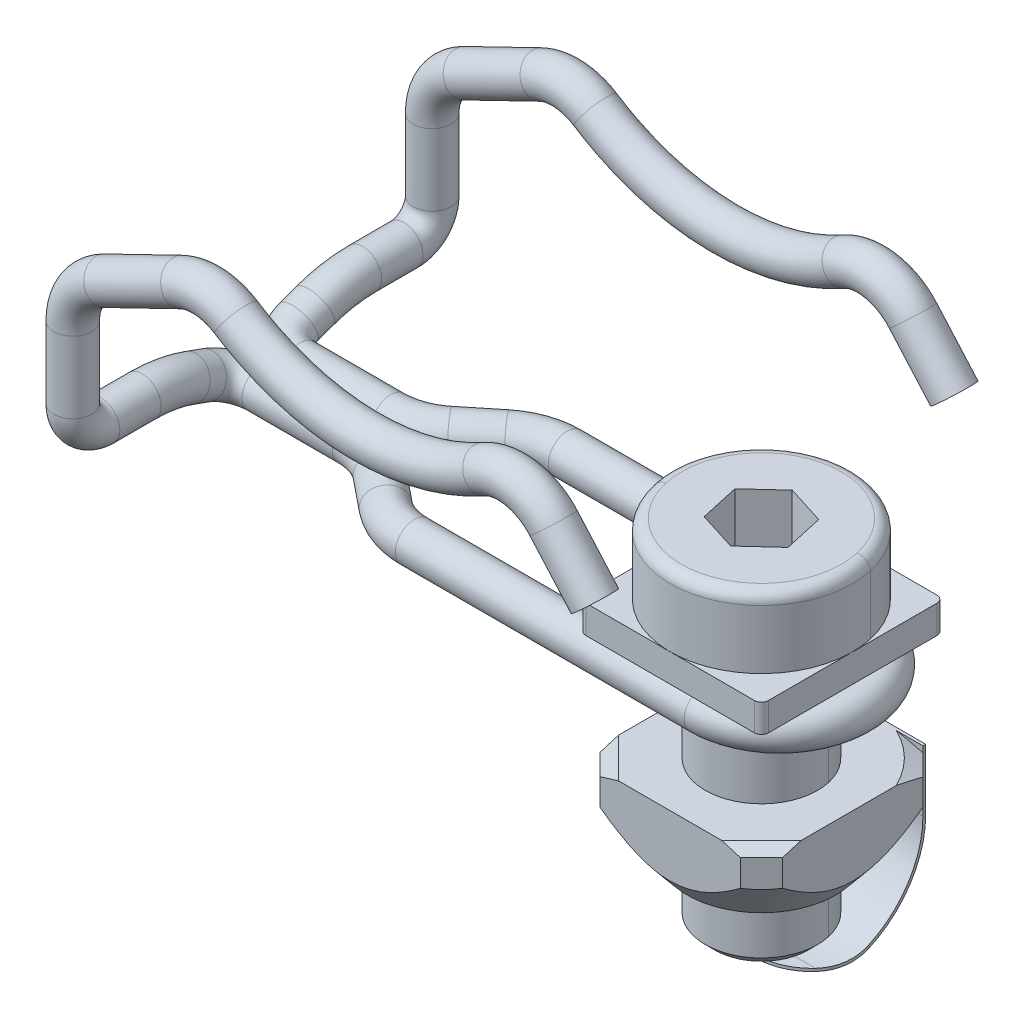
ISO-10303-21;
HEADER;
FILE_DESCRIPTION(('STEP AP214'),'2;1');
FILE_NAME('part.step','',(''),(''),'','','');
FILE_SCHEMA(('AUTOMOTIVE_DESIGN { 1 0 10303 214 1 1 1 1 }'));
ENDSEC;
DATA;
#1=APPLICATION_CONTEXT('core data for automotive mechanical design processes');
#2=APPLICATION_PROTOCOL_DEFINITION('international standard','automotive_design',2000,#1);
#3=PRODUCT_CONTEXT('',#1,'mechanical');
#4=PRODUCT('Part','Part','',(#3));
#5=PRODUCT_RELATED_PRODUCT_CATEGORY('part','',(#4));
#6=PRODUCT_DEFINITION_FORMATION('','',#4);
#7=PRODUCT_DEFINITION_CONTEXT('part definition',#1,'design');
#8=PRODUCT_DEFINITION('design','',#6,#7);
#9=PRODUCT_DEFINITION_SHAPE('','',#8);
#10=(LENGTH_UNIT() NAMED_UNIT(*) SI_UNIT(.MILLI.,.METRE.));
#11=(NAMED_UNIT(*) PLANE_ANGLE_UNIT() SI_UNIT($,.RADIAN.));
#12=(NAMED_UNIT(*) SI_UNIT($,.STERADIAN.) SOLID_ANGLE_UNIT());
#13=UNCERTAINTY_MEASURE_WITH_UNIT(LENGTH_MEASURE(1.E-05),#10,'distance_accuracy_value','');
#14=(GEOMETRIC_REPRESENTATION_CONTEXT(3) GLOBAL_UNCERTAINTY_ASSIGNED_CONTEXT((#13)) GLOBAL_UNIT_ASSIGNED_CONTEXT((#10,
#11,#12)) REPRESENTATION_CONTEXT('',''));
#15=CARTESIAN_POINT('',(0.,0.,0.));
#16=DIRECTION('',(0.,0.,1.));
#17=DIRECTION('',(1.,0.,0.));
#18=AXIS2_PLACEMENT_3D('',#15,#16,#17);
#19=CARTESIAN_POINT('',(1.99999999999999,-6.45,-21.25));
#20=DIRECTION('',(0.,0.,1.));
#21=DIRECTION('',(-1.,0.,0.));
#22=AXIS2_PLACEMENT_3D('',#19,#20,#21);
#23=PLANE('',#22);
#24=DIRECTION('',(0.,1.,0.));
#25=VECTOR('',#24,1.);
#26=CARTESIAN_POINT('',(-3.00000000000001,-6.45,-21.25));
#27=LINE('',#26,#25);
#28=CARTESIAN_POINT('',(-3.00000000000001,-10.7968093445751,-21.25));
#29=VERTEX_POINT('',#28);
#30=CARTESIAN_POINT('',(-3.00000000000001,-8.73738420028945,-21.25));
#31=VERTEX_POINT('',#30);
#32=EDGE_CURVE('P0_E212',#29,#31,#27,.T.);
#33=ORIENTED_EDGE('',*,*,#32,.F.);
#34=DIRECTION('',(-1.,0.,0.));
#35=VECTOR('',#34,1.);
#36=CARTESIAN_POINT('',(1.99999999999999,-10.7968093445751,-21.25));
#37=LINE('',#36,#35);
#38=CARTESIAN_POINT('',(1.99999999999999,-10.7968093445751,-21.25));
#39=VERTEX_POINT('',#38);
#40=EDGE_CURVE('P0_E777',#29,#39,#37,.F.);
#41=ORIENTED_EDGE('',*,*,#40,.T.);
#42=CARTESIAN_POINT('',(-3.00000000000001,-8.73738420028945,-21.25));
#43=CARTESIAN_POINT('',(-2.89368788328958,-8.81587308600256,-21.25));
#44=CARTESIAN_POINT('',(-2.78663225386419,-8.89335343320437,-21.25));
#45=CARTESIAN_POINT('',(-2.57085834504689,-9.04600839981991,-21.25));
#46=CARTESIAN_POINT('',(-2.46213973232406,-9.12118254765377,-21.25));
#47=CARTESIAN_POINT('',(-2.13250736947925,-9.34329329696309,-21.25));
#48=CARTESIAN_POINT('',(-1.9088750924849,-9.48625250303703,-21.25));
#49=CARTESIAN_POINT('',(-1.44568000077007,-9.76266876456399,-21.25));
#50=CARTESIAN_POINT('',(-1.20583507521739,-9.89565754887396,-21.25));
#51=CARTESIAN_POINT('',(-0.716203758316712,-10.1414411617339,-21.25));
#52=CARTESIAN_POINT('',(-0.466431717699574,-10.2542639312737,-21.25));
#53=CARTESIAN_POINT('',(-0.0340360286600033,-10.4229098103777,-21.25));
#54=CARTESIAN_POINT('',(0.145885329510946,-10.4856297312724,-21.25));
#55=CARTESIAN_POINT('',(0.510467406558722,-10.5956017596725,-21.25));
#56=CARTESIAN_POINT('',(0.695128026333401,-10.6428541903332,-21.25));
#57=CARTESIAN_POINT('',(1.06553580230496,-10.7189078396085,-21.25));
#58=CARTESIAN_POINT('',(1.25123045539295,-10.747961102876,-21.25));
#59=CARTESIAN_POINT('',(1.62462196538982,-10.786907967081,-21.25));
#60=CARTESIAN_POINT('',(1.81231836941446,-10.7968058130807,-21.25));
#61=CARTESIAN_POINT('',(2.16789095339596,-10.79681250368,-21.25));
#62=CARTESIAN_POINT('',(2.33577008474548,-10.7888980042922,-21.25));
#63=CARTESIAN_POINT('',(2.67007787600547,-10.757668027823,-21.25));
#64=CARTESIAN_POINT('',(2.83650649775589,-10.7343521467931,-21.25));
#65=CARTESIAN_POINT('',(3.16887615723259,-10.6730573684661,-21.25));
#66=CARTESIAN_POINT('',(3.3347818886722,-10.6348893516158,-21.25));
#67=CARTESIAN_POINT('',(3.66300327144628,-10.5455797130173,-21.25));
#68=CARTESIAN_POINT('',(3.82531904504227,-10.4944385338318,-21.25));
#69=CARTESIAN_POINT('',(4.26278520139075,-10.339667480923,-21.25));
#70=CARTESIAN_POINT('',(4.53401026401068,-10.2249377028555,-21.25));
#71=CARTESIAN_POINT('',(5.06495183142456,-9.97065441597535,-21.25));
#72=CARTESIAN_POINT('',(5.32464184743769,-9.83104712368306,-21.25));
#73=CARTESIAN_POINT('',(5.70222068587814,-9.61048573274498,-21.25));
#74=CARTESIAN_POINT('',(5.8242009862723,-9.53639312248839,-21.25));
#75=CARTESIAN_POINT('',(6.06587782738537,-9.38454605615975,-21.25));
#76=CARTESIAN_POINT('',(6.18557421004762,-9.30679134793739,-21.25));
#77=CARTESIAN_POINT('',(6.42223945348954,-9.1485571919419,-21.25));
#78=CARTESIAN_POINT('',(6.53921928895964,-9.06809408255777,-21.25));
#79=CARTESIAN_POINT('',(6.77124208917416,-8.90448404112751,-21.25));
#80=CARTESIAN_POINT('',(6.88628556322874,-8.82133783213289,-21.25));
#81=CARTESIAN_POINT('',(7.00046680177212,-8.73703952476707,-21.25));
#82=B_SPLINE_CURVE_WITH_KNOTS('',3,(#42,#43,#44,#45,#46,#47,#48,#49,#50,#51,#52,#53,#54,#55,#56,
#57,#58,#59,#60,#61,#62,#63,#64,#65,#66,#67,#68,#69,#70,#71,#72,#73,#74,#75,#76,#77,#78,#79,#80,
#81),.UNSPECIFIED.,.F.,.F.,(4,2,2,2,2,2,2,2,2,2,2,2,2,2,2,2,2,2,2,4),(0.,0.396428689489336,
0.792937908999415,1.58879123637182,2.41086642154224,3.23179359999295,3.80284462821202,
4.37388372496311,4.93682857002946,5.49964864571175,6.00312039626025,6.50660535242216,
7.0167230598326,7.52682336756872,8.40845898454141,9.29202428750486,9.72013309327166,
10.148271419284,10.574175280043,10.9999653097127),.UNSPECIFIED.);
#83=EDGE_CURVE('P0_E724',#31,#39,#82,.T.);
#84=ORIENTED_EDGE('',*,*,#83,.F.);
#85=EDGE_LOOP('',(#33,#41,#84));
#86=FACE_BOUND('',#85,.T.);
#87=ADVANCED_FACE('P0_F23',(#86),#23,.T.);
#88=CARTESIAN_POINT('',(7.00007437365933,-8.73721411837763,-21.2500000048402));
#89=VERTEX_POINT('',#88);
#90=EDGE_CURVE('P0_E710',#39,#89,#82,.T.);
#91=ORIENTED_EDGE('',*,*,#90,.F.);
#92=DIRECTION('',(-1.,0.,0.));
#93=VECTOR('',#92,1.);
#94=CARTESIAN_POINT('',(1.99999999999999,-10.7968093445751,-21.25));
#95=LINE('',#94,#93);
#96=CARTESIAN_POINT('',(6.99999999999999,-10.7968093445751,-21.25));
#97=VERTEX_POINT('',#96);
#98=EDGE_CURVE('P0_E776',#39,#97,#95,.F.);
#99=ORIENTED_EDGE('',*,*,#98,.T.);
#100=DIRECTION('',(0.,-1.,0.));
#101=VECTOR('',#100,1.);
#102=CARTESIAN_POINT('',(6.99999999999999,-17.5968093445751,-21.25));
#103=LINE('',#102,#101);
#104=EDGE_CURVE('P0_E221',#89,#97,#103,.T.);
#105=ORIENTED_EDGE('',*,*,#104,.F.);
#106=EDGE_LOOP('',(#91,#99,#105));
#107=FACE_BOUND('',#106,.T.);
#108=ADVANCED_FACE('P0_F487',(#107),#23,.T.);
#109=CARTESIAN_POINT('',(8.49999999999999,-12.25,-21.25));
#110=DIRECTION('',(0.,0.,1.));
#111=DIRECTION('',(-1.,0.,0.));
#112=AXIS2_PLACEMENT_3D('',#109,#110,#111);
#113=PLANE('',#112);
#114=DIRECTION('',(0.,-1.,0.));
#115=VECTOR('',#114,1.);
#116=CARTESIAN_POINT('',(-3.00093362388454,-43.5974583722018,-21.25));
#117=LINE('',#116,#115);
#118=CARTESIAN_POINT('',(-3.00093362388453,-6.84999999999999,-21.25));
#119=VERTEX_POINT('',#118);
#120=CARTESIAN_POINT('',(-3.00093362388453,-8.73669481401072,-21.25));
#121=VERTEX_POINT('',#120);
#122=EDGE_CURVE('P0_E573',#119,#121,#117,.T.);
#123=ORIENTED_EDGE('',*,*,#122,.F.);
#124=DIRECTION('',(-0.956938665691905,-0.290290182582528,0.));
#125=VECTOR('',#124,1.);
#126=CARTESIAN_POINT('',(-2.97244888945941,-6.84135907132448,-21.25));
#127=LINE('',#126,#125);
#128=CARTESIAN_POINT('',(-3.00000000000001,-6.84971678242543,-21.25));
#129=VERTEX_POINT('',#128);
#130=EDGE_CURVE('P0_E568',#119,#129,#127,.F.);
#131=ORIENTED_EDGE('',*,*,#130,.T.);
#132=EDGE_CURVE('P0_E216',#31,#129,#27,.T.);
#133=ORIENTED_EDGE('',*,*,#132,.F.);
#134=CARTESIAN_POINT('',(-3.00093362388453,-8.73669481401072,-21.25));
#135=CARTESIAN_POINT('',(-3.00089472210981,-8.73672353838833,-21.2500000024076));
#136=CARTESIAN_POINT('',(-3.00085582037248,-8.73675226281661,-21.2500000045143));
#137=CARTESIAN_POINT('',(-3.00077801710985,-8.73680971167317,-21.2500000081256));
#138=CARTESIAN_POINT('',(-3.00073911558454,-8.73683843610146,-21.2500000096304));
#139=CARTESIAN_POINT('',(-3.00066131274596,-8.73689588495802,-21.250000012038));
#140=CARTESIAN_POINT('',(-3.00062241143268,-8.7369246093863,-21.2500000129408));
#141=CARTESIAN_POINT('',(-3.00054460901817,-8.73698205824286,-21.2500000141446));
#142=CARTESIAN_POINT('',(-3.00050570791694,-8.73701078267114,-21.2500000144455));
#143=CARTESIAN_POINT('',(-3.00042790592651,-8.7370682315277,-21.2500000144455));
#144=CARTESIAN_POINT('',(-3.00038900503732,-8.73709695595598,-21.2500000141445));
#145=CARTESIAN_POINT('',(-3.00031120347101,-8.73715440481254,-21.2500000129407));
#146=CARTESIAN_POINT('',(-3.00027230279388,-8.73718312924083,-21.2500000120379));
#147=CARTESIAN_POINT('',(-3.00019450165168,-8.73724057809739,-21.2500000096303));
#148=CARTESIAN_POINT('',(-3.00015560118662,-8.73726930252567,-21.2500000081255));
#149=CARTESIAN_POINT('',(-3.00007780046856,-8.73732675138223,-21.2500000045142));
#150=CARTESIAN_POINT('',(-3.00003890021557,-8.73735547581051,-21.2500000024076));
#151=CARTESIAN_POINT('',(-3.00000000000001,-8.73738420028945,-21.25));
#152=B_SPLINE_CURVE_WITH_KNOTS('',3,(#134,#135,#136,#137,#138,#139,#140,#141,#142,#143,#144,
#145,#146,#147,#148,#149,#150,#151),.UNSPECIFIED.,.F.,.F.,(4,2,2,2,2,2,2,2,4),(0.,
0.000145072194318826,0.000290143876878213,0.000435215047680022,0.000580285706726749,
0.000725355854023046,0.000870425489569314,0.00101549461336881,0.00116056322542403),.UNSPECIFIED.);
#153=EDGE_CURVE('P0_E200',#121,#31,#152,.T.);
#154=ORIENTED_EDGE('',*,*,#153,.F.);
#155=EDGE_LOOP('',(#123,#131,#133,#154));
#156=FACE_BOUND('',#155,.T.);
#157=ADVANCED_FACE('P0_F484',(#156),#113,.F.);
#158=CARTESIAN_POINT('',(1.99999999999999,-12.25,-14.75));
#159=DIRECTION('',(0.,1.,0.));
#160=DIRECTION('',(0.,0.,-1.));
#161=AXIS2_PLACEMENT_3D('',#158,#159,#160);
#162=PLANE('',#161);
#163=CARTESIAN_POINT('',(1.99999999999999,-12.25,-14.75));
#164=DIRECTION('',(0.,1.,0.));
#165=DIRECTION('',(0.,0.,-1.));
#166=AXIS2_PLACEMENT_3D('',#163,#164,#165);
#167=CIRCLE('',#166,4.02500000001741);
#168=CARTESIAN_POINT('',(1.99999999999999,-12.25,-18.7750000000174));
#169=VERTEX_POINT('',#168);
#170=EDGE_CURVE('P0_E557',#169,#169,#167,.T.);
#171=ORIENTED_EDGE('',*,*,#170,.T.);
#172=EDGE_LOOP('',(#171));
#173=FACE_BOUND('',#172,.T.);
#174=CARTESIAN_POINT('',(1.99999999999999,-12.25,-14.75));
#175=DIRECTION('',(0.,1.,0.));
#176=DIRECTION('',(0.,0.,-1.));
#177=AXIS2_PLACEMENT_3D('',#174,#175,#176);
#178=CIRCLE('',#177,5.3);
#179=CARTESIAN_POINT('',(1.99999999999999,-12.25,-20.05));
#180=VERTEX_POINT('',#179);
#181=EDGE_CURVE('P0_E706',#180,#180,#178,.T.);
#182=ORIENTED_EDGE('',*,*,#181,.F.);
#183=EDGE_LOOP('',(#182));
#184=FACE_BOUND('',#183,.T.);
#185=ADVANCED_FACE('P0_F256',(#173,#184),#162,.F.);
#186=CARTESIAN_POINT('',(-3.00093362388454,-43.5974583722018,-21.25));
#187=DIRECTION('',(-0.707106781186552,0.,-0.707106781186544));
#188=DIRECTION('',(0.707106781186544,0.,-0.707106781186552));
#189=AXIS2_PLACEMENT_3D('',#186,#187,#188);
#190=PLANE('',#189);
#191=DIRECTION('',(0.,-1.,0.));
#192=VECTOR('',#191,1.);
#193=CARTESIAN_POINT('',(-4.50000000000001,-12.25,-19.7509336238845));
#194=LINE('',#193,#192);
#195=CARTESIAN_POINT('',(-4.50000001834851,-8.73669481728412,-19.7509335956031));
#196=VERTEX_POINT('',#195);
#197=CARTESIAN_POINT('',(-4.50000000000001,-6.84999999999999,-19.7509336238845));
#198=VERTEX_POINT('',#197);
#199=EDGE_CURVE('P0_E699',#196,#198,#194,.F.);
#200=ORIENTED_EDGE('',*,*,#199,.T.);
#201=DIRECTION('',(0.707106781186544,0.,-0.707106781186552));
#202=VECTOR('',#201,1.);
#203=CARTESIAN_POINT('',(-3.00093362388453,-6.84999999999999,-21.25));
#204=LINE('',#203,#202);
#205=EDGE_CURVE('P0_E570',#198,#119,#204,.T.);
#206=ORIENTED_EDGE('',*,*,#205,.T.);
#207=ORIENTED_EDGE('',*,*,#122,.T.);
#208=CARTESIAN_POINT('',(-4.50000003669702,-8.73669480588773,-19.7509335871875));
#209=CARTESIAN_POINT('',(-4.43784742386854,-8.75045539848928,-19.813086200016));
#210=CARTESIAN_POINT('',(-4.37551621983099,-8.7625664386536,-19.8754174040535));
#211=CARTESIAN_POINT('',(-4.25056780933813,-8.7834008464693,-20.0003658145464));
#212=CARTESIAN_POINT('',(-4.18795058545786,-8.79212400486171,-20.0629830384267));
#213=CARTESIAN_POINT('',(-4.00058150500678,-8.81298820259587,-20.2503521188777));
#214=CARTESIAN_POINT('',(-3.8755241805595,-8.81999999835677,-20.375409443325));
#215=CARTESIAN_POINT('',(-3.62540953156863,-8.82000000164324,-20.6255240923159));
#216=CARTESIAN_POINT('',(-3.50035220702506,-8.81298820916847,-20.7505814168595));
#217=CARTESIAN_POINT('',(-3.31298312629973,-8.79212401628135,-20.9379504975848));
#218=CARTESIAN_POINT('',(-3.25036590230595,-8.78340085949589,-21.0005677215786));
#219=CARTESIAN_POINT('',(-3.12541749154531,-8.76256645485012,-21.1255161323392));
#220=CARTESIAN_POINT('',(-3.06308628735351,-8.75045541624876,-21.187847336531));
#221=CARTESIAN_POINT('',(-3.00093367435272,-8.73669482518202,-21.2499999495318));
#222=B_SPLINE_CURVE_WITH_KNOTS('',3,(#208,#209,#210,#211,#212,#213,#214,#215,#216,#217,#218,
#219,#220,#221),.UNSPECIFIED.,.F.,.F.,(4,2,2,2,2,2,4),(0.,0.266874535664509,0.53376555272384,
1.06417199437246,1.59457843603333,1.86146945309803,2.12834398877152),.UNSPECIFIED.);
#223=EDGE_CURVE('P0_E354',#196,#121,#222,.T.);
#224=ORIENTED_EDGE('',*,*,#223,.F.);
#225=EDGE_LOOP('',(#200,#206,#207,#224));
#226=FACE_BOUND('',#225,.T.);
#227=ADVANCED_FACE('P0_F490',(#226),#190,.T.);
#228=CARTESIAN_POINT('',(8.50000000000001,-36.3474583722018,-19.7509336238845));
#229=DIRECTION('',(0.707106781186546,0.,-0.707106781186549));
#230=DIRECTION('',(0.707106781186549,0.,0.707106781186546));
#231=AXIS2_PLACEMENT_3D('',#228,#229,#230);
#232=PLANE('',#231);
#233=DIRECTION('',(0.,-1.,0.));
#234=VECTOR('',#233,1.);
#235=CARTESIAN_POINT('',(8.49999999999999,-12.25,-19.7509336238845));
#236=LINE('',#235,#234);
#237=CARTESIAN_POINT('',(8.50000003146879,-6.87951167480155,-19.7509335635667));
#238=VERTEX_POINT('',#237);
#239=CARTESIAN_POINT('',(8.4999999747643,-8.73669481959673,-19.7509336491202));
#240=VERTEX_POINT('',#239);
#241=EDGE_CURVE('P0_E289',#238,#240,#236,.T.);
#242=ORIENTED_EDGE('',*,*,#241,.T.);
#243=CARTESIAN_POINT('',(7.00074302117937,-8.73665261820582,-21.2501906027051));
#244=CARTESIAN_POINT('',(7.06290327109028,-8.75041834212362,-21.1880303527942));
#245=CARTESIAN_POINT('',(7.12524219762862,-8.76253414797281,-21.1256914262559));
#246=CARTESIAN_POINT('',(7.25020620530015,-8.78337729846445,-21.0007274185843));
#247=CARTESIAN_POINT('',(7.3128313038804,-8.79210443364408,-20.9381023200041));
#248=CARTESIAN_POINT('',(7.50022389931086,-8.81297922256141,-20.7507097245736));
#249=CARTESIAN_POINT('',(7.62529704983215,-8.81999640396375,-20.6256365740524));
#250=CARTESIAN_POINT('',(7.87544356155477,-8.82000359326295,-20.3754900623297));
#251=CARTESIAN_POINT('',(8.00051692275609,-8.81299360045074,-20.2504167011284));
#252=CARTESIAN_POINT('',(8.18791011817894,-8.79212941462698,-20.0630235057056));
#253=CARTESIAN_POINT('',(8.25053546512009,-8.78340579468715,-20.0003981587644));
#254=CARTESIAN_POINT('',(8.37550005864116,-8.76256957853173,-19.8754335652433));
#255=CARTESIAN_POINT('',(8.43783932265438,-8.75045719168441,-19.8130943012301));
#256=CARTESIAN_POINT('',(8.4999999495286,-8.73669482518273,-19.7509336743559));
#257=B_SPLINE_CURVE_WITH_KNOTS('',3,(#243,#244,#245,#246,#247,#248,#249,#250,#251,#252,#253,
#254,#255,#256),.UNSPECIFIED.,.F.,.F.,(4,2,2,2,2,2,4),(0.,0.266908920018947,0.533834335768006,
1.06430829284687,1.59478227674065,1.8617077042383,2.12861664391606),.UNSPECIFIED.);
#258=EDGE_CURVE('P0_E756',#89,#240,#257,.T.);
#259=ORIENTED_EDGE('',*,*,#258,.F.);
#260=CARTESIAN_POINT('',(6.99999999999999,-6.879311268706,-21.25));
#261=DIRECTION('',(0.,-1.,0.));
#262=VECTOR('',#261,1.);
#263=LINE('',#260,#262);
#264=CARTESIAN_POINT('',(7.00010158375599,-6.87933317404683,-21.2499999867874));
#265=VERTEX_POINT('',#264);
#266=EDGE_CURVE('P0_E231',#265,#89,#263,.T.);
#267=ORIENTED_EDGE('',*,*,#266,.F.);
#268=CARTESIAN_POINT('',(8.50000006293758,-6.87951168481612,-19.7509335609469));
#269=CARTESIAN_POINT('',(8.37513912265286,-6.86970791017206,-19.8757945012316));
#270=CARTESIAN_POINT('',(8.2501816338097,-6.86232731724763,-20.0007519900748));
#271=CARTESIAN_POINT('',(8.00026695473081,-6.8524745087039,-20.2506666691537));
#272=CARTESIAN_POINT('',(7.87530983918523,-6.8499984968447,-20.3756237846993));
#273=CARTESIAN_POINT('',(7.62539563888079,-6.85000150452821,-20.6255379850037));
#274=CARTESIAN_POINT('',(7.50043855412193,-6.85248052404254,-20.7504950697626));
#275=CARTESIAN_POINT('',(7.25052399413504,-6.86233930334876,-21.0004096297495));
#276=CARTESIAN_POINT('',(7.12556659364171,-6.86972285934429,-21.1253670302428));
#277=CARTESIAN_POINT('',(7.00070576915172,-6.87952955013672,-21.2502278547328));
#278=B_SPLINE_CURVE_WITH_KNOTS('',3,(#268,#269,#270,#271,#272,#273,#274,#275,#276,#277),
.UNSPECIFIED.,.F.,.F.,(4,2,2,2,4),(0.,0.530542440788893,1.06067407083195,1.59080569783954,
2.12134813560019),.UNSPECIFIED.);
#279=EDGE_CURVE('P0_E677',#238,#265,#278,.T.);
#280=ORIENTED_EDGE('',*,*,#279,.F.);
#281=EDGE_LOOP('',(#242,#259,#267,#280));
#282=FACE_BOUND('',#281,.T.);
#283=ADVANCED_FACE('P0_F307',(#282),#232,.T.);
#284=CARTESIAN_POINT('',(1.99999999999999,-8.71561498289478,-14.75));
#285=DIRECTION('',(0.,1.,0.));
#286=DIRECTION('',(0.,0.,-1.));
#287=AXIS2_PLACEMENT_3D('',#284,#285,#286);
#288=CONICAL_SURFACE('',#287,8.218586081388,0.690257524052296);
#289=ORIENTED_EDGE('',*,*,#181,.T.);
#290=EDGE_LOOP('',(#289));
#291=FACE_BOUND('',#290,.T.);
#292=CARTESIAN_POINT('',(8.49999999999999,-8.73669479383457,-19.7509336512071));
#293=CARTESIAN_POINT('',(8.5,-8.81546799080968,-19.6442488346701));
#294=CARTESIAN_POINT('',(8.5,-8.89322583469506,-19.5368156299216));
#295=CARTESIAN_POINT('',(8.5,-9.04641962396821,-19.3202740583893));
#296=CARTESIAN_POINT('',(8.5,-9.12185507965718,-19.2111653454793));
#297=CARTESIAN_POINT('',(8.5,-9.34474506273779,-18.8803046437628));
#298=CARTESIAN_POINT('',(8.5,-9.48819049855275,-18.655812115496));
#299=CARTESIAN_POINT('',(8.5,-9.76448397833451,-18.1924455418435));
#300=CARTESIAN_POINT('',(8.5,-9.896963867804,-17.9533500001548));
#301=CARTESIAN_POINT('',(8.5,-10.1418297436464,-17.4653118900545));
#302=CARTESIAN_POINT('',(8.5,-10.2542468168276,-17.2163852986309));
#303=CARTESIAN_POINT('',(8.5,-10.4140310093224,-16.8068555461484));
#304=CARTESIAN_POINT('',(8.5,-10.4697060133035,-16.6494940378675));
#305=CARTESIAN_POINT('',(8.5,-10.5694311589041,-16.3310756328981));
#306=CARTESIAN_POINT('',(8.5,-10.613480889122,-16.1700186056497));
#307=CARTESIAN_POINT('',(8.5,-10.6879512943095,-15.8462208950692));
#308=CARTESIAN_POINT('',(8.5,-10.718486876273,-15.6835069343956));
#309=CARTESIAN_POINT('',(8.5,-10.7651244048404,-15.3560094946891));
#310=CARTESIAN_POINT('',(8.5,-10.781227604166,-15.1912261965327));
#311=CARTESIAN_POINT('',(8.5,-10.7982728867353,-14.8594601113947));
#312=CARTESIAN_POINT('',(8.5,-10.7990849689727,-14.6924705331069));
#313=CARTESIAN_POINT('',(8.5,-10.7851724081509,-14.3591467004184));
#314=CARTESIAN_POINT('',(8.5,-10.7704473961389,-14.1928124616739));
#315=CARTESIAN_POINT('',(8.5,-10.7261293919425,-13.8615349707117));
#316=CARTESIAN_POINT('',(8.5,-10.6964815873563,-13.6965991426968));
#317=CARTESIAN_POINT('',(8.5,-10.6236585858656,-13.3697652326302));
#318=CARTESIAN_POINT('',(8.5,-10.5804814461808,-13.2078675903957));
#319=CARTESIAN_POINT('',(8.5,-10.4593959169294,-12.8131797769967));
#320=CARTESIAN_POINT('',(8.5,-10.3746768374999,-12.5824801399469));
#321=CARTESIAN_POINT('',(8.5,-10.1851156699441,-12.1295085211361));
#322=CARTESIAN_POINT('',(8.5,-10.0802589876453,-11.907242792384));
#323=CARTESIAN_POINT('',(8.5,-9.85489593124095,-11.4704401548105));
#324=CARTESIAN_POINT('',(8.5,-9.73436490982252,-11.2559161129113));
#325=CARTESIAN_POINT('',(8.5,-9.48143738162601,-10.8341478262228));
#326=CARTESIAN_POINT('',(8.5,-9.34904496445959,-10.6269011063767));
#327=CARTESIAN_POINT('',(8.5,-9.13538390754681,-10.3085285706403));
#328=CARTESIAN_POINT('',(8.5,-9.05727223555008,-10.1952592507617));
#329=CARTESIAN_POINT('',(8.5,-8.89869998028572,-9.97074838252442));
#330=CARTESIAN_POINT('',(8.5,-8.818244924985,-9.8595029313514));
#331=CARTESIAN_POINT('',(8.5,-8.6186282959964,-9.58917867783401));
#332=CARTESIAN_POINT('',(8.5,-8.49826647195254,-9.43098647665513));
#333=CARTESIAN_POINT('',(8.5,-8.25373098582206,-9.11757107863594));
#334=CARTESIAN_POINT('',(8.5,-8.12955704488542,-8.96234810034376));
#335=CARTESIAN_POINT('',(8.5,-7.75215867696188,-8.50041509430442));
#336=CARTESIAN_POINT('',(8.5,-7.49417008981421,-8.19759073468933));
#337=CARTESIAN_POINT('',(8.5,-7.09944222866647,-7.74830757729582));
#338=CARTESIAN_POINT('',(8.5,-6.96607936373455,-7.59884109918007));
#339=CARTESIAN_POINT('',(8.5,-6.69735296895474,-7.30170765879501));
#340=CARTESIAN_POINT('',(8.5,-6.56198940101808,-7.15404073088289));
#341=CARTESIAN_POINT('',(8.5,-6.28972451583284,-6.86049255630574));
#342=CARTESIAN_POINT('',(8.5,-6.15282542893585,-6.71460923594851));
#343=CARTESIAN_POINT('',(8.5,-5.87753909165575,-6.42426951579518));
#344=CARTESIAN_POINT('',(8.5,-5.73915193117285,-6.27981303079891));
#345=CARTESIAN_POINT('',(8.5,-5.60012368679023,-6.13597947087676));
#346=B_SPLINE_CURVE_WITH_KNOTS('',3,(#292,#293,#294,#295,#296,#297,#298,#299,#300,#301,#302,
#303,#304,#305,#306,#307,#308,#309,#310,#311,#312,#313,#314,#315,#316,#317,#318,#319,#320,#321,
#322,#323,#324,#325,#326,#327,#328,#329,#330,#331,#332,#333,#334,#335,#336,#337,#338,#339,#340,
#341,#342,#343,#344,#345),.UNSPECIFIED.,.F.,.F.,(4,2,2,2,2,2,2,2,2,2,2,2,2,2,2,2,2,2,2,2,2,2,2,
2,2,2,4),(0.,0.39783429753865,0.795751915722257,1.59455698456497,2.41393831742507,
3.23203880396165,3.73242986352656,4.23283862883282,4.72890673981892,5.22493178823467,
5.72517202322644,6.22542413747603,6.72752726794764,7.22970253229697,7.96569928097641,
8.70223144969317,9.43993611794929,10.1773874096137,10.5901317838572,11.0019708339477,
11.5982226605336,12.1945182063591,13.3876704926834,13.9886053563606,14.5895516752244,
15.18971596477,15.7898441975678),.UNSPECIFIED.);
#347=CARTESIAN_POINT('',(8.5,-8.73669481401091,-9.74906637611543));
#348=VERTEX_POINT('',#347);
#349=EDGE_CURVE('P0_E278',#240,#348,#346,.T.);
#350=ORIENTED_EDGE('',*,*,#349,.T.);
#351=CARTESIAN_POINT('',(8.5,-8.73669481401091,-9.74906637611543));
#352=CARTESIAN_POINT('',(8.43784738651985,-8.75045540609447,-9.68691376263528));
#353=CARTESIAN_POINT('',(8.37551618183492,-8.76256644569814,-9.62458255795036));
#354=CARTESIAN_POINT('',(8.25056777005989,-8.78340085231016,-9.49963414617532));
#355=CARTESIAN_POINT('',(8.18795054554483,-8.79212401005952,-9.43701692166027));
#356=CARTESIAN_POINT('',(8.00058146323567,-8.81298820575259,-9.24964783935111));
#357=CARTESIAN_POINT('',(7.87552413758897,-8.81999999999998,-9.12459051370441));
#358=CARTESIAN_POINT('',(7.62540948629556,-8.81999999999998,-8.87447586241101));
#359=CARTESIAN_POINT('',(7.50035216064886,-8.81298820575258,-8.7494185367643));
#360=CARTESIAN_POINT('',(7.31298307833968,-8.79212401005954,-8.56204945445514));
#361=CARTESIAN_POINT('',(7.25036585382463,-8.78340085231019,-8.49943222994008));
#362=CARTESIAN_POINT('',(7.12541744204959,-8.76256644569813,-8.37448381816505));
#363=CARTESIAN_POINT('',(7.06308623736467,-8.7504554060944,-8.31215261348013));
#364=CARTESIAN_POINT('',(7.00093362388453,-8.73669481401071,-8.24999999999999));
#365=B_SPLINE_CURVE_WITH_KNOTS('',3,(#351,#352,#353,#354,#355,#356,#357,#358,#359,#360,#361,
#362,#363,#364),.UNSPECIFIED.,.F.,.F.,(4,2,2,2,2,2,4),(0.,0.266874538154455,0.533765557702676,
1.06417200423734,1.59457845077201,1.86146947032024,2.1283440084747),.UNSPECIFIED.);
#366=CARTESIAN_POINT('',(7.00093362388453,-8.73669481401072,-8.24999999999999));
#367=VERTEX_POINT('',#366);
#368=EDGE_CURVE('P0_E389',#348,#367,#365,.T.);
#369=ORIENTED_EDGE('',*,*,#368,.T.);
#370=CARTESIAN_POINT('',(10.6140205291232,-5.60012368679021,-8.24999999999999));
#371=CARTESIAN_POINT('',(10.4722623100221,-5.73714642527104,-8.24999999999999));
#372=CARTESIAN_POINT('',(10.3298987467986,-5.87354603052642,-8.24999999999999));
#373=CARTESIAN_POINT('',(10.0437917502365,-6.14489938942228,-8.24999999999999));
#374=CARTESIAN_POINT('',(9.90004827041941,-6.27985309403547,-8.24999999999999));
#375=CARTESIAN_POINT('',(9.61084855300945,-6.54826658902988,-8.24999999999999));
#376=CARTESIAN_POINT('',(9.46539046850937,-6.68172439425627,-8.24999999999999));
#377=CARTESIAN_POINT('',(9.17273247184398,-6.94671249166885,-8.24999999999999));
#378=CARTESIAN_POINT('',(9.02553255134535,-7.07824277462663,-8.24999999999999));
#379=CARTESIAN_POINT('',(8.57444721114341,-7.47526866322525,-8.24999999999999));
#380=CARTESIAN_POINT('',(8.26743023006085,-7.73725550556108,-8.24999999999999));
#381=CARTESIAN_POINT('',(7.79899801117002,-8.12043781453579,-8.24999999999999));
#382=CARTESIAN_POINT('',(7.64156685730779,-8.24650919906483,-8.24999999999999));
#383=CARTESIAN_POINT('',(7.32365214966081,-8.49473565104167,-8.24999999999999));
#384=CARTESIAN_POINT('',(7.16316873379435,-8.61689089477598,-8.24999999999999));
#385=CARTESIAN_POINT('',(6.78373694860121,-8.89708557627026,-8.24999999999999));
#386=CARTESIAN_POINT('',(6.56340066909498,-9.0532620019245,-8.24999999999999));
#387=CARTESIAN_POINT('',(6.11532472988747,-9.35454167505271,-8.24999999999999));
#388=CARTESIAN_POINT('',(5.88758709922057,-9.49964792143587,-8.24999999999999));
#389=CARTESIAN_POINT('',(5.42424354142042,-9.77469164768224,-8.24999999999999));
#390=CARTESIAN_POINT('',(5.18867386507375,-9.90468911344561,-8.24999999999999));
#391=CARTESIAN_POINT('',(4.82809088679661,-10.0850516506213,-8.24999999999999));
#392=CARTESIAN_POINT('',(4.70672258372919,-10.1427211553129,-8.24999999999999));
#393=CARTESIAN_POINT('',(4.46142254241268,-10.252464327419,-8.24999999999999));
#394=CARTESIAN_POINT('',(4.33748992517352,-10.3045360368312,-8.24999999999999));
#395=CARTESIAN_POINT('',(4.0356795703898,-10.4222948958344,-8.24999999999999));
#396=CARTESIAN_POINT('',(3.85653757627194,-10.4847988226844,-8.24999999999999));
#397=CARTESIAN_POINT('',(3.49366314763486,-10.5944539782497,-8.24999999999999));
#398=CARTESIAN_POINT('',(3.30993324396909,-10.6416134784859,-8.24999999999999));
#399=CARTESIAN_POINT('',(2.93950727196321,-10.7180665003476,-8.24999999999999));
#400=CARTESIAN_POINT('',(2.7528261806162,-10.7474314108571,-8.24999999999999));
#401=CARTESIAN_POINT('',(2.37742483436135,-10.7867991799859,-8.24999999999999));
#402=CARTESIAN_POINT('',(2.18870497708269,-10.796805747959,-8.24999999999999));
#403=CARTESIAN_POINT('',(1.83126179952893,-10.7968125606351,-8.24999999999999));
#404=CARTESIAN_POINT('',(1.66253549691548,-10.7888176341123,-8.24999999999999));
#405=CARTESIAN_POINT('',(1.32656204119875,-10.7572750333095,-8.24999999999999));
#406=CARTESIAN_POINT('',(1.15931486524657,-10.7337275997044,-8.24999999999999));
#407=CARTESIAN_POINT('',(0.827016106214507,-10.6721487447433,-8.24999999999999));
#408=CARTESIAN_POINT('',(0.66197276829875,-10.6340733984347,-8.24999999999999));
#409=CARTESIAN_POINT('',(0.33541438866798,-10.5450809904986,-8.24999999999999));
#410=CARTESIAN_POINT('',(0.173899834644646,-10.4941621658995,-8.24999999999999));
#411=CARTESIAN_POINT('',(-0.257410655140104,-10.3415689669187,-8.24999999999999));
#412=CARTESIAN_POINT('',(-0.523490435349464,-10.2293807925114,-8.24999999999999));
#413=CARTESIAN_POINT('',(-1.04427039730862,-9.98112224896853,-8.24999999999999));
#414=CARTESIAN_POINT('',(-1.29895826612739,-9.84502678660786,-8.24999999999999));
#415=CARTESIAN_POINT('',(-1.7999710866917,-9.554296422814,-8.24999999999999));
#416=CARTESIAN_POINT('',(-2.04621847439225,-9.39952943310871,-8.24999999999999));
#417=CARTESIAN_POINT('',(-2.52983094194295,-9.07702844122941,-8.24999999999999));
#418=CARTESIAN_POINT('',(-2.76719961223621,-8.9092997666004,-8.24999999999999));
#419=CARTESIAN_POINT('',(-3.16366125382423,-8.61652576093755,-8.24999999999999));
#420=CARTESIAN_POINT('',(-3.32462714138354,-8.49399314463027,-8.24999999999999));
#421=CARTESIAN_POINT('',(-3.64348852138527,-8.24498986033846,-8.24999999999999));
#422=CARTESIAN_POINT('',(-3.80138388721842,-8.11851903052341,-8.24999999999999));
#423=CARTESIAN_POINT('',(-4.27118999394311,-7.73411288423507,-8.24999999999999));
#424=CARTESIAN_POINT('',(-4.5790958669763,-7.47127768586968,-8.24999999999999));
#425=CARTESIAN_POINT('',(-5.03056529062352,-7.0737633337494,-8.24999999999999));
#426=CARTESIAN_POINT('',(-5.17728667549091,-6.94262082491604,-8.24999999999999));
#427=CARTESIAN_POINT('',(-5.46900304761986,-6.6784204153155,-8.24999999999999));
#428=CARTESIAN_POINT('',(-5.61399801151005,-6.54536248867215,-8.24999999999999));
#429=CARTESIAN_POINT('',(-5.90228304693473,-6.27775961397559,-8.24999999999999));
#430=CARTESIAN_POINT('',(-6.04557494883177,-6.14321663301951,-8.24999999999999));
#431=CARTESIAN_POINT('',(-6.33078523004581,-5.87269673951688,-8.24999999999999));
#432=CARTESIAN_POINT('',(-6.472703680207,-5.73671990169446,-8.24999999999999));
#433=CARTESIAN_POINT('',(-6.6140204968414,-5.60012371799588,-8.24999999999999));
#434=B_SPLINE_CURVE_WITH_KNOTS('',3,(#370,#371,#372,#373,#374,#375,#376,#377,#378,#379,#380,
#381,#382,#383,#384,#385,#386,#387,#388,#389,#390,#391,#392,#393,#394,#395,#396,#397,#398,#399,
#400,#401,#402,#403,#404,#405,#406,#407,#408,#409,#410,#411,#412,#413,#414,#415,#416,#417,#418,
#419,#420,#421,#422,#423,#424,#425,#426,#427,#428,#429,#430,#431,#432,#433),.UNSPECIFIED.,.F.,
.F.,(4,2,2,2,2,2,2,2,2,2,2,2,2,2,2,2,2,2,2,2,2,2,2,2,2,2,2,2,2,2,2,4),(0.,0.591470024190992,
1.18296004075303,1.7751592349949,2.36736126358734,3.57785996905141,4.18287909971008,
4.78787095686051,5.59782029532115,6.4075494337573,7.21394517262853,7.61694467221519,
8.02008467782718,8.58868243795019,9.15697318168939,9.72296867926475,10.2888557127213,
10.7948665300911,11.3008695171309,11.8084146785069,12.3160295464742,13.1805661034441,
14.0460155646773,14.9179925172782,15.7896129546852,16.3964426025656,17.0032972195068,
18.2174745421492,18.8078311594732,19.3981957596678,19.987854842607,20.5774833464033),.UNSPECIFIED.);
#435=CARTESIAN_POINT('',(-3.00093362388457,-8.7366948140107,-8.24999999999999));
#436=VERTEX_POINT('',#435);
#437=EDGE_CURVE('P0_E327',#367,#436,#434,.T.);
#438=ORIENTED_EDGE('',*,*,#437,.T.);
#439=CARTESIAN_POINT('',(-3.00093362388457,-8.7366948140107,-8.24999999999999));
#440=CARTESIAN_POINT('',(-3.06308623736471,-8.75045540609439,-8.31215261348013));
#441=CARTESIAN_POINT('',(-3.12541744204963,-8.76256644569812,-8.37448381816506));
#442=CARTESIAN_POINT('',(-3.25036585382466,-8.78340085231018,-8.49943222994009));
#443=CARTESIAN_POINT('',(-3.31298307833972,-8.79212401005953,-8.56204945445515));
#444=CARTESIAN_POINT('',(-3.50035216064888,-8.81298820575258,-8.74941853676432));
#445=CARTESIAN_POINT('',(-3.62540948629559,-8.81999999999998,-8.87447586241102));
#446=CARTESIAN_POINT('',(-3.87552413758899,-8.81999999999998,-9.12459051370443));
#447=CARTESIAN_POINT('',(-4.00058146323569,-8.81298820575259,-9.24964783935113));
#448=CARTESIAN_POINT('',(-4.18795054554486,-8.79212401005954,-9.43701692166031));
#449=CARTESIAN_POINT('',(-4.25056777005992,-8.78340085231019,-9.49963414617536));
#450=CARTESIAN_POINT('',(-4.37551618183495,-8.76256644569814,-9.6245825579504));
#451=CARTESIAN_POINT('',(-4.43784738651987,-8.75045540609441,-9.68691376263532));
#452=CARTESIAN_POINT('',(-4.50000000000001,-8.73669481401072,-9.74906637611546));
#453=B_SPLINE_CURVE_WITH_KNOTS('',3,(#439,#440,#441,#442,#443,#444,#445,#446,#447,#448,#449,
#450,#451,#452),.UNSPECIFIED.,.F.,.F.,(4,2,2,2,2,2,4),(0.,0.266874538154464,0.533765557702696,
1.06417200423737,1.59457845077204,1.86146947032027,2.12834400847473),.UNSPECIFIED.);
#454=CARTESIAN_POINT('',(-4.50000000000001,-8.73669481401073,-9.74906637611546));
#455=VERTEX_POINT('',#454);
#456=EDGE_CURVE('P0_E382',#436,#455,#453,.T.);
#457=ORIENTED_EDGE('',*,*,#456,.T.);
#458=CARTESIAN_POINT('',(-4.50000000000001,-5.60012371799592,-6.13597950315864));
#459=CARTESIAN_POINT('',(-4.5,-5.73708698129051,-6.27767617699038));
#460=CARTESIAN_POINT('',(-4.5,-5.87342763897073,-6.41997767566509));
#461=CARTESIAN_POINT('',(-4.5,-6.14466431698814,-6.70595913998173));
#462=CARTESIAN_POINT('',(-4.5,-6.27956028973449,-6.84963915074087));
#463=CARTESIAN_POINT('',(-4.5,-6.54786170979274,-7.1387123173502));
#464=CARTESIAN_POINT('',(-4.5,-6.68126515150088,-7.28410733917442));
#465=CARTESIAN_POINT('',(-4.5,-6.94614661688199,-7.57663759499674));
#466=CARTESIAN_POINT('',(-4.5,-7.07762462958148,-7.72377283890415));
#467=CARTESIAN_POINT('',(-4.5,-7.4747208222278,-8.17491451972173));
#468=CARTESIAN_POINT('',(-4.5,-7.73682639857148,-8.48205623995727));
#469=CARTESIAN_POINT('',(-4.5,-8.12017814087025,-8.95067906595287));
#470=CARTESIAN_POINT('',(-4.5,-8.24630377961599,-9.1081733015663));
#471=CARTESIAN_POINT('',(-4.5,-8.49463571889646,-9.42621661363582));
#472=CARTESIAN_POINT('',(-4.50000000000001,-8.61684220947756,-9.58676554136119));
#473=CARTESIAN_POINT('',(-4.50000000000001,-8.89717114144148,-9.96637864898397));
#474=CARTESIAN_POINT('',(-4.50000000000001,-9.05342746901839,-10.1868317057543));
#475=CARTESIAN_POINT('',(-4.50000000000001,-9.35485486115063,-10.6351547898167));
#476=CARTESIAN_POINT('',(-4.50000000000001,-9.50002939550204,-10.863022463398));
#477=CARTESIAN_POINT('',(-4.50000000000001,-9.77503373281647,-11.3263657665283));
#478=CARTESIAN_POINT('',(-4.5,-9.90493731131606,-11.5617971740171));
#479=CARTESIAN_POINT('',(-4.50000000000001,-10.1453033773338,-12.0423902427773));
#480=CARTESIAN_POINT('',(-4.50000000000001,-10.2557799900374,-12.2875446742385));
#481=CARTESIAN_POINT('',(-4.50000000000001,-10.4138503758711,-12.6926812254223));
#482=CARTESIAN_POINT('',(-4.50000000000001,-10.4693742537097,-12.8495683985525));
#483=CARTESIAN_POINT('',(-4.50000000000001,-10.5688647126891,-13.166995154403));
#484=CARTESIAN_POINT('',(-4.50000000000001,-10.6128324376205,-13.3275343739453));
#485=CARTESIAN_POINT('',(-4.50000000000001,-10.6874607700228,-13.6512818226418));
#486=CARTESIAN_POINT('',(-4.50000000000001,-10.7181548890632,-13.8144822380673));
#487=CARTESIAN_POINT('',(-4.50000000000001,-10.7650247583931,-14.1429734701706));
#488=CARTESIAN_POINT('',(-4.50000000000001,-10.7812013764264,-14.3082641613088));
#489=CARTESIAN_POINT('',(-4.50000000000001,-10.798278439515,-14.6406471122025));
#490=CARTESIAN_POINT('',(-4.50000000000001,-10.7990859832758,-14.8077442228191));
#491=CARTESIAN_POINT('',(-4.50000000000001,-10.785144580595,-15.1412804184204));
#492=CARTESIAN_POINT('',(-4.50000000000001,-10.7703953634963,-15.3077194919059));
#493=CARTESIAN_POINT('',(-4.50000000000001,-10.7260397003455,-15.6389914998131));
#494=CARTESIAN_POINT('',(-4.50000000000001,-10.6963973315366,-15.8038195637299));
#495=CARTESIAN_POINT('',(-4.50000000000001,-10.6236035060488,-16.1304412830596));
#496=CARTESIAN_POINT('',(-4.50000000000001,-10.5804501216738,-16.2922345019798));
#497=CARTESIAN_POINT('',(-4.50000000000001,-10.4594252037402,-16.6867247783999));
#498=CARTESIAN_POINT('',(-4.50000000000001,-10.3747457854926,-16.9173321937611));
#499=CARTESIAN_POINT('',(-4.50000000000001,-10.1852781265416,-17.370126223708));
#500=CARTESIAN_POINT('',(-4.50000000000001,-10.0804753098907,-17.5923065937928));
#501=CARTESIAN_POINT('',(-4.50000000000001,-9.85513817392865,-18.0291216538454));
#502=CARTESIAN_POINT('',(-4.50000000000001,-9.73456664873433,-18.2437369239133));
#503=CARTESIAN_POINT('',(-4.50000000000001,-9.4815455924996,-18.665682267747));
#504=CARTESIAN_POINT('',(-4.50000000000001,-9.34910007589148,-18.8730147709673));
#505=CARTESIAN_POINT('',(-4.50000000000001,-9.13529727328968,-19.1916016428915));
#506=CARTESIAN_POINT('',(-4.50000000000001,-9.05709625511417,-19.3049992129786));
#507=CARTESIAN_POINT('',(-4.50000000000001,-8.89851496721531,-19.5295042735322));
#508=CARTESIAN_POINT('',(-4.50000000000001,-8.8181459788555,-19.6406197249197));
#509=CARTESIAN_POINT('',(-4.50000000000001,-8.73669482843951,-19.7509336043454));
#510=B_SPLINE_CURVE_WITH_KNOTS('',3,(#458,#459,#460,#461,#462,#463,#464,#465,#466,#467,#468,
#469,#470,#471,#472,#473,#474,#475,#476,#477,#478,#479,#480,#481,#482,#483,#484,#485,#486,#487,
#488,#489,#490,#491,#492,#493,#494,#495,#496,#497,#498,#499,#500,#501,#502,#503,#504,#505,#506,
#507,#508,#509),.UNSPECIFIED.,.F.,.F.,(4,2,2,2,2,2,2,2,2,2,2,2,2,2,2,2,2,2,2,2,2,2,2,2,2,4),(0.,
0.591213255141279,1.18244592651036,1.77439547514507,2.36634839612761,3.57736231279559,
4.18263127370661,4.78787083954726,5.59825475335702,6.40838387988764,7.21442261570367,
8.01987284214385,8.51877387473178,9.01762550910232,9.51521024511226,10.0127652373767,
10.51332684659,11.0138971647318,11.5156807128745,12.0175358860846,12.7532333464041,
13.4894657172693,14.2274676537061,14.9652210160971,15.378434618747,15.7898043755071),.UNSPECIFIED.);
#511=EDGE_CURVE('P0_E335',#455,#196,#510,.T.);
#512=ORIENTED_EDGE('',*,*,#511,.T.);
#513=ORIENTED_EDGE('',*,*,#223,.T.);
#514=ORIENTED_EDGE('',*,*,#153,.T.);
#515=ORIENTED_EDGE('',*,*,#83,.T.);
#516=ORIENTED_EDGE('',*,*,#90,.T.);
#517=ORIENTED_EDGE('',*,*,#258,.T.);
#518=EDGE_LOOP('',(#350,#369,#438,#457,#512,#513,#514,#515,#516,#517));
#519=FACE_BOUND('',#518,.T.);
#520=ADVANCED_FACE('P0_F302',(#291,#519),#288,.T.);
#521=CARTESIAN_POINT('',(1.99999999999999,-6.88208874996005,-14.75));
#522=DIRECTION('',(0.,-1.,0.));
#523=DIRECTION('',(0.,0.,1.));
#524=AXIS2_PLACEMENT_3D('',#521,#522,#523);
#525=CONICAL_SURFACE('',#524,8.207186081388,1.1655375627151);
#526=CARTESIAN_POINT('',(5.09677251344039,-6.45,-21.25));
#527=CARTESIAN_POINT('',(5.25677132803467,-6.47952512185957,-21.25));
#528=CARTESIAN_POINT('',(5.41643066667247,-6.51084779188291,-21.25));
#529=CARTESIAN_POINT('',(5.73502639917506,-6.57672563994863,-21.25));
#530=CARTESIAN_POINT('',(5.893963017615,-6.61127972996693,-21.25));
#531=CARTESIAN_POINT('',(6.2111667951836,-6.68327587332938,-21.25));
#532=CARTESIAN_POINT('',(6.36943399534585,-6.72071774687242,-21.25));
#533=CARTESIAN_POINT('',(6.6853903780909,-6.79819144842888,-21.25));
#534=CARTESIAN_POINT('',(6.84307934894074,-6.83822414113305,-21.25));
#535=CARTESIAN_POINT('',(7.00046686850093,-6.87938958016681,-21.25));
#536=B_SPLINE_CURVE_WITH_KNOTS('',3,(#526,#527,#528,#529,#530,#531,#532,#533,#534,#535),
.UNSPECIFIED.,.F.,.F.,(4,2,2,2,4),(0.,0.488079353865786,0.975994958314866,1.46388020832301,
1.95192913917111),.UNSPECIFIED.);
#537=CARTESIAN_POINT('',(5.09677251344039,-6.45,-21.25));
#538=VERTEX_POINT('',#537);
#539=EDGE_CURVE('P0_E523',#538,#265,#536,.T.);
#540=ORIENTED_EDGE('',*,*,#539,.F.);
#541=CARTESIAN_POINT('',(1.99999999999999,-6.45,-14.75));
#542=DIRECTION('',(0.,-1.,0.));
#543=DIRECTION('',(0.,0.,1.));
#544=AXIS2_PLACEMENT_3D('',#541,#542,#543);
#545=CIRCLE('',#544,7.2);
#546=CARTESIAN_POINT('',(8.5,-6.45,-17.8467725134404));
#547=VERTEX_POINT('',#546);
#548=EDGE_CURVE('P0_E288',#547,#538,#545,.F.);
#549=ORIENTED_EDGE('',*,*,#548,.F.);
#550=CARTESIAN_POINT('',(8.5,-6.45,-17.8467725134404));
#551=CARTESIAN_POINT('',(8.5,-6.4795324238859,-18.0068108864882));
#552=CARTESIAN_POINT('',(8.5,-6.51086328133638,-18.1665096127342));
#553=CARTESIAN_POINT('',(8.5,-6.57675901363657,-18.4851837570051));
#554=CARTESIAN_POINT('',(8.5,-6.61132279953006,-18.6441593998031));
#555=CARTESIAN_POINT('',(8.5,-6.68333959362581,-18.9614409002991));
#556=CARTESIAN_POINT('',(8.5,-6.72079242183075,-19.1197467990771));
#557=CARTESIAN_POINT('',(8.5,-6.7982890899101,-19.4357803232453));
#558=CARTESIAN_POINT('',(8.5,-6.83833379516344,-19.593507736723));
#559=CARTESIAN_POINT('',(8.5,-6.87951166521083,-19.7509335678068));
#560=B_SPLINE_CURVE_WITH_KNOTS('',3,(#550,#551,#552,#553,#554,#555,#556,#557,#558,#559),
.UNSPECIFIED.,.F.,.F.,(4,2,2,2,4),(0.,0.488200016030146,0.976236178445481,1.46424195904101,
1.95241152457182),.UNSPECIFIED.);
#561=EDGE_CURVE('P0_E291',#547,#238,#560,.T.);
#562=ORIENTED_EDGE('',*,*,#561,.T.);
#563=ORIENTED_EDGE('',*,*,#279,.T.);
#564=EDGE_LOOP('',(#540,#549,#562,#563));
#565=FACE_BOUND('',#564,.T.);
#566=ADVANCED_FACE('P0_F306',(#565),#525,.T.);
#567=CARTESIAN_POINT('',(-4.50000000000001,-12.25,-8.24999999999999));
#568=DIRECTION('',(1.,0.,0.));
#569=DIRECTION('',(0.,0.,1.));
#570=AXIS2_PLACEMENT_3D('',#567,#568,#569);
#571=PLANE('',#570);
#572=DIRECTION('',(0.,0.,-1.));
#573=VECTOR('',#572,1.);
#574=CARTESIAN_POINT('',(-4.5,-6.45,-14.75));
#575=LINE('',#574,#573);
#576=CARTESIAN_POINT('',(-4.50000000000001,-6.45,-18.4323376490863));
#577=VERTEX_POINT('',#576);
#578=CARTESIAN_POINT('',(-4.5,-6.45,-11.0676623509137));
#579=VERTEX_POINT('',#578);
#580=EDGE_CURVE('P0_E698',#577,#579,#575,.F.);
#581=ORIENTED_EDGE('',*,*,#580,.F.);
#582=DIRECTION('',(0.,0.290290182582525,0.956938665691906));
#583=VECTOR('',#582,1.);
#584=CARTESIAN_POINT('',(-4.50000000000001,-6.84135907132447,-19.7224488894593));
#585=LINE('',#584,#583);
#586=EDGE_CURVE('P0_E572',#577,#198,#585,.F.);
#587=ORIENTED_EDGE('',*,*,#586,.T.);
#588=ORIENTED_EDGE('',*,*,#199,.F.);
#589=ORIENTED_EDGE('',*,*,#511,.F.);
#590=DIRECTION('',(0.,1.,0.));
#591=VECTOR('',#590,1.);
#592=CARTESIAN_POINT('',(-4.50000000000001,-12.25,-9.74906637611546));
#593=LINE('',#592,#591);
#594=CARTESIAN_POINT('',(-4.50000000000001,-6.84999999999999,-9.74906637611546));
#595=VERTEX_POINT('',#594);
#596=EDGE_CURVE('P0_E799',#455,#595,#593,.T.);
#597=ORIENTED_EDGE('',*,*,#596,.T.);
#598=DIRECTION('',(0.,0.290290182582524,-0.956938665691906));
#599=VECTOR('',#598,1.);
#600=CARTESIAN_POINT('',(-4.50000000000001,-6.84135907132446,-9.77755111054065));
#601=LINE('',#600,#599);
#602=EDGE_CURVE('P0_E807',#595,#579,#601,.T.);
#603=ORIENTED_EDGE('',*,*,#602,.T.);
#604=EDGE_LOOP('',(#581,#587,#588,#589,#597,#603));
#605=FACE_BOUND('',#604,.T.);
#606=ADVANCED_FACE('P0_F610',(#605),#571,.F.);
#607=CARTESIAN_POINT('',(8.5,-12.25,-8.24999999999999));
#608=DIRECTION('',(0.,0.,-1.));
#609=DIRECTION('',(1.,0.,0.));
#610=AXIS2_PLACEMENT_3D('',#607,#608,#609);
#611=PLANE('',#610);
#612=DIRECTION('',(0.,1.,0.));
#613=VECTOR('',#612,1.);
#614=CARTESIAN_POINT('',(7.00093362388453,-12.25,-8.24999999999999));
#615=LINE('',#614,#613);
#616=CARTESIAN_POINT('',(7.00093362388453,-6.85,-8.24999999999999));
#617=VERTEX_POINT('',#616);
#618=EDGE_CURVE('P0_E793',#367,#617,#615,.T.);
#619=ORIENTED_EDGE('',*,*,#618,.T.);
#620=DIRECTION('',(-0.956938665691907,0.290290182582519,0.));
#621=VECTOR('',#620,1.);
#622=CARTESIAN_POINT('',(6.97244888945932,-6.84135907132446,-8.24999999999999));
#623=LINE('',#622,#621);
#624=CARTESIAN_POINT('',(5.68233764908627,-6.45,-8.24999999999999));
#625=VERTEX_POINT('',#624);
#626=EDGE_CURVE('P0_E548',#617,#625,#623,.T.);
#627=ORIENTED_EDGE('',*,*,#626,.T.);
#628=DIRECTION('',(-1.,0.,0.));
#629=VECTOR('',#628,1.);
#630=CARTESIAN_POINT('',(1.99999999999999,-6.45,-8.24999999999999));
#631=LINE('',#630,#629);
#632=CARTESIAN_POINT('',(-1.68233764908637,-6.45,-8.24999999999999));
#633=VERTEX_POINT('',#632);
#634=EDGE_CURVE('P0_E814',#633,#625,#631,.F.);
#635=ORIENTED_EDGE('',*,*,#634,.F.);
#636=DIRECTION('',(-0.956938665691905,-0.290290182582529,0.));
#637=VECTOR('',#636,1.);
#638=CARTESIAN_POINT('',(-2.97244888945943,-6.84135907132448,-8.24999999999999));
#639=LINE('',#638,#637);
#640=CARTESIAN_POINT('',(-3.00093362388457,-6.85,-8.24999999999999));
#641=VERTEX_POINT('',#640);
#642=EDGE_CURVE('P0_E566',#633,#641,#639,.T.);
#643=ORIENTED_EDGE('',*,*,#642,.T.);
#644=DIRECTION('',(0.,-1.,0.));
#645=VECTOR('',#644,1.);
#646=CARTESIAN_POINT('',(-3.00093362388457,-12.25,-8.24999999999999));
#647=LINE('',#646,#645);
#648=EDGE_CURVE('P0_E795',#641,#436,#647,.T.);
#649=ORIENTED_EDGE('',*,*,#648,.T.);
#650=ORIENTED_EDGE('',*,*,#437,.F.);
#651=EDGE_LOOP('',(#619,#627,#635,#643,#649,#650));
#652=FACE_BOUND('',#651,.T.);
#653=ADVANCED_FACE('P0_F261',(#652),#611,.F.);
#654=CARTESIAN_POINT('',(8.5,-12.25,-8.24999999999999));
#655=DIRECTION('',(-1.,0.,0.));
#656=DIRECTION('',(0.,0.,-1.));
#657=AXIS2_PLACEMENT_3D('',#654,#655,#656);
#658=PLANE('',#657);
#659=DIRECTION('',(0.,0.,-1.));
#660=VECTOR('',#659,1.);
#661=CARTESIAN_POINT('',(8.49999999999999,-6.45,-14.75));
#662=LINE('',#661,#660);
#663=CARTESIAN_POINT('',(8.5,-6.45,-11.0676623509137));
#664=VERTEX_POINT('',#663);
#665=EDGE_CURVE('P0_E236',#664,#547,#662,.T.);
#666=ORIENTED_EDGE('',*,*,#665,.F.);
#667=DIRECTION('',(0.,-0.290290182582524,0.956938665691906));
#668=VECTOR('',#667,1.);
#669=CARTESIAN_POINT('',(8.5,-6.84135907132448,-9.77755111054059));
#670=LINE('',#669,#668);
#671=CARTESIAN_POINT('',(8.5,-6.85,-9.74906637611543));
#672=VERTEX_POINT('',#671);
#673=EDGE_CURVE('P0_E552',#664,#672,#670,.T.);
#674=ORIENTED_EDGE('',*,*,#673,.T.);
#675=DIRECTION('',(0.,-1.,0.));
#676=VECTOR('',#675,1.);
#677=CARTESIAN_POINT('',(8.5,-12.25,-9.74906637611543));
#678=LINE('',#677,#676);
#679=EDGE_CURVE('P0_E390',#672,#348,#678,.T.);
#680=ORIENTED_EDGE('',*,*,#679,.T.);
#681=ORIENTED_EDGE('',*,*,#349,.F.);
#682=ORIENTED_EDGE('',*,*,#241,.F.);
#683=ORIENTED_EDGE('',*,*,#561,.F.);
#684=EDGE_LOOP('',(#666,#674,#680,#681,#682,#683));
#685=FACE_BOUND('',#684,.T.);
#686=ADVANCED_FACE('P0_F257',(#685),#658,.F.);
#687=CARTESIAN_POINT('',(1.99999999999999,-6.45,-14.75));
#688=DIRECTION('',(0.,1.,0.));
#689=DIRECTION('',(0.,0.,-1.));
#690=AXIS2_PLACEMENT_3D('',#687,#688,#689);
#691=PLANE('',#690);
#692=CARTESIAN_POINT('',(1.99999999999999,-6.45,-14.75));
#693=DIRECTION('',(0.,1.,0.));
#694=DIRECTION('',(0.,0.,-1.));
#695=AXIS2_PLACEMENT_3D('',#692,#693,#694);
#696=CIRCLE('',#695,3.39999999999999);
#697=CARTESIAN_POINT('',(1.99999999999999,-6.45,-18.15));
#698=VERTEX_POINT('',#697);
#699=EDGE_CURVE('P0_E1163',#698,#698,#696,.T.);
#700=ORIENTED_EDGE('',*,*,#699,.F.);
#701=EDGE_LOOP('',(#700));
#702=FACE_BOUND('',#701,.T.);
#703=ORIENTED_EDGE('',*,*,#634,.T.);
#704=DIRECTION('',(0.707106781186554,0.,-0.707106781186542));
#705=VECTOR('',#704,1.);
#706=CARTESIAN_POINT('',(7.0911688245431,-6.45,-9.6588311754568));
#707=LINE('',#706,#705);
#708=EDGE_CURVE('P0_E554',#625,#664,#707,.T.);
#709=ORIENTED_EDGE('',*,*,#708,.T.);
#710=ORIENTED_EDGE('',*,*,#665,.T.);
#711=ORIENTED_EDGE('',*,*,#548,.T.);
#712=DIRECTION('',(1.,0.,0.));
#713=VECTOR('',#712,1.);
#714=CARTESIAN_POINT('',(6.99999999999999,-6.45,-21.25));
#715=LINE('',#714,#713);
#716=CARTESIAN_POINT('',(6.99999999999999,-6.45,-21.25));
#717=VERTEX_POINT('',#716);
#718=EDGE_CURVE('P0_E215',#538,#717,#715,.T.);
#719=ORIENTED_EDGE('',*,*,#718,.T.);
#720=DIRECTION('',(0.,0.,1.));
#721=VECTOR('',#720,1.);
#722=CARTESIAN_POINT('',(6.99999999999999,-6.45,-21.45));
#723=LINE('',#722,#721);
#724=CARTESIAN_POINT('',(6.99999999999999,-6.45,-21.45));
#725=VERTEX_POINT('',#724);
#726=EDGE_CURVE('P0_E201',#725,#717,#723,.T.);
#727=ORIENTED_EDGE('',*,*,#726,.F.);
#728=DIRECTION('',(1.,0.,0.));
#729=VECTOR('',#728,1.);
#730=CARTESIAN_POINT('',(6.99999999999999,-6.45,-21.45));
#731=LINE('',#730,#729);
#732=CARTESIAN_POINT('',(-3.00000000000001,-6.45,-21.45));
#733=VERTEX_POINT('',#732);
#734=EDGE_CURVE('P0_E184',#733,#725,#731,.T.);
#735=ORIENTED_EDGE('',*,*,#734,.F.);
#736=DIRECTION('',(0.,0.,1.));
#737=VECTOR('',#736,1.);
#738=CARTESIAN_POINT('',(-3.00000000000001,-6.45,-21.45));
#739=LINE('',#738,#737);
#740=CARTESIAN_POINT('',(-3.00000000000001,-6.45,-19.9323376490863));
#741=VERTEX_POINT('',#740);
#742=EDGE_CURVE('P0_E192',#733,#741,#739,.T.);
#743=ORIENTED_EDGE('',*,*,#742,.T.);
#744=DIRECTION('',(-0.707106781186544,0.,0.707106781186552));
#745=VECTOR('',#744,1.);
#746=CARTESIAN_POINT('',(-3.0911688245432,-6.45,-19.8411688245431));
#747=LINE('',#746,#745);
#748=EDGE_CURVE('P0_E806',#741,#577,#747,.T.);
#749=ORIENTED_EDGE('',*,*,#748,.T.);
#750=ORIENTED_EDGE('',*,*,#580,.T.);
#751=DIRECTION('',(0.707106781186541,0.,0.707106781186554));
#752=VECTOR('',#751,1.);
#753=CARTESIAN_POINT('',(-3.09116882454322,-6.45,-9.65883117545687));
#754=LINE('',#753,#752);
#755=EDGE_CURVE('P0_E803',#579,#633,#754,.T.);
#756=ORIENTED_EDGE('',*,*,#755,.T.);
#757=EDGE_LOOP('',(#703,#709,#710,#711,#719,#727,#735,#743,#749,#750,#756));
#758=FACE_BOUND('',#757,.T.);
#759=ADVANCED_FACE('P0_F204',(#702,#758),#691,.T.);
#760=CARTESIAN_POINT('',(-3.00000000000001,-17.5968093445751,-21.45));
#761=DIRECTION('',(0.,1.,0.));
#762=DIRECTION('',(0.,0.,-1.));
#763=AXIS2_PLACEMENT_3D('',#760,#761,#762);
#764=PLANE('',#763);
#765=CARTESIAN_POINT('',(0.999999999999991,-17.5968093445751,-17.35));
#766=DIRECTION('',(0.,1.,0.));
#767=DIRECTION('',(0.,0.,-1.));
#768=AXIS2_PLACEMENT_3D('',#765,#766,#767);
#769=CIRCLE('',#768,4.);
#770=CARTESIAN_POINT('',(0.999999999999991,-17.5968093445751,-13.35));
#771=VERTEX_POINT('',#770);
#772=CARTESIAN_POINT('',(-1.95127091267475,-17.5968093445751,-14.65));
#773=VERTEX_POINT('',#772);
#774=EDGE_CURVE('P0_E455',#771,#773,#769,.F.);
#775=ORIENTED_EDGE('',*,*,#774,.T.);
#776=DIRECTION('',(-1.,0.,0.));
#777=VECTOR('',#776,1.);
#778=CARTESIAN_POINT('',(-3.00000000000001,-17.5968093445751,-14.65));
#779=LINE('',#778,#777);
#780=CARTESIAN_POINT('',(5.95127091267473,-17.5968093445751,-14.65));
#781=VERTEX_POINT('',#780);
#782=EDGE_CURVE('P0_E46',#773,#781,#779,.F.);
#783=ORIENTED_EDGE('',*,*,#782,.T.);
#784=CARTESIAN_POINT('',(2.99999999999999,-17.5968093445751,-17.35));
#785=DIRECTION('',(0.,1.,0.));
#786=DIRECTION('',(0.,0.,-1.));
#787=AXIS2_PLACEMENT_3D('',#784,#785,#786);
#788=CIRCLE('',#787,4.);
#789=CARTESIAN_POINT('',(2.99999999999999,-17.5968093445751,-13.35));
#790=VERTEX_POINT('',#789);
#791=EDGE_CURVE('P0_E453',#781,#790,#788,.F.);
#792=ORIENTED_EDGE('',*,*,#791,.T.);
#793=DIRECTION('',(1.,0.,0.));
#794=VECTOR('',#793,1.);
#795=CARTESIAN_POINT('',(6.99999999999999,-17.5968093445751,-13.35));
#796=LINE('',#795,#794);
#797=EDGE_CURVE('P0_E220',#771,#790,#796,.T.);
#798=ORIENTED_EDGE('',*,*,#797,.F.);
#799=EDGE_LOOP('',(#775,#783,#792,#798));
#800=FACE_BOUND('',#799,.T.);
#801=ADVANCED_FACE('P0_F253',(#800),#764,.F.);
#802=CARTESIAN_POINT('',(-3.00000000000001,-6.45,-21.45));
#803=DIRECTION('',(1.,0.,0.));
#804=DIRECTION('',(0.,0.,1.));
#805=AXIS2_PLACEMENT_3D('',#802,#803,#804);
#806=PLANE('',#805);
#807=DIRECTION('',(0.,1.,0.));
#808=VECTOR('',#807,1.);
#809=CARTESIAN_POINT('',(-3.00000000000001,-6.45,-21.45));
#810=LINE('',#809,#808);
#811=CARTESIAN_POINT('',(-3.00000000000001,-10.7968093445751,-21.45));
#812=VERTEX_POINT('',#811);
#813=EDGE_CURVE('P0_E179',#812,#733,#810,.T.);
#814=ORIENTED_EDGE('',*,*,#813,.F.);
#815=CARTESIAN_POINT('',(-3.00000000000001,-10.7968093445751,-14.65));
#816=DIRECTION('',(1.,0.,0.));
#817=DIRECTION('',(0.,0.,1.));
#818=AXIS2_PLACEMENT_3D('',#815,#816,#817);
#819=CIRCLE('',#818,6.8);
#820=CARTESIAN_POINT('',(-3.00000000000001,-17.037802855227,-17.35));
#821=VERTEX_POINT('',#820);
#822=EDGE_CURVE('P0_E448',#812,#821,#819,.F.);
#823=ORIENTED_EDGE('',*,*,#822,.T.);
#824=DIRECTION('',(0.,-1.,0.));
#825=VECTOR('',#824,1.);
#826=CARTESIAN_POINT('',(-3.00000000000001,-6.45,-17.35));
#827=LINE('',#826,#825);
#828=CARTESIAN_POINT('',(-3.00000000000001,-16.8192673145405,-17.35));
#829=VERTEX_POINT('',#828);
#830=EDGE_CURVE('P0_E451',#821,#829,#827,.F.);
#831=ORIENTED_EDGE('',*,*,#830,.T.);
#832=CARTESIAN_POINT('',(-3.00000000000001,-10.7968093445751,-14.65));
#833=DIRECTION('',(1.,0.,0.));
#834=DIRECTION('',(0.,0.,1.));
#835=AXIS2_PLACEMENT_3D('',#832,#833,#834);
#836=CIRCLE('',#835,6.6);
#837=EDGE_CURVE('P0_E781',#829,#29,#836,.T.);
#838=ORIENTED_EDGE('',*,*,#837,.T.);
#839=ORIENTED_EDGE('',*,*,#32,.T.);
#840=ORIENTED_EDGE('',*,*,#132,.T.);
#841=DIRECTION('',(0.,-0.290290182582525,-0.956938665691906));
#842=VECTOR('',#841,1.);
#843=CARTESIAN_POINT('',(-3.00000000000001,-6.87159127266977,-21.3221090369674));
#844=LINE('',#843,#842);
#845=EDGE_CURVE('P0_E196',#129,#741,#844,.F.);
#846=ORIENTED_EDGE('',*,*,#845,.T.);
#847=ORIENTED_EDGE('',*,*,#742,.F.);
#848=EDGE_LOOP('',(#814,#823,#831,#838,#839,#840,#846,#847));
#849=FACE_BOUND('',#848,.T.);
#850=ADVANCED_FACE('P0_F193',(#849),#806,.F.);
#851=CARTESIAN_POINT('',(6.99999999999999,-17.5968093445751,-21.45));
#852=DIRECTION('',(-1.,0.,0.));
#853=DIRECTION('',(0.,0.,-1.));
#854=AXIS2_PLACEMENT_3D('',#851,#852,#853);
#855=PLANE('',#854);
#856=DIRECTION('',(0.,1.,0.));
#857=VECTOR('',#856,1.);
#858=CARTESIAN_POINT('',(6.99999999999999,-17.5968093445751,-17.35));
#859=LINE('',#858,#857);
#860=CARTESIAN_POINT('',(6.99999999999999,-16.8192673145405,-17.35));
#861=VERTEX_POINT('',#860);
#862=CARTESIAN_POINT('',(6.99999999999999,-17.0378028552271,-17.35));
#863=VERTEX_POINT('',#862);
#864=EDGE_CURVE('P0_E456',#861,#863,#859,.F.);
#865=ORIENTED_EDGE('',*,*,#864,.T.);
#866=CARTESIAN_POINT('',(6.99999999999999,-10.7968093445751,-14.65));
#867=DIRECTION('',(-1.,0.,0.));
#868=DIRECTION('',(0.,0.,-1.));
#869=AXIS2_PLACEMENT_3D('',#866,#867,#868);
#870=CIRCLE('',#869,6.8);
#871=CARTESIAN_POINT('',(6.99999999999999,-10.7968093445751,-21.45));
#872=VERTEX_POINT('',#871);
#873=EDGE_CURVE('P0_E13',#863,#872,#870,.F.);
#874=ORIENTED_EDGE('',*,*,#873,.T.);
#875=DIRECTION('',(0.,-1.,0.));
#876=VECTOR('',#875,1.);
#877=CARTESIAN_POINT('',(6.99999999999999,-17.5968093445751,-21.45));
#878=LINE('',#877,#876);
#879=EDGE_CURVE('P0_E207',#725,#872,#878,.T.);
#880=ORIENTED_EDGE('',*,*,#879,.F.);
#881=ORIENTED_EDGE('',*,*,#726,.T.);
#882=EDGE_CURVE('P0_E189',#717,#265,#103,.T.);
#883=ORIENTED_EDGE('',*,*,#882,.T.);
#884=ORIENTED_EDGE('',*,*,#266,.T.);
#885=ORIENTED_EDGE('',*,*,#104,.T.);
#886=CARTESIAN_POINT('',(6.99999999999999,-10.7968093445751,-14.65));
#887=DIRECTION('',(-1.,0.,0.));
#888=DIRECTION('',(0.,0.,-1.));
#889=AXIS2_PLACEMENT_3D('',#886,#887,#888);
#890=CIRCLE('',#889,6.6);
#891=EDGE_CURVE('P0_E778',#97,#861,#890,.T.);
#892=ORIENTED_EDGE('',*,*,#891,.T.);
#893=EDGE_LOOP('',(#865,#874,#880,#881,#883,#884,#885,#892));
#894=FACE_BOUND('',#893,.T.);
#895=ADVANCED_FACE('P0_F239',(#894),#855,.F.);
#896=CARTESIAN_POINT('',(1.99999999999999,-6.45,-21.45));
#897=DIRECTION('',(0.,0.,1.));
#898=DIRECTION('',(-1.,0.,0.));
#899=AXIS2_PLACEMENT_3D('',#896,#897,#898);
#900=PLANE('',#899);
#901=ORIENTED_EDGE('',*,*,#879,.T.);
#902=DIRECTION('',(-1.,0.,0.));
#903=VECTOR('',#902,1.);
#904=CARTESIAN_POINT('',(1.99999999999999,-10.7968093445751,-21.45));
#905=LINE('',#904,#903);
#906=EDGE_CURVE('P0_E187',#872,#812,#905,.T.);
#907=ORIENTED_EDGE('',*,*,#906,.T.);
#908=ORIENTED_EDGE('',*,*,#813,.T.);
#909=ORIENTED_EDGE('',*,*,#734,.T.);
#910=EDGE_LOOP('',(#901,#907,#908,#909));
#911=FACE_BOUND('',#910,.T.);
#912=ADVANCED_FACE('P0_F182',(#911),#900,.F.);
#913=ORIENTED_EDGE('',*,*,#718,.F.);
#914=ORIENTED_EDGE('',*,*,#539,.T.);
#915=ORIENTED_EDGE('',*,*,#882,.F.);
#916=EDGE_LOOP('',(#913,#914,#915));
#917=FACE_BOUND('',#916,.T.);
#918=ADVANCED_FACE('P0_F249',(#917),#23,.T.);
#919=CARTESIAN_POINT('',(-3.00000000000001,-17.3968093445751,-13.35));
#920=DIRECTION('',(0.,-1.,0.));
#921=DIRECTION('',(0.,0.,1.));
#922=AXIS2_PLACEMENT_3D('',#919,#920,#921);
#923=PLANE('',#922);
#924=DIRECTION('',(-1.,0.,0.));
#925=VECTOR('',#924,1.);
#926=CARTESIAN_POINT('',(-3.00000000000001,-17.3968093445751,-13.35));
#927=LINE('',#926,#925);
#928=CARTESIAN_POINT('',(2.99999999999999,-17.3968093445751,-13.35));
#929=VERTEX_POINT('',#928);
#930=CARTESIAN_POINT('',(0.999999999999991,-17.3968093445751,-13.35));
#931=VERTEX_POINT('',#930);
#932=EDGE_CURVE('P0_E1164',#929,#931,#927,.T.);
#933=ORIENTED_EDGE('',*,*,#932,.F.);
#934=CARTESIAN_POINT('',(2.99999999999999,-17.3968093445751,-17.35));
#935=DIRECTION('',(0.,-1.,0.));
#936=DIRECTION('',(0.,0.,1.));
#937=AXIS2_PLACEMENT_3D('',#934,#935,#936);
#938=CIRCLE('',#937,4.);
#939=CARTESIAN_POINT('',(5.95127091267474,-17.3968093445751,-14.65));
#940=VERTEX_POINT('',#939);
#941=EDGE_CURVE('P0_E464',#929,#940,#938,.F.);
#942=ORIENTED_EDGE('',*,*,#941,.T.);
#943=DIRECTION('',(-1.,0.,0.));
#944=VECTOR('',#943,1.);
#945=CARTESIAN_POINT('',(-3.00000000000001,-17.3968093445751,-14.65));
#946=LINE('',#945,#944);
#947=CARTESIAN_POINT('',(-1.95127091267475,-17.3968093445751,-14.65));
#948=VERTEX_POINT('',#947);
#949=EDGE_CURVE('P0_E779',#940,#948,#946,.T.);
#950=ORIENTED_EDGE('',*,*,#949,.T.);
#951=CARTESIAN_POINT('',(0.999999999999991,-17.3968093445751,-17.35));
#952=DIRECTION('',(0.,-1.,0.));
#953=DIRECTION('',(0.,0.,1.));
#954=AXIS2_PLACEMENT_3D('',#951,#952,#953);
#955=CIRCLE('',#954,4.);
#956=EDGE_CURVE('P0_E468',#948,#931,#955,.F.);
#957=ORIENTED_EDGE('',*,*,#956,.T.);
#958=EDGE_LOOP('',(#933,#942,#950,#957));
#959=FACE_BOUND('',#958,.T.);
#960=ADVANCED_FACE('P0_F510',(#959),#923,.F.);
#961=CARTESIAN_POINT('',(1.99999999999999,-6.45,-13.35));
#962=DIRECTION('',(0.,0.,-1.));
#963=DIRECTION('',(1.,0.,0.));
#964=AXIS2_PLACEMENT_3D('',#961,#962,#963);
#965=PLANE('',#964);
#966=ORIENTED_EDGE('',*,*,#797,.T.);
#967=DIRECTION('',(0.,1.,0.));
#968=VECTOR('',#967,1.);
#969=CARTESIAN_POINT('',(2.99999999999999,-6.45,-13.35));
#970=LINE('',#969,#968);
#971=EDGE_CURVE('P0_E543',#790,#929,#970,.T.);
#972=ORIENTED_EDGE('',*,*,#971,.T.);
#973=ORIENTED_EDGE('',*,*,#932,.T.);
#974=DIRECTION('',(0.,-1.,0.));
#975=VECTOR('',#974,1.);
#976=CARTESIAN_POINT('',(0.999999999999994,-6.45,-13.35));
#977=LINE('',#976,#975);
#978=EDGE_CURVE('P0_E540',#931,#771,#977,.T.);
#979=ORIENTED_EDGE('',*,*,#978,.T.);
#980=EDGE_LOOP('',(#966,#972,#973,#979));
#981=FACE_BOUND('',#980,.T.);
#982=ADVANCED_FACE('P0_F516',(#981),#965,.F.);
#983=CARTESIAN_POINT('',(1.99999999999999,-12.25,-14.75));
#984=DIRECTION('',(0.,-1.,0.));
#985=DIRECTION('',(0.,0.,1.));
#986=AXIS2_PLACEMENT_3D('',#983,#984,#985);
#987=CYLINDRICAL_SURFACE('',#986,3.39999999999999);
#988=CARTESIAN_POINT('',(1.99999999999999,-11.6250000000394,-14.75));
#989=DIRECTION('',(0.,1.,0.));
#990=DIRECTION('',(0.,0.,-1.));
#991=AXIS2_PLACEMENT_3D('',#988,#989,#990);
#992=CIRCLE('',#991,3.39999999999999);
#993=CARTESIAN_POINT('',(1.99999999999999,-11.6250000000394,-18.15));
#994=VERTEX_POINT('',#993);
#995=EDGE_CURVE('P0_E560',#994,#994,#992,.F.);
#996=ORIENTED_EDGE('',*,*,#995,.T.);
#997=EDGE_LOOP('',(#996));
#998=FACE_BOUND('',#997,.T.);
#999=ORIENTED_EDGE('',*,*,#699,.T.);
#1000=EDGE_LOOP('',(#999));
#1001=FACE_BOUND('',#1000,.T.);
#1002=ADVANCED_FACE('P0_F479',(#998,#1001),#987,.F.);
#1003=CARTESIAN_POINT('',(-3.00000000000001,-10.7968093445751,-14.65));
#1004=DIRECTION('',(-1.,0.,0.));
#1005=DIRECTION('',(0.,0.,-1.));
#1006=AXIS2_PLACEMENT_3D('',#1003,#1004,#1005);
#1007=CYLINDRICAL_SURFACE('',#1006,6.6);
#1008=ORIENTED_EDGE('',*,*,#949,.F.);
#1009=CARTESIAN_POINT('',(5.95127091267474,-17.3968093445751,-14.65));
#1010=CARTESIAN_POINT('',(6.01978450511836,-17.3968161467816,-14.7248684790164));
#1011=CARTESIAN_POINT('',(6.08543683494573,-17.3955357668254,-14.8023729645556));
#1012=CARTESIAN_POINT('',(6.21063644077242,-17.3899087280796,-14.9620965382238));
#1013=CARTESIAN_POINT('',(6.27018183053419,-17.3855611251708,-15.0443170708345));
#1014=CARTESIAN_POINT('',(6.38269078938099,-17.3733127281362,-15.2127913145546));
#1015=CARTESIAN_POINT('',(6.43566033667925,-17.3654151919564,-15.2990412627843));
#1016=CARTESIAN_POINT('',(6.53473601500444,-17.3456484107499,-15.4749461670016));
#1017=CARTESIAN_POINT('',(6.5808432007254,-17.3337797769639,-15.5646005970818));
#1018=CARTESIAN_POINT('',(6.66606115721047,-17.3056862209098,-15.7468337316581));
#1019=CARTESIAN_POINT('',(6.70515169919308,-17.289449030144,-15.8394200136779));
#1020=CARTESIAN_POINT('',(6.77600805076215,-17.252384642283,-16.0264577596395));
#1021=CARTESIAN_POINT('',(6.80777390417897,-17.2315574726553,-16.1209092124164));
#1022=CARTESIAN_POINT('',(6.86389846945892,-17.1851970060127,-16.3107338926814));
#1023=CARTESIAN_POINT('',(6.88826507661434,-17.1596687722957,-16.4061060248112));
#1024=CARTESIAN_POINT('',(6.9297003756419,-17.1038723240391,-16.5970097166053));
#1025=CARTESIAN_POINT('',(6.94677150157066,-17.0736056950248,-16.6925412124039));
#1026=CARTESIAN_POINT('',(6.97375143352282,-17.0085358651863,-16.8825958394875));
#1027=CARTESIAN_POINT('',(6.98369045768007,-16.9737525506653,-16.9771215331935));
#1028=CARTESIAN_POINT('',(6.99681710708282,-16.8997768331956,-17.1647575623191));
#1029=CARTESIAN_POINT('',(7.00001417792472,-16.8605906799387,-17.2578696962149));
#1030=CARTESIAN_POINT('',(6.99999999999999,-16.8192673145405,-17.35));
#1031=B_SPLINE_CURVE_WITH_KNOTS('',3,(#1009,#1010,#1011,#1012,#1013,#1014,#1015,#1016,#1017,
#1018,#1019,#1020,#1021,#1022,#1023,#1024,#1025,#1026,#1027,#1028,#1029,#1030),.UNSPECIFIED.,
.F.,.F.,(4,2,2,2,2,2,2,2,2,2,4),(0.,0.30439600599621,0.608885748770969,0.913096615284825,
1.2172606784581,1.52228802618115,1.82731354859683,2.13201244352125,2.4366095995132,
2.73990845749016,3.04278210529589),.UNSPECIFIED.);
#1032=EDGE_CURVE('P0_E429',#940,#861,#1031,.T.);
#1033=ORIENTED_EDGE('',*,*,#1032,.T.);
#1034=ORIENTED_EDGE('',*,*,#891,.F.);
#1035=ORIENTED_EDGE('',*,*,#98,.F.);
#1036=ORIENTED_EDGE('',*,*,#40,.F.);
#1037=ORIENTED_EDGE('',*,*,#837,.F.);
#1038=CARTESIAN_POINT('',(-3.00000000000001,-16.8192673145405,-17.35));
#1039=CARTESIAN_POINT('',(-3.00001450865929,-16.8607998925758,-17.2574039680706));
#1040=CARTESIAN_POINT('',(-2.99678484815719,-16.9001733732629,-17.1638156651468));
#1041=CARTESIAN_POINT('',(-2.98352989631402,-16.9744401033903,-16.9753130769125));
#1042=CARTESIAN_POINT('',(-2.97350198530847,-17.0093316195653,-16.880398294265));
#1043=CARTESIAN_POINT('',(-2.9463591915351,-17.0744006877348,-16.6900890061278));
#1044=CARTESIAN_POINT('',(-2.92925290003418,-17.1045838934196,-16.594695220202));
#1045=CARTESIAN_POINT('',(-2.88777833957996,-17.1602127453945,-16.4041220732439));
#1046=CARTESIAN_POINT('',(-2.86341141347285,-17.1856592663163,-16.3089426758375));
#1047=CARTESIAN_POINT('',(-2.80726124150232,-17.2319198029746,-16.1193220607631));
#1048=CARTESIAN_POINT('',(-2.77545599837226,-17.2527197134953,-16.024883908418));
#1049=CARTESIAN_POINT('',(-2.7045222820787,-17.2897311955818,-15.837877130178));
#1050=CARTESIAN_POINT('',(-2.66539375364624,-17.3059427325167,-15.7453085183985));
#1051=CARTESIAN_POINT('',(-2.58002319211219,-17.3340130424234,-15.5629466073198));
#1052=CARTESIAN_POINT('',(-2.5337882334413,-17.3458761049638,-15.4731506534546));
#1053=CARTESIAN_POINT('',(-2.43445907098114,-17.3656154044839,-15.2970237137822));
#1054=CARTESIAN_POINT('',(-2.38136720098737,-17.3734929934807,-15.2106915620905));
#1055=CARTESIAN_POINT('',(-2.26888245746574,-17.3856656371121,-15.042491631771));
#1056=CARTESIAN_POINT('',(-2.20951627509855,-17.3899752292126,-14.9606070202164));
#1057=CARTESIAN_POINT('',(-2.08479549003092,-17.3955481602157,-14.801616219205));
#1058=CARTESIAN_POINT('',(-2.01944986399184,-17.3968159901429,-14.7245031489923));
#1059=CARTESIAN_POINT('',(-1.95127091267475,-17.3968093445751,-14.65));
#1060=B_SPLINE_CURVE_WITH_KNOTS('',3,(#1038,#1039,#1040,#1041,#1042,#1043,#1044,#1045,#1046,
#1047,#1048,#1049,#1050,#1051,#1052,#1053,#1054,#1055,#1056,#1057,#1058,#1059),.UNSPECIFIED.,
.F.,.F.,(4,2,2,2,2,2,2,2,2,2,4),(0.,0.304405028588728,0.608927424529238,0.913081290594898,
1.21717893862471,1.52218752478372,1.82719841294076,2.13190760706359,2.43651336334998,
2.73987183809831,3.04278214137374),.UNSPECIFIED.);
#1061=EDGE_CURVE('P0_E459',#829,#948,#1060,.T.);
#1062=ORIENTED_EDGE('',*,*,#1061,.T.);
#1063=EDGE_LOOP('',(#1008,#1033,#1034,#1035,#1036,#1037,#1062));
#1064=FACE_BOUND('',#1063,.T.);
#1065=ADVANCED_FACE('P0_F475',(#1064),#1007,.F.);
#1066=CARTESIAN_POINT('',(8.5,-12.25,-9.74906637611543));
#1067=DIRECTION('',(-0.707106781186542,0.,-0.707106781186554));
#1068=DIRECTION('',(0.,-1.,0.));
#1069=AXIS2_PLACEMENT_3D('',#1066,#1067,#1068);
#1070=PLANE('',#1069);
#1071=ORIENTED_EDGE('',*,*,#679,.F.);
#1072=DIRECTION('',(0.707106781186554,0.,-0.707106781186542));
#1073=VECTOR('',#1072,1.);
#1074=CARTESIAN_POINT('',(8.5,-6.85,-9.74906637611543));
#1075=LINE('',#1074,#1073);
#1076=EDGE_CURVE('P0_E550',#672,#617,#1075,.F.);
#1077=ORIENTED_EDGE('',*,*,#1076,.T.);
#1078=ORIENTED_EDGE('',*,*,#618,.F.);
#1079=ORIENTED_EDGE('',*,*,#368,.F.);
#1080=EDGE_LOOP('',(#1071,#1077,#1078,#1079));
#1081=FACE_BOUND('',#1080,.T.);
#1082=ADVANCED_FACE('P0_F403',(#1081),#1070,.F.);
#1083=CARTESIAN_POINT('',(-3.00093362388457,-12.25,-8.24999999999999));
#1084=DIRECTION('',(0.707106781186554,0.,-0.707106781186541));
#1085=DIRECTION('',(0.,-1.,0.));
#1086=AXIS2_PLACEMENT_3D('',#1083,#1084,#1085);
#1087=PLANE('',#1086);
#1088=ORIENTED_EDGE('',*,*,#648,.F.);
#1089=DIRECTION('',(0.707106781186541,0.,0.707106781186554));
#1090=VECTOR('',#1089,1.);
#1091=CARTESIAN_POINT('',(-3.00093362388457,-6.85,-8.24999999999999));
#1092=LINE('',#1091,#1090);
#1093=EDGE_CURVE('P0_E564',#641,#595,#1092,.F.);
#1094=ORIENTED_EDGE('',*,*,#1093,.T.);
#1095=ORIENTED_EDGE('',*,*,#596,.F.);
#1096=ORIENTED_EDGE('',*,*,#456,.F.);
#1097=EDGE_LOOP('',(#1088,#1094,#1095,#1096));
#1098=FACE_BOUND('',#1097,.T.);
#1099=ADVANCED_FACE('P0_F398',(#1098),#1087,.F.);
#1100=CARTESIAN_POINT('',(-3.0911688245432,-6.45,-19.8411688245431));
#1101=DIRECTION('',(0.278781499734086,-0.919000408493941,0.278781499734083));
#1102=DIRECTION('',(-0.707106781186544,0.,0.707106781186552));
#1103=AXIS2_PLACEMENT_3D('',#1100,#1101,#1102);
#1104=PLANE('',#1103);
#1105=ORIENTED_EDGE('',*,*,#130,.F.);
#1106=ORIENTED_EDGE('',*,*,#205,.F.);
#1107=ORIENTED_EDGE('',*,*,#586,.F.);
#1108=ORIENTED_EDGE('',*,*,#748,.F.);
#1109=ORIENTED_EDGE('',*,*,#845,.F.);
#1110=EDGE_LOOP('',(#1105,#1106,#1107,#1108,#1109));
#1111=FACE_BOUND('',#1110,.T.);
#1112=ADVANCED_FACE('P0_F402',(#1111),#1104,.F.);
#1113=CARTESIAN_POINT('',(-3.09116882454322,-6.45,-9.65883117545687));
#1114=DIRECTION('',(-0.278781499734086,0.919000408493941,0.278781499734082));
#1115=DIRECTION('',(-0.707106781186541,0.,-0.707106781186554));
#1116=AXIS2_PLACEMENT_3D('',#1113,#1114,#1115);
#1117=PLANE('',#1116);
#1118=ORIENTED_EDGE('',*,*,#602,.F.);
#1119=ORIENTED_EDGE('',*,*,#1093,.F.);
#1120=ORIENTED_EDGE('',*,*,#642,.F.);
#1121=ORIENTED_EDGE('',*,*,#755,.F.);
#1122=EDGE_LOOP('',(#1118,#1119,#1120,#1121));
#1123=FACE_BOUND('',#1122,.T.);
#1124=ADVANCED_FACE('P0_F409',(#1123),#1117,.T.);
#1125=CARTESIAN_POINT('',(1.99999999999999,-11.6250000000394,-14.75));
#1126=DIRECTION('',(0.,-1.,0.));
#1127=DIRECTION('',(0.,0.,1.));
#1128=AXIS2_PLACEMENT_3D('',#1125,#1126,#1127);
#1129=CONICAL_SURFACE('',#1128,3.39999999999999,0.785398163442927);
#1130=ORIENTED_EDGE('',*,*,#170,.F.);
#1131=EDGE_LOOP('',(#1130));
#1132=FACE_BOUND('',#1131,.T.);
#1133=ORIENTED_EDGE('',*,*,#995,.F.);
#1134=EDGE_LOOP('',(#1133));
#1135=FACE_BOUND('',#1134,.T.);
#1136=ADVANCED_FACE('P0_F413',(#1132,#1135),#1129,.F.);
#1137=CARTESIAN_POINT('',(7.0911688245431,-6.45,-9.6588311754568));
#1138=DIRECTION('',(0.278781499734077,0.919000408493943,0.278781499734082));
#1139=DIRECTION('',(-0.707106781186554,0.,0.707106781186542));
#1140=AXIS2_PLACEMENT_3D('',#1137,#1138,#1139);
#1141=PLANE('',#1140);
#1142=ORIENTED_EDGE('',*,*,#626,.F.);
#1143=ORIENTED_EDGE('',*,*,#1076,.F.);
#1144=ORIENTED_EDGE('',*,*,#673,.F.);
#1145=ORIENTED_EDGE('',*,*,#708,.F.);
#1146=EDGE_LOOP('',(#1142,#1143,#1144,#1145));
#1147=FACE_BOUND('',#1146,.T.);
#1148=ADVANCED_FACE('P0_F417',(#1147),#1141,.T.);
#1149=CARTESIAN_POINT('',(2.99999999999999,-6.45,-17.35));
#1150=DIRECTION('',(0.,1.,0.));
#1151=DIRECTION('',(0.,0.,-1.));
#1152=AXIS2_PLACEMENT_3D('',#1149,#1150,#1151);
#1153=CYLINDRICAL_SURFACE('',#1152,4.);
#1154=ORIENTED_EDGE('',*,*,#791,.F.);
#1155=CARTESIAN_POINT('',(5.95127091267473,-17.5968093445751,-14.65));
#1156=CARTESIAN_POINT('',(6.02015598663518,-17.5968160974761,-14.7252746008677));
#1157=CARTESIAN_POINT('',(6.08614847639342,-17.5955597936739,-14.8032130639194));
#1158=CARTESIAN_POINT('',(6.21196159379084,-17.5900361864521,-14.9638558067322));
#1159=CARTESIAN_POINT('',(6.27178040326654,-17.5857679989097,-15.0465614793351));
#1160=CARTESIAN_POINT('',(6.38477186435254,-17.5737401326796,-15.2160618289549));
#1161=CARTESIAN_POINT('',(6.43794996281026,-17.5659833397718,-15.3028530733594));
#1162=CARTESIAN_POINT('',(6.53736984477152,-17.5465656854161,-15.4798884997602));
#1163=CARTESIAN_POINT('',(6.58361266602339,-17.5349054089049,-15.5701321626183));
#1164=CARTESIAN_POINT('',(6.66902142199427,-17.5073034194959,-15.753583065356));
#1165=CARTESIAN_POINT('',(6.70816769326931,-17.4913501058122,-15.8467977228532));
#1166=CARTESIAN_POINT('',(6.77905677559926,-17.4549309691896,-16.0351409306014));
#1167=CARTESIAN_POINT('',(6.81079962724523,-17.4344651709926,-16.1302694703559));
#1168=CARTESIAN_POINT('',(6.86679288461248,-17.3889076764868,-16.321492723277));
#1169=CARTESIAN_POINT('',(6.89105169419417,-17.3638212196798,-16.4175862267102));
#1170=CARTESIAN_POINT('',(6.93218168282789,-17.3089876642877,-16.6099845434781));
#1171=CARTESIAN_POINT('',(6.94905540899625,-17.2792421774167,-16.7062892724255));
#1172=CARTESIAN_POINT('',(6.97508060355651,-17.2164120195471,-16.8945823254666));
#1173=CARTESIAN_POINT('',(6.98450891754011,-17.1835040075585,-16.9865918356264));
#1174=CARTESIAN_POINT('',(6.99697006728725,-17.1136486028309,-17.1693556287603));
#1175=CARTESIAN_POINT('',(7.00001201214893,-17.0767070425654,-17.260111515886));
#1176=CARTESIAN_POINT('',(7.00000000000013,-17.0378028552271,-17.35));
#1177=B_SPLINE_CURVE_WITH_KNOTS('',3,(#1155,#1156,#1157,#1158,#1159,#1160,#1161,#1162,#1163,
#1164,#1165,#1166,#1167,#1168,#1169,#1170,#1171,#1172,#1173,#1174,#1175,#1176),.UNSPECIFIED.,
.F.,.F.,(4,2,2,2,2,2,2,2,2,2,4),(0.,0.306045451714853,0.612180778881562,0.918063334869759,
1.22390007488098,1.5305717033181,1.83724165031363,2.14356597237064,2.44978455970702,
2.74399641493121,3.03778833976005),.UNSPECIFIED.);
#1178=EDGE_CURVE('P0_E32',#781,#863,#1177,.T.);
#1179=ORIENTED_EDGE('',*,*,#1178,.T.);
#1180=ORIENTED_EDGE('',*,*,#864,.F.);
#1181=ORIENTED_EDGE('',*,*,#1032,.F.);
#1182=ORIENTED_EDGE('',*,*,#941,.F.);
#1183=ORIENTED_EDGE('',*,*,#971,.F.);
#1184=EDGE_LOOP('',(#1154,#1179,#1180,#1181,#1182,#1183));
#1185=FACE_BOUND('',#1184,.T.);
#1186=ADVANCED_FACE('P0_F421',(#1185),#1153,.T.);
#1187=CARTESIAN_POINT('',(0.999999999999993,-6.45,-17.35));
#1188=DIRECTION('',(0.,-1.,0.));
#1189=DIRECTION('',(0.,0.,1.));
#1190=AXIS2_PLACEMENT_3D('',#1187,#1188,#1189);
#1191=CYLINDRICAL_SURFACE('',#1190,4.);
#1192=ORIENTED_EDGE('',*,*,#830,.F.);
#1193=CARTESIAN_POINT('',(-3.00000000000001,-17.037802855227,-17.35));
#1194=CARTESIAN_POINT('',(-3.00001462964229,-17.0783331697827,-17.2563602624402));
#1195=CARTESIAN_POINT('',(-2.99671196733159,-17.1167318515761,-17.1617748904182));
#1196=CARTESIAN_POINT('',(-2.98318063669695,-17.1891100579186,-16.9713794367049));
#1197=CARTESIAN_POINT('',(-2.97294941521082,-17.2230879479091,-16.8755689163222));
#1198=CARTESIAN_POINT('',(-2.94528447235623,-17.2864033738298,-16.683566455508));
#1199=CARTESIAN_POINT('',(-2.92785876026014,-17.315746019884,-16.5873750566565));
#1200=CARTESIAN_POINT('',(-2.88564554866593,-17.369770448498,-16.3953158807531));
#1201=CARTESIAN_POINT('',(-2.86085937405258,-17.3944530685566,-16.2994480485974));
#1202=CARTESIAN_POINT('',(-2.80378780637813,-17.4392648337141,-16.1085694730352));
#1203=CARTESIAN_POINT('',(-2.7714810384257,-17.4593806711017,-16.0135619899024));
#1204=CARTESIAN_POINT('',(-2.69947394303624,-17.4951154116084,-15.8255235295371));
#1205=CARTESIAN_POINT('',(-2.65977355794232,-17.5107342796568,-15.7324925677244));
#1206=CARTESIAN_POINT('',(-2.57320359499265,-17.5377140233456,-15.5493147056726));
#1207=CARTESIAN_POINT('',(-2.52634158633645,-17.5490793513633,-15.4591648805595));
#1208=CARTESIAN_POINT('',(-2.4257094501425,-17.5679194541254,-15.2824280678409));
#1209=CARTESIAN_POINT('',(-2.371941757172,-17.5753955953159,-15.195839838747));
#1210=CARTESIAN_POINT('',(-2.26006369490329,-17.5866608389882,-15.0301776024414));
#1211=CARTESIAN_POINT('',(-2.2022049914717,-17.5905825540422,-14.9509421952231));
#1212=CARTESIAN_POINT('',(-2.08087077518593,-17.5956574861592,-14.7969916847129));
#1213=CARTESIAN_POINT('',(-2.01740378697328,-17.5968148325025,-14.7222700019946));
#1214=CARTESIAN_POINT('',(-1.95127091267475,-17.5968093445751,-14.65));
#1215=B_SPLINE_CURVE_WITH_KNOTS('',3,(#1193,#1194,#1195,#1196,#1197,#1198,#1199,#1200,#1201,
#1202,#1203,#1204,#1205,#1206,#1207,#1208,#1209,#1210,#1211,#1212,#1213,#1214),.UNSPECIFIED.,
.F.,.F.,(4,2,2,2,2,2,2,2,2,2,4),(0.,0.306055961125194,0.612224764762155,0.91805364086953,
1.2238275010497,1.53048127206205,1.8371374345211,2.14347170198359,2.44969826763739,
2.74396332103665,3.03778853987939),.UNSPECIFIED.);
#1216=EDGE_CURVE('P0_E442',#821,#773,#1215,.T.);
#1217=ORIENTED_EDGE('',*,*,#1216,.T.);
#1218=ORIENTED_EDGE('',*,*,#774,.F.);
#1219=ORIENTED_EDGE('',*,*,#978,.F.);
#1220=ORIENTED_EDGE('',*,*,#956,.F.);
#1221=ORIENTED_EDGE('',*,*,#1061,.F.);
#1222=EDGE_LOOP('',(#1192,#1217,#1218,#1219,#1220,#1221));
#1223=FACE_BOUND('',#1222,.T.);
#1224=ADVANCED_FACE('P0_F425',(#1223),#1191,.T.);
#1225=CARTESIAN_POINT('',(1.99999999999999,-10.7968093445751,-14.65));
#1226=DIRECTION('',(-1.,0.,0.));
#1227=DIRECTION('',(0.,0.,-1.));
#1228=AXIS2_PLACEMENT_3D('',#1225,#1226,#1227);
#1229=CYLINDRICAL_SURFACE('',#1228,6.8);
#1230=ORIENTED_EDGE('',*,*,#1178,.F.);
#1231=ORIENTED_EDGE('',*,*,#782,.F.);
#1232=ORIENTED_EDGE('',*,*,#1216,.F.);
#1233=ORIENTED_EDGE('',*,*,#822,.F.);
#1234=ORIENTED_EDGE('',*,*,#906,.F.);
#1235=ORIENTED_EDGE('',*,*,#873,.F.);
#1236=EDGE_LOOP('',(#1230,#1231,#1232,#1233,#1234,#1235));
#1237=FACE_BOUND('',#1236,.T.);
#1238=ADVANCED_FACE('P0_F25',(#1237),#1229,.T.);
#1239=CLOSED_SHELL('',(#87,#108,#157,#185,#227,#283,#520,#566,#606,#653,#686,#759,#801,#850,
#895,#912,#918,#960,#982,#1002,#1065,#1082,#1099,#1112,#1124,#1136,#1148,#1186,#1224,#1238));
#1240=MANIFOLD_SOLID_BREP('P0_B1',#1239);
#1241=CARTESIAN_POINT('',(-4.,3.35,-8.75));
#1242=DIRECTION('',(0.,1.,0.));
#1243=DIRECTION('',(1.,0.,0.));
#1244=AXIS2_PLACEMENT_3D('',#1241,#1242,#1243);
#1245=PLANE('',#1244);
#1246=CARTESIAN_POINT('',(-4.,3.35,-8.75));
#1247=DIRECTION('',(0.,1.,0.));
#1248=DIRECTION('',(1.,0.,0.));
#1249=AXIS2_PLACEMENT_3D('',#1246,#1247,#1248);
#1250=CIRCLE('',#1249,0.5);
#1251=CARTESIAN_POINT('',(-4.5,3.35,-8.75));
#1252=VERTEX_POINT('',#1251);
#1253=CARTESIAN_POINT('',(-4.,3.35,-8.25));
#1254=VERTEX_POINT('',#1253);
#1255=EDGE_CURVE('P1_E129',#1252,#1254,#1250,.T.);
#1256=ORIENTED_EDGE('',*,*,#1255,.T.);
#1257=DIRECTION('',(1.,0.,0.));
#1258=VECTOR('',#1257,1.);
#1259=CARTESIAN_POINT('',(-4.,3.35,-8.25));
#1260=LINE('',#1259,#1258);
#1261=CARTESIAN_POINT('',(7.99999999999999,3.35,-8.25));
#1262=VERTEX_POINT('',#1261);
#1263=EDGE_CURVE('P1_E77',#1254,#1262,#1260,.T.);
#1264=ORIENTED_EDGE('',*,*,#1263,.T.);
#1265=CARTESIAN_POINT('',(8.,3.35,-8.75));
#1266=DIRECTION('',(0.,1.,0.));
#1267=DIRECTION('',(1.,0.,0.));
#1268=AXIS2_PLACEMENT_3D('',#1265,#1266,#1267);
#1269=CIRCLE('',#1268,0.5);
#1270=CARTESIAN_POINT('',(8.5,3.35,-8.75));
#1271=VERTEX_POINT('',#1270);
#1272=EDGE_CURVE('P1_E144',#1262,#1271,#1269,.T.);
#1273=ORIENTED_EDGE('',*,*,#1272,.T.);
#1274=DIRECTION('',(0.,0.,-1.));
#1275=VECTOR('',#1274,1.);
#1276=CARTESIAN_POINT('',(8.5,3.35,-8.75));
#1277=LINE('',#1276,#1275);
#1278=CARTESIAN_POINT('',(8.49999999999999,3.35,-20.75));
#1279=VERTEX_POINT('',#1278);
#1280=EDGE_CURVE('P1_E157',#1271,#1279,#1277,.T.);
#1281=ORIENTED_EDGE('',*,*,#1280,.T.);
#1282=CARTESIAN_POINT('',(7.99999999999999,3.35,-20.75));
#1283=DIRECTION('',(0.,1.,0.));
#1284=DIRECTION('',(1.,0.,0.));
#1285=AXIS2_PLACEMENT_3D('',#1282,#1283,#1284);
#1286=CIRCLE('',#1285,0.5);
#1287=CARTESIAN_POINT('',(7.99999999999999,3.35,-21.25));
#1288=VERTEX_POINT('',#1287);
#1289=EDGE_CURVE('P1_E96',#1279,#1288,#1286,.T.);
#1290=ORIENTED_EDGE('',*,*,#1289,.T.);
#1291=DIRECTION('',(-1.,0.,0.));
#1292=VECTOR('',#1291,1.);
#1293=CARTESIAN_POINT('',(-4.,3.35,-21.25));
#1294=LINE('',#1293,#1292);
#1295=CARTESIAN_POINT('',(-4.,3.35,-21.25));
#1296=VERTEX_POINT('',#1295);
#1297=EDGE_CURVE('P1_E90',#1288,#1296,#1294,.T.);
#1298=ORIENTED_EDGE('',*,*,#1297,.T.);
#1299=CARTESIAN_POINT('',(-4.,3.35,-20.75));
#1300=DIRECTION('',(0.,1.,0.));
#1301=DIRECTION('',(1.,0.,0.));
#1302=AXIS2_PLACEMENT_3D('',#1299,#1300,#1301);
#1303=CIRCLE('',#1302,0.5);
#1304=CARTESIAN_POINT('',(-4.5,3.35,-20.75));
#1305=VERTEX_POINT('',#1304);
#1306=EDGE_CURVE('P1_E94',#1296,#1305,#1303,.T.);
#1307=ORIENTED_EDGE('',*,*,#1306,.T.);
#1308=DIRECTION('',(0.,0.,1.));
#1309=VECTOR('',#1308,1.);
#1310=CARTESIAN_POINT('',(-4.5,3.35,-8.75));
#1311=LINE('',#1310,#1309);
#1312=EDGE_CURVE('P1_E34',#1305,#1252,#1311,.T.);
#1313=ORIENTED_EDGE('',*,*,#1312,.T.);
#1314=EDGE_LOOP('',(#1256,#1264,#1273,#1281,#1290,#1298,#1307,#1313));
#1315=FACE_BOUND('',#1314,.T.);
#1316=CARTESIAN_POINT('',(1.99999999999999,3.35,-14.75));
#1317=DIRECTION('',(0.,1.,0.));
#1318=DIRECTION('',(1.,0.,0.));
#1319=AXIS2_PLACEMENT_3D('',#1316,#1317,#1318);
#1320=CIRCLE('',#1319,4.25);
#1321=CARTESIAN_POINT('',(6.25,3.35,-14.75));
#1322=VERTEX_POINT('',#1321);
#1323=EDGE_CURVE('P1_E118',#1322,#1322,#1320,.T.);
#1324=ORIENTED_EDGE('',*,*,#1323,.F.);
#1325=EDGE_LOOP('',(#1324));
#1326=FACE_BOUND('',#1325,.T.);
#1327=ADVANCED_FACE('P1_F17',(#1315,#1326),#1245,.T.);
#1328=CARTESIAN_POINT('',(-4.,1.35,-8.75));
#1329=DIRECTION('',(0.,1.,0.));
#1330=DIRECTION('',(1.,0.,0.));
#1331=AXIS2_PLACEMENT_3D('',#1328,#1329,#1330);
#1332=PLANE('',#1331);
#1333=CARTESIAN_POINT('',(-4.,1.35,-8.75));
#1334=DIRECTION('',(0.,1.,0.));
#1335=DIRECTION('',(1.,0.,0.));
#1336=AXIS2_PLACEMENT_3D('',#1333,#1334,#1335);
#1337=CIRCLE('',#1336,0.5);
#1338=CARTESIAN_POINT('',(-4.5,1.35,-8.75));
#1339=VERTEX_POINT('',#1338);
#1340=CARTESIAN_POINT('',(-4.,1.35,-8.25));
#1341=VERTEX_POINT('',#1340);
#1342=EDGE_CURVE('P1_E114',#1339,#1341,#1337,.T.);
#1343=ORIENTED_EDGE('',*,*,#1342,.F.);
#1344=DIRECTION('',(0.,0.,1.));
#1345=VECTOR('',#1344,1.);
#1346=CARTESIAN_POINT('',(-4.5,1.35,-8.75));
#1347=LINE('',#1346,#1345);
#1348=CARTESIAN_POINT('',(-4.5,1.35,-20.75));
#1349=VERTEX_POINT('',#1348);
#1350=EDGE_CURVE('P1_E69',#1349,#1339,#1347,.T.);
#1351=ORIENTED_EDGE('',*,*,#1350,.F.);
#1352=CARTESIAN_POINT('',(-4.,1.35,-20.75));
#1353=DIRECTION('',(0.,1.,0.));
#1354=DIRECTION('',(1.,0.,0.));
#1355=AXIS2_PLACEMENT_3D('',#1352,#1353,#1354);
#1356=CIRCLE('',#1355,0.5);
#1357=CARTESIAN_POINT('',(-4.,1.35,-21.25));
#1358=VERTEX_POINT('',#1357);
#1359=EDGE_CURVE('P1_E63',#1358,#1349,#1356,.T.);
#1360=ORIENTED_EDGE('',*,*,#1359,.F.);
#1361=DIRECTION('',(-1.,0.,0.));
#1362=VECTOR('',#1361,1.);
#1363=CARTESIAN_POINT('',(-4.,1.35,-21.25));
#1364=LINE('',#1363,#1362);
#1365=CARTESIAN_POINT('',(7.99999999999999,1.35,-21.25));
#1366=VERTEX_POINT('',#1365);
#1367=EDGE_CURVE('P1_E104',#1366,#1358,#1364,.T.);
#1368=ORIENTED_EDGE('',*,*,#1367,.F.);
#1369=CARTESIAN_POINT('',(7.99999999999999,1.35,-20.75));
#1370=DIRECTION('',(0.,1.,0.));
#1371=DIRECTION('',(1.,0.,0.));
#1372=AXIS2_PLACEMENT_3D('',#1369,#1370,#1371);
#1373=CIRCLE('',#1372,0.5);
#1374=CARTESIAN_POINT('',(8.49999999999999,1.35,-20.75));
#1375=VERTEX_POINT('',#1374);
#1376=EDGE_CURVE('P1_E124',#1375,#1366,#1373,.T.);
#1377=ORIENTED_EDGE('',*,*,#1376,.F.);
#1378=DIRECTION('',(0.,0.,-1.));
#1379=VECTOR('',#1378,1.);
#1380=CARTESIAN_POINT('',(8.5,1.35,-8.75));
#1381=LINE('',#1380,#1379);
#1382=CARTESIAN_POINT('',(8.5,1.35,-8.75));
#1383=VERTEX_POINT('',#1382);
#1384=EDGE_CURVE('P1_E122',#1383,#1375,#1381,.T.);
#1385=ORIENTED_EDGE('',*,*,#1384,.F.);
#1386=CARTESIAN_POINT('',(8.,1.35,-8.75));
#1387=DIRECTION('',(0.,1.,0.));
#1388=DIRECTION('',(1.,0.,0.));
#1389=AXIS2_PLACEMENT_3D('',#1386,#1387,#1388);
#1390=CIRCLE('',#1389,0.5);
#1391=CARTESIAN_POINT('',(7.99999999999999,1.35,-8.25));
#1392=VERTEX_POINT('',#1391);
#1393=EDGE_CURVE('P1_E120',#1392,#1383,#1390,.T.);
#1394=ORIENTED_EDGE('',*,*,#1393,.F.);
#1395=DIRECTION('',(1.,0.,0.));
#1396=VECTOR('',#1395,1.);
#1397=CARTESIAN_POINT('',(-4.,1.35,-8.25));
#1398=LINE('',#1397,#1396);
#1399=EDGE_CURVE('P1_E117',#1341,#1392,#1398,.T.);
#1400=ORIENTED_EDGE('',*,*,#1399,.F.);
#1401=EDGE_LOOP('',(#1343,#1351,#1360,#1368,#1377,#1385,#1394,#1400));
#1402=FACE_BOUND('',#1401,.T.);
#1403=CARTESIAN_POINT('',(1.99999999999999,1.35,-14.75));
#1404=DIRECTION('',(0.,1.,0.));
#1405=DIRECTION('',(1.,0.,0.));
#1406=AXIS2_PLACEMENT_3D('',#1403,#1404,#1405);
#1407=CIRCLE('',#1406,4.25);
#1408=CARTESIAN_POINT('',(6.25,1.35,-14.75));
#1409=VERTEX_POINT('',#1408);
#1410=EDGE_CURVE('P1_E163',#1409,#1409,#1407,.T.);
#1411=ORIENTED_EDGE('',*,*,#1410,.T.);
#1412=EDGE_LOOP('',(#1411));
#1413=FACE_BOUND('',#1412,.T.);
#1414=ADVANCED_FACE('P1_F148',(#1402,#1413),#1332,.F.);
#1415=CARTESIAN_POINT('',(-4.,3.35,-8.75));
#1416=DIRECTION('',(0.,-1.,0.));
#1417=DIRECTION('',(-1.,0.,0.));
#1418=AXIS2_PLACEMENT_3D('',#1415,#1416,#1417);
#1419=CYLINDRICAL_SURFACE('',#1418,0.5);
#1420=ORIENTED_EDGE('',*,*,#1342,.T.);
#1421=DIRECTION('',(0.,-1.,0.));
#1422=VECTOR('',#1421,1.);
#1423=CARTESIAN_POINT('',(-4.,3.35,-8.25));
#1424=LINE('',#1423,#1422);
#1425=EDGE_CURVE('P1_E11',#1254,#1341,#1424,.T.);
#1426=ORIENTED_EDGE('',*,*,#1425,.F.);
#1427=ORIENTED_EDGE('',*,*,#1255,.F.);
#1428=DIRECTION('',(0.,-1.,0.));
#1429=VECTOR('',#1428,1.);
#1430=CARTESIAN_POINT('',(-4.5,3.35,-8.75));
#1431=LINE('',#1430,#1429);
#1432=EDGE_CURVE('P1_E110',#1252,#1339,#1431,.T.);
#1433=ORIENTED_EDGE('',*,*,#1432,.T.);
#1434=EDGE_LOOP('',(#1420,#1426,#1427,#1433));
#1435=FACE_BOUND('',#1434,.T.);
#1436=ADVANCED_FACE('P1_F19',(#1435),#1419,.T.);
#1437=CARTESIAN_POINT('',(-4.,3.35,-8.25));
#1438=DIRECTION('',(0.,0.,-1.));
#1439=DIRECTION('',(0.,1.,0.));
#1440=AXIS2_PLACEMENT_3D('',#1437,#1438,#1439);
#1441=PLANE('',#1440);
#1442=ORIENTED_EDGE('',*,*,#1399,.T.);
#1443=DIRECTION('',(0.,-1.,0.));
#1444=VECTOR('',#1443,1.);
#1445=CARTESIAN_POINT('',(7.99999999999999,3.35,-8.25));
#1446=LINE('',#1445,#1444);
#1447=EDGE_CURVE('P1_E26',#1262,#1392,#1446,.T.);
#1448=ORIENTED_EDGE('',*,*,#1447,.F.);
#1449=ORIENTED_EDGE('',*,*,#1263,.F.);
#1450=ORIENTED_EDGE('',*,*,#1425,.T.);
#1451=EDGE_LOOP('',(#1442,#1448,#1449,#1450));
#1452=FACE_BOUND('',#1451,.T.);
#1453=ADVANCED_FACE('P1_F192',(#1452),#1441,.F.);
#1454=CARTESIAN_POINT('',(8.,3.35,-8.75));
#1455=DIRECTION('',(0.,-1.,0.));
#1456=DIRECTION('',(-1.,0.,0.));
#1457=AXIS2_PLACEMENT_3D('',#1454,#1455,#1456);
#1458=CYLINDRICAL_SURFACE('',#1457,0.5);
#1459=ORIENTED_EDGE('',*,*,#1393,.T.);
#1460=DIRECTION('',(0.,-1.,0.));
#1461=VECTOR('',#1460,1.);
#1462=CARTESIAN_POINT('',(8.5,3.35,-8.75));
#1463=LINE('',#1462,#1461);
#1464=EDGE_CURVE('P1_E136',#1271,#1383,#1463,.T.);
#1465=ORIENTED_EDGE('',*,*,#1464,.F.);
#1466=ORIENTED_EDGE('',*,*,#1272,.F.);
#1467=ORIENTED_EDGE('',*,*,#1447,.T.);
#1468=EDGE_LOOP('',(#1459,#1465,#1466,#1467));
#1469=FACE_BOUND('',#1468,.T.);
#1470=ADVANCED_FACE('P1_F142',(#1469),#1458,.T.);
#1471=CARTESIAN_POINT('',(8.5,3.35,-8.75));
#1472=DIRECTION('',(-1.,0.,0.));
#1473=DIRECTION('',(0.,0.,1.));
#1474=AXIS2_PLACEMENT_3D('',#1471,#1472,#1473);
#1475=PLANE('',#1474);
#1476=ORIENTED_EDGE('',*,*,#1384,.T.);
#1477=DIRECTION('',(0.,-1.,0.));
#1478=VECTOR('',#1477,1.);
#1479=CARTESIAN_POINT('',(8.49999999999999,3.35,-20.75));
#1480=LINE('',#1479,#1478);
#1481=EDGE_CURVE('P1_E133',#1279,#1375,#1480,.T.);
#1482=ORIENTED_EDGE('',*,*,#1481,.F.);
#1483=ORIENTED_EDGE('',*,*,#1280,.F.);
#1484=ORIENTED_EDGE('',*,*,#1464,.T.);
#1485=EDGE_LOOP('',(#1476,#1482,#1483,#1484));
#1486=FACE_BOUND('',#1485,.T.);
#1487=ADVANCED_FACE('P1_F153',(#1486),#1475,.F.);
#1488=CARTESIAN_POINT('',(7.99999999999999,3.35,-20.75));
#1489=DIRECTION('',(0.,-1.,0.));
#1490=DIRECTION('',(-1.,0.,0.));
#1491=AXIS2_PLACEMENT_3D('',#1488,#1489,#1490);
#1492=CYLINDRICAL_SURFACE('',#1491,0.5);
#1493=ORIENTED_EDGE('',*,*,#1376,.T.);
#1494=DIRECTION('',(0.,-1.,0.));
#1495=VECTOR('',#1494,1.);
#1496=CARTESIAN_POINT('',(7.99999999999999,3.35,-21.25));
#1497=LINE('',#1496,#1495);
#1498=EDGE_CURVE('P1_E105',#1288,#1366,#1497,.T.);
#1499=ORIENTED_EDGE('',*,*,#1498,.F.);
#1500=ORIENTED_EDGE('',*,*,#1289,.F.);
#1501=ORIENTED_EDGE('',*,*,#1481,.T.);
#1502=EDGE_LOOP('',(#1493,#1499,#1500,#1501));
#1503=FACE_BOUND('',#1502,.T.);
#1504=ADVANCED_FACE('P1_F156',(#1503),#1492,.T.);
#1505=CARTESIAN_POINT('',(-4.,3.35,-21.25));
#1506=DIRECTION('',(0.,0.,1.));
#1507=DIRECTION('',(0.,-1.,0.));
#1508=AXIS2_PLACEMENT_3D('',#1505,#1506,#1507);
#1509=PLANE('',#1508);
#1510=ORIENTED_EDGE('',*,*,#1367,.T.);
#1511=DIRECTION('',(0.,-1.,0.));
#1512=VECTOR('',#1511,1.);
#1513=CARTESIAN_POINT('',(-4.,3.35,-21.25));
#1514=LINE('',#1513,#1512);
#1515=EDGE_CURVE('P1_E101',#1296,#1358,#1514,.T.);
#1516=ORIENTED_EDGE('',*,*,#1515,.F.);
#1517=ORIENTED_EDGE('',*,*,#1297,.F.);
#1518=ORIENTED_EDGE('',*,*,#1498,.T.);
#1519=EDGE_LOOP('',(#1510,#1516,#1517,#1518));
#1520=FACE_BOUND('',#1519,.T.);
#1521=ADVANCED_FACE('P1_F102',(#1520),#1509,.F.);
#1522=CARTESIAN_POINT('',(-4.,3.35,-20.75));
#1523=DIRECTION('',(0.,-1.,0.));
#1524=DIRECTION('',(-1.,0.,0.));
#1525=AXIS2_PLACEMENT_3D('',#1522,#1523,#1524);
#1526=CYLINDRICAL_SURFACE('',#1525,0.5);
#1527=ORIENTED_EDGE('',*,*,#1359,.T.);
#1528=DIRECTION('',(0.,-1.,0.));
#1529=VECTOR('',#1528,1.);
#1530=CARTESIAN_POINT('',(-4.5,3.35,-20.75));
#1531=LINE('',#1530,#1529);
#1532=EDGE_CURVE('P1_E106',#1305,#1349,#1531,.T.);
#1533=ORIENTED_EDGE('',*,*,#1532,.F.);
#1534=ORIENTED_EDGE('',*,*,#1306,.F.);
#1535=ORIENTED_EDGE('',*,*,#1515,.T.);
#1536=EDGE_LOOP('',(#1527,#1533,#1534,#1535));
#1537=FACE_BOUND('',#1536,.T.);
#1538=ADVANCED_FACE('P1_F108',(#1537),#1526,.T.);
#1539=CARTESIAN_POINT('',(-4.5,3.35,-8.75));
#1540=DIRECTION('',(1.,0.,0.));
#1541=DIRECTION('',(0.,-1.,0.));
#1542=AXIS2_PLACEMENT_3D('',#1539,#1540,#1541);
#1543=PLANE('',#1542);
#1544=ORIENTED_EDGE('',*,*,#1350,.T.);
#1545=ORIENTED_EDGE('',*,*,#1432,.F.);
#1546=ORIENTED_EDGE('',*,*,#1312,.F.);
#1547=ORIENTED_EDGE('',*,*,#1532,.T.);
#1548=EDGE_LOOP('',(#1544,#1545,#1546,#1547));
#1549=FACE_BOUND('',#1548,.T.);
#1550=ADVANCED_FACE('P1_F180',(#1549),#1543,.F.);
#1551=CARTESIAN_POINT('',(1.99999999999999,3.35,-14.75));
#1552=DIRECTION('',(0.,-1.,0.));
#1553=DIRECTION('',(-1.,0.,0.));
#1554=AXIS2_PLACEMENT_3D('',#1551,#1552,#1553);
#1555=CYLINDRICAL_SURFACE('',#1554,4.25);
#1556=ORIENTED_EDGE('',*,*,#1323,.T.);
#1557=EDGE_LOOP('',(#1556));
#1558=FACE_BOUND('',#1557,.T.);
#1559=ORIENTED_EDGE('',*,*,#1410,.F.);
#1560=EDGE_LOOP('',(#1559));
#1561=FACE_BOUND('',#1560,.T.);
#1562=ADVANCED_FACE('P1_F169',(#1558,#1561),#1555,.F.);
#1563=CLOSED_SHELL('',(#1327,#1414,#1436,#1453,#1470,#1487,#1504,#1521,#1538,#1550,#1562));
#1564=MANIFOLD_SOLID_BREP('P1_B1',#1563);
#1565=CARTESIAN_POINT('',(2.00000000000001,4.54999999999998,-14.75));
#1566=DIRECTION('',(0.,1.,0.));
#1567=DIRECTION('',(-0.976053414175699,0.,0.217530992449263));
#1568=AXIS2_PLACEMENT_3D('',#1565,#1566,#1567);
#1569=CONICAL_SURFACE('',#1568,2.5,1.0471975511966);
#1570=DIRECTION('',(0.845287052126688,0.5,-0.188387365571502));
#1571=VECTOR('',#1570,1.);
#1572=CARTESIAN_POINT('',(4.44013353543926,4.54999999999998,-15.2938274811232));
#1573=LINE('',#1572,#1571);
#1574=CARTESIAN_POINT('',(2.00000000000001,3.10662432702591,-14.75));
#1575=VERTEX_POINT('',#1574);
#1576=CARTESIAN_POINT('',(4.44013353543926,4.54999999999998,-15.2938274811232));
#1577=VERTEX_POINT('',#1576);
#1578=EDGE_CURVE('P2_E174',#1575,#1577,#1573,.T.);
#1579=ORIENTED_EDGE('',*,*,#1578,.F.);
#1580=DIRECTION('',(-0.845287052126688,0.5,0.188387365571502));
#1581=VECTOR('',#1580,1.);
#1582=CARTESIAN_POINT('',(-0.440133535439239,4.54999999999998,-14.2061725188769));
#1583=LINE('',#1582,#1581);
#1584=CARTESIAN_POINT('',(-0.440133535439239,4.54999999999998,-14.2061725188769));
#1585=VERTEX_POINT('',#1584);
#1586=EDGE_CURVE('P2_E176',#1575,#1585,#1583,.T.);
#1587=ORIENTED_EDGE('',*,*,#1586,.T.);
#1588=CARTESIAN_POINT('',(2.00000000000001,4.54999999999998,-14.75));
#1589=DIRECTION('',(0.,1.,0.));
#1590=DIRECTION('',(-0.976053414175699,0.,0.217530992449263));
#1591=AXIS2_PLACEMENT_3D('',#1588,#1589,#1590);
#1592=CIRCLE('',#1591,2.5);
#1593=CARTESIAN_POINT('',(1.25090164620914,4.54999999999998,-12.3648686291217));
#1594=VERTEX_POINT('',#1593);
#1595=EDGE_CURVE('P2_E11',#1585,#1594,#1592,.T.);
#1596=ORIENTED_EDGE('',*,*,#1595,.T.);
#1597=CARTESIAN_POINT('',(2.00000000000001,4.54999999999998,-14.75));
#1598=DIRECTION('',(0.,1.,0.));
#1599=DIRECTION('',(-0.976053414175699,0.,0.217530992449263));
#1600=AXIS2_PLACEMENT_3D('',#1597,#1598,#1599);
#1601=CIRCLE('',#1600,2.5);
#1602=CARTESIAN_POINT('',(3.69103518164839,4.54999999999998,-12.9086961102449));
#1603=VERTEX_POINT('',#1602);
#1604=EDGE_CURVE('P2_E26',#1594,#1603,#1601,.T.);
#1605=ORIENTED_EDGE('',*,*,#1604,.T.);
#1606=CARTESIAN_POINT('',(2.00000000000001,4.54999999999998,-14.75));
#1607=DIRECTION('',(0.,1.,0.));
#1608=DIRECTION('',(-0.976053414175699,0.,0.217530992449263));
#1609=AXIS2_PLACEMENT_3D('',#1606,#1607,#1608);
#1610=CIRCLE('',#1609,2.5);
#1611=EDGE_CURVE('P2_E177',#1603,#1577,#1610,.T.);
#1612=ORIENTED_EDGE('',*,*,#1611,.T.);
#1613=EDGE_LOOP('',(#1579,#1587,#1596,#1605,#1612));
#1614=FACE_BOUND('',#1613,.T.);
#1615=ADVANCED_FACE('P2_F18',(#1614),#1569,.F.);
#1616=CARTESIAN_POINT('',(-0.126154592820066,4.54999999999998,-12.7973607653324));
#1617=DIRECTION('',(0.,1.,0.));
#1618=DIRECTION('',(-0.976053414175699,0.,0.217530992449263));
#1619=AXIS2_PLACEMENT_3D('',#1616,#1617,#1618);
#1620=PLANE('',#1619);
#1621=ORIENTED_EDGE('',*,*,#1595,.F.);
#1622=DIRECTION('',(0.217530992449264,0.,0.976053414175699));
#1623=VECTOR('',#1622,1.);
#1624=CARTESIAN_POINT('',(-0.754112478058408,4.54999999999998,-15.6149842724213));
#1625=LINE('',#1624,#1623);
#1626=CARTESIAN_POINT('',(-0.126154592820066,4.54999999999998,-12.7973607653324));
#1627=VERTEX_POINT('',#1626);
#1628=EDGE_CURVE('P2_E309',#1585,#1627,#1625,.T.);
#1629=ORIENTED_EDGE('',*,*,#1628,.T.);
#1630=DIRECTION('',(-0.954052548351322,0.,-0.299639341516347));
#1631=VECTOR('',#1630,1.);
#1632=CARTESIAN_POINT('',(2.62795788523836,4.54999999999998,-11.932376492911));
#1633=LINE('',#1632,#1631);
#1634=EDGE_CURVE('P2_E339',#1594,#1627,#1633,.T.);
#1635=ORIENTED_EDGE('',*,*,#1634,.F.);
#1636=EDGE_LOOP('',(#1621,#1629,#1635));
#1637=FACE_BOUND('',#1636,.T.);
#1638=ADVANCED_FACE('P2_F987',(#1637),#1620,.T.);
#1639=CARTESIAN_POINT('',(-0.126154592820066,4.54999999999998,-12.7973607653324));
#1640=DIRECTION('',(0.,1.,0.));
#1641=DIRECTION('',(-0.976053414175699,0.,0.217530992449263));
#1642=AXIS2_PLACEMENT_3D('',#1639,#1640,#1641);
#1643=PLANE('',#1642);
#1644=ORIENTED_EDGE('',*,*,#1604,.F.);
#1645=DIRECTION('',(-0.954052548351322,0.,-0.299639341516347));
#1646=VECTOR('',#1645,1.);
#1647=CARTESIAN_POINT('',(2.62795788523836,4.54999999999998,-11.932376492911));
#1648=LINE('',#1647,#1646);
#1649=CARTESIAN_POINT('',(2.62795788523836,4.54999999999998,-11.932376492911));
#1650=VERTEX_POINT('',#1649);
#1651=EDGE_CURVE('P2_E335',#1650,#1594,#1648,.T.);
#1652=ORIENTED_EDGE('',*,*,#1651,.F.);
#1653=DIRECTION('',(0.736521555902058,0.,-0.676414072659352));
#1654=VECTOR('',#1653,1.);
#1655=CARTESIAN_POINT('',(2.62795788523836,4.54999999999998,-11.932376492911));
#1656=LINE('',#1655,#1654);
#1657=EDGE_CURVE('P2_E370',#1650,#1603,#1656,.T.);
#1658=ORIENTED_EDGE('',*,*,#1657,.T.);
#1659=EDGE_LOOP('',(#1644,#1652,#1658));
#1660=FACE_BOUND('',#1659,.T.);
#1661=ADVANCED_FACE('P2_F977',(#1660),#1643,.T.);
#1662=CARTESIAN_POINT('',(-0.126154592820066,4.54999999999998,-12.7973607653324));
#1663=DIRECTION('',(0.,1.,0.));
#1664=DIRECTION('',(-0.976053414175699,0.,0.217530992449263));
#1665=AXIS2_PLACEMENT_3D('',#1662,#1663,#1664);
#1666=PLANE('',#1665);
#1667=ORIENTED_EDGE('',*,*,#1611,.F.);
#1668=DIRECTION('',(0.736521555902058,0.,-0.676414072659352));
#1669=VECTOR('',#1668,1.);
#1670=CARTESIAN_POINT('',(2.62795788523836,4.54999999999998,-11.932376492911));
#1671=LINE('',#1670,#1669);
#1672=CARTESIAN_POINT('',(4.75411247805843,4.54999999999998,-13.8850157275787));
#1673=VERTEX_POINT('',#1672);
#1674=EDGE_CURVE('P2_E47',#1603,#1673,#1671,.T.);
#1675=ORIENTED_EDGE('',*,*,#1674,.T.);
#1676=DIRECTION('',(-0.217530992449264,0.,-0.976053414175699));
#1677=VECTOR('',#1676,1.);
#1678=CARTESIAN_POINT('',(4.75411247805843,4.54999999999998,-13.8850157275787));
#1679=LINE('',#1678,#1677);
#1680=EDGE_CURVE('P2_E274',#1673,#1577,#1679,.T.);
#1681=ORIENTED_EDGE('',*,*,#1680,.T.);
#1682=EDGE_LOOP('',(#1667,#1675,#1681));
#1683=FACE_BOUND('',#1682,.T.);
#1684=ADVANCED_FACE('P2_F966',(#1683),#1666,.T.);
#1685=CARTESIAN_POINT('',(-0.126154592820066,4.54999999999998,-12.7973607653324));
#1686=DIRECTION('',(0.,1.,0.));
#1687=DIRECTION('',(-0.976053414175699,0.,0.217530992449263));
#1688=AXIS2_PLACEMENT_3D('',#1685,#1686,#1687);
#1689=PLANE('',#1688);
#1690=CARTESIAN_POINT('',(2.00000000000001,4.54999999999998,-14.75));
#1691=DIRECTION('',(0.,1.,0.));
#1692=DIRECTION('',(-0.976053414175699,0.,0.217530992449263));
#1693=AXIS2_PLACEMENT_3D('',#1690,#1691,#1692);
#1694=CIRCLE('',#1693,2.5);
#1695=CARTESIAN_POINT('',(2.74909835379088,4.54999999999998,-17.1351313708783));
#1696=VERTEX_POINT('',#1695);
#1697=EDGE_CURVE('P2_E181',#1577,#1696,#1694,.T.);
#1698=ORIENTED_EDGE('',*,*,#1697,.F.);
#1699=DIRECTION('',(-0.217530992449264,0.,-0.976053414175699));
#1700=VECTOR('',#1699,1.);
#1701=CARTESIAN_POINT('',(4.75411247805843,4.54999999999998,-13.8850157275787));
#1702=LINE('',#1701,#1700);
#1703=CARTESIAN_POINT('',(4.12615459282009,4.54999999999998,-16.7026392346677));
#1704=VERTEX_POINT('',#1703);
#1705=EDGE_CURVE('P2_E271',#1577,#1704,#1702,.T.);
#1706=ORIENTED_EDGE('',*,*,#1705,.T.);
#1707=DIRECTION('',(0.954052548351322,0.,0.299639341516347));
#1708=VECTOR('',#1707,1.);
#1709=CARTESIAN_POINT('',(1.37204211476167,4.54999999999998,-17.567623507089));
#1710=LINE('',#1709,#1708);
#1711=EDGE_CURVE('P2_E221',#1696,#1704,#1710,.T.);
#1712=ORIENTED_EDGE('',*,*,#1711,.F.);
#1713=EDGE_LOOP('',(#1698,#1706,#1712));
#1714=FACE_BOUND('',#1713,.T.);
#1715=ADVANCED_FACE('P2_F955',(#1714),#1689,.T.);
#1716=CARTESIAN_POINT('',(-0.126154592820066,4.54999999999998,-12.7973607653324));
#1717=DIRECTION('',(0.,1.,0.));
#1718=DIRECTION('',(-0.976053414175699,0.,0.217530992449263));
#1719=AXIS2_PLACEMENT_3D('',#1716,#1717,#1718);
#1720=PLANE('',#1719);
#1721=CARTESIAN_POINT('',(2.00000000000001,4.54999999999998,-14.75));
#1722=DIRECTION('',(0.,1.,0.));
#1723=DIRECTION('',(-0.976053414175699,0.,0.217530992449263));
#1724=AXIS2_PLACEMENT_3D('',#1721,#1722,#1723);
#1725=CIRCLE('',#1724,2.5);
#1726=CARTESIAN_POINT('',(0.30896481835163,4.54999999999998,-16.5913038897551));
#1727=VERTEX_POINT('',#1726);
#1728=EDGE_CURVE('P2_E195',#1696,#1727,#1725,.T.);
#1729=ORIENTED_EDGE('',*,*,#1728,.F.);
#1730=DIRECTION('',(0.954052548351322,0.,0.299639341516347));
#1731=VECTOR('',#1730,1.);
#1732=CARTESIAN_POINT('',(1.37204211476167,4.54999999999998,-17.567623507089));
#1733=LINE('',#1732,#1731);
#1734=CARTESIAN_POINT('',(1.37204211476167,4.54999999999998,-17.567623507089));
#1735=VERTEX_POINT('',#1734);
#1736=EDGE_CURVE('P2_E226',#1735,#1696,#1733,.T.);
#1737=ORIENTED_EDGE('',*,*,#1736,.F.);
#1738=DIRECTION('',(0.736521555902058,0.,-0.676414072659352));
#1739=VECTOR('',#1738,1.);
#1740=CARTESIAN_POINT('',(-0.754112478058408,4.54999999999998,-15.6149842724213));
#1741=LINE('',#1740,#1739);
#1742=EDGE_CURVE('P2_E355',#1727,#1735,#1741,.T.);
#1743=ORIENTED_EDGE('',*,*,#1742,.F.);
#1744=EDGE_LOOP('',(#1729,#1737,#1743));
#1745=FACE_BOUND('',#1744,.T.);
#1746=ADVANCED_FACE('P2_F740',(#1745),#1720,.T.);
#1747=CARTESIAN_POINT('',(-0.126154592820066,4.54999999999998,-12.7973607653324));
#1748=DIRECTION('',(0.,1.,0.));
#1749=DIRECTION('',(-0.976053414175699,0.,0.217530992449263));
#1750=AXIS2_PLACEMENT_3D('',#1747,#1748,#1749);
#1751=PLANE('',#1750);
#1752=CARTESIAN_POINT('',(2.00000000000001,4.54999999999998,-14.75));
#1753=DIRECTION('',(0.,1.,0.));
#1754=DIRECTION('',(-0.976053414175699,0.,0.217530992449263));
#1755=AXIS2_PLACEMENT_3D('',#1752,#1753,#1754);
#1756=CIRCLE('',#1755,2.5);
#1757=EDGE_CURVE('P2_E187',#1727,#1585,#1756,.T.);
#1758=ORIENTED_EDGE('',*,*,#1757,.F.);
#1759=DIRECTION('',(0.736521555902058,0.,-0.676414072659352));
#1760=VECTOR('',#1759,1.);
#1761=CARTESIAN_POINT('',(-0.754112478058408,4.54999999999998,-15.6149842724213));
#1762=LINE('',#1761,#1760);
#1763=CARTESIAN_POINT('',(-0.754112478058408,4.54999999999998,-15.6149842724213));
#1764=VERTEX_POINT('',#1763);
#1765=EDGE_CURVE('P2_E351',#1764,#1727,#1762,.T.);
#1766=ORIENTED_EDGE('',*,*,#1765,.F.);
#1767=DIRECTION('',(0.217530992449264,0.,0.976053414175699));
#1768=VECTOR('',#1767,1.);
#1769=CARTESIAN_POINT('',(-0.754112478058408,4.54999999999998,-15.6149842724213));
#1770=LINE('',#1769,#1768);
#1771=EDGE_CURVE('P2_E312',#1764,#1585,#1770,.T.);
#1772=ORIENTED_EDGE('',*,*,#1771,.T.);
#1773=EDGE_LOOP('',(#1758,#1766,#1772));
#1774=FACE_BOUND('',#1773,.T.);
#1775=ADVANCED_FACE('P2_F735',(#1774),#1751,.T.);
#1776=CARTESIAN_POINT('',(2.62795788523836,4.54999999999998,-11.932376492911));
#1777=DIRECTION('',(0.676414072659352,0.,0.736521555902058));
#1778=DIRECTION('',(0.,1.,0.));
#1779=AXIS2_PLACEMENT_3D('',#1776,#1777,#1778);
#1780=PLANE('',#1779);
#1781=DIRECTION('',(0.736521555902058,0.,-0.676414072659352));
#1782=VECTOR('',#1781,1.);
#1783=CARTESIAN_POINT('',(2.62795788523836,8.34999999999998,-11.932376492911));
#1784=LINE('',#1783,#1782);
#1785=CARTESIAN_POINT('',(2.62795788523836,8.34999999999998,-11.932376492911));
#1786=VERTEX_POINT('',#1785);
#1787=CARTESIAN_POINT('',(4.75411247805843,8.34999999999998,-13.8850157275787));
#1788=VERTEX_POINT('',#1787);
#1789=EDGE_CURVE('P2_E211',#1786,#1788,#1784,.T.);
#1790=ORIENTED_EDGE('',*,*,#1789,.T.);
#1791=DIRECTION('',(0.,1.,0.));
#1792=VECTOR('',#1791,1.);
#1793=CARTESIAN_POINT('',(4.75411247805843,4.54999999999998,-13.8850157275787));
#1794=LINE('',#1793,#1792);
#1795=EDGE_CURVE('P2_E365',#1673,#1788,#1794,.T.);
#1796=ORIENTED_EDGE('',*,*,#1795,.F.);
#1797=ORIENTED_EDGE('',*,*,#1674,.F.);
#1798=ORIENTED_EDGE('',*,*,#1657,.F.);
#1799=DIRECTION('',(0.,1.,0.));
#1800=VECTOR('',#1799,1.);
#1801=CARTESIAN_POINT('',(2.62795788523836,4.54999999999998,-11.932376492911));
#1802=LINE('',#1801,#1800);
#1803=EDGE_CURVE('P2_E332',#1650,#1786,#1802,.T.);
#1804=ORIENTED_EDGE('',*,*,#1803,.T.);
#1805=EDGE_LOOP('',(#1790,#1796,#1797,#1798,#1804));
#1806=FACE_BOUND('',#1805,.T.);
#1807=ADVANCED_FACE('P2_F739',(#1806),#1780,.F.);
#1808=CARTESIAN_POINT('',(4.75411247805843,4.54999999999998,-13.8850157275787));
#1809=DIRECTION('',(0.976053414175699,0.,-0.217530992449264));
#1810=DIRECTION('',(-0.217530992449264,0.,-0.976053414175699));
#1811=AXIS2_PLACEMENT_3D('',#1808,#1809,#1810);
#1812=PLANE('',#1811);
#1813=DIRECTION('',(-0.217530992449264,0.,-0.976053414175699));
#1814=VECTOR('',#1813,1.);
#1815=CARTESIAN_POINT('',(4.75411247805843,8.34999999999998,-13.8850157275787));
#1816=LINE('',#1815,#1814);
#1817=CARTESIAN_POINT('',(4.12615459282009,8.34999999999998,-16.7026392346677));
#1818=VERTEX_POINT('',#1817);
#1819=EDGE_CURVE('P2_E207',#1788,#1818,#1816,.T.);
#1820=ORIENTED_EDGE('',*,*,#1819,.T.);
#1821=DIRECTION('',(0.,1.,0.));
#1822=VECTOR('',#1821,1.);
#1823=CARTESIAN_POINT('',(4.12615459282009,4.54999999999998,-16.7026392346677));
#1824=LINE('',#1823,#1822);
#1825=EDGE_CURVE('P2_E225',#1704,#1818,#1824,.T.);
#1826=ORIENTED_EDGE('',*,*,#1825,.F.);
#1827=ORIENTED_EDGE('',*,*,#1705,.F.);
#1828=ORIENTED_EDGE('',*,*,#1680,.F.);
#1829=ORIENTED_EDGE('',*,*,#1795,.T.);
#1830=EDGE_LOOP('',(#1820,#1826,#1827,#1828,#1829));
#1831=FACE_BOUND('',#1830,.T.);
#1832=ADVANCED_FACE('P2_F808',(#1831),#1812,.F.);
#1833=CARTESIAN_POINT('',(1.37204211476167,4.54999999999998,-17.567623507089));
#1834=DIRECTION('',(-0.299639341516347,0.,0.954052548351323));
#1835=DIRECTION('',(0.,-1.,0.));
#1836=AXIS2_PLACEMENT_3D('',#1833,#1834,#1835);
#1837=PLANE('',#1836);
#1838=DIRECTION('',(0.954052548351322,0.,0.299639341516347));
#1839=VECTOR('',#1838,1.);
#1840=CARTESIAN_POINT('',(1.37204211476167,8.34999999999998,-17.567623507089));
#1841=LINE('',#1840,#1839);
#1842=CARTESIAN_POINT('',(1.37204211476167,8.34999999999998,-17.567623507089));
#1843=VERTEX_POINT('',#1842);
#1844=EDGE_CURVE('P2_E212',#1843,#1818,#1841,.T.);
#1845=ORIENTED_EDGE('',*,*,#1844,.F.);
#1846=DIRECTION('',(0.,1.,0.));
#1847=VECTOR('',#1846,1.);
#1848=CARTESIAN_POINT('',(1.37204211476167,4.54999999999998,-17.567623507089));
#1849=LINE('',#1848,#1847);
#1850=EDGE_CURVE('P2_E296',#1735,#1843,#1849,.T.);
#1851=ORIENTED_EDGE('',*,*,#1850,.F.);
#1852=ORIENTED_EDGE('',*,*,#1736,.T.);
#1853=ORIENTED_EDGE('',*,*,#1711,.T.);
#1854=ORIENTED_EDGE('',*,*,#1825,.T.);
#1855=EDGE_LOOP('',(#1845,#1851,#1852,#1853,#1854));
#1856=FACE_BOUND('',#1855,.T.);
#1857=ADVANCED_FACE('P2_F804',(#1856),#1837,.T.);
#1858=CARTESIAN_POINT('',(-0.754112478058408,4.54999999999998,-15.6149842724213));
#1859=DIRECTION('',(0.676414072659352,0.,0.736521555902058));
#1860=DIRECTION('',(0.,1.,0.));
#1861=AXIS2_PLACEMENT_3D('',#1858,#1859,#1860);
#1862=PLANE('',#1861);
#1863=DIRECTION('',(0.736521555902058,0.,-0.676414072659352));
#1864=VECTOR('',#1863,1.);
#1865=CARTESIAN_POINT('',(-0.754112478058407,8.34999999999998,-15.6149842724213));
#1866=LINE('',#1865,#1864);
#1867=CARTESIAN_POINT('',(-0.754112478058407,8.34999999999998,-15.6149842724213));
#1868=VERTEX_POINT('',#1867);
#1869=EDGE_CURVE('P2_E247',#1868,#1843,#1866,.T.);
#1870=ORIENTED_EDGE('',*,*,#1869,.F.);
#1871=DIRECTION('',(0.,1.,0.));
#1872=VECTOR('',#1871,1.);
#1873=CARTESIAN_POINT('',(-0.754112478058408,4.54999999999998,-15.6149842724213));
#1874=LINE('',#1873,#1872);
#1875=EDGE_CURVE('P2_E348',#1764,#1868,#1874,.T.);
#1876=ORIENTED_EDGE('',*,*,#1875,.F.);
#1877=ORIENTED_EDGE('',*,*,#1765,.T.);
#1878=ORIENTED_EDGE('',*,*,#1742,.T.);
#1879=ORIENTED_EDGE('',*,*,#1850,.T.);
#1880=EDGE_LOOP('',(#1870,#1876,#1877,#1878,#1879));
#1881=FACE_BOUND('',#1880,.T.);
#1882=ADVANCED_FACE('P2_F796',(#1881),#1862,.T.);
#1883=CARTESIAN_POINT('',(-0.754112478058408,4.54999999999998,-15.6149842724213));
#1884=DIRECTION('',(-0.976053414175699,0.,0.217530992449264));
#1885=DIRECTION('',(-0.217530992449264,0.,-0.976053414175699));
#1886=AXIS2_PLACEMENT_3D('',#1883,#1884,#1885);
#1887=PLANE('',#1886);
#1888=DIRECTION('',(0.217530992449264,0.,0.976053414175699));
#1889=VECTOR('',#1888,1.);
#1890=CARTESIAN_POINT('',(-0.754112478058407,8.34999999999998,-15.6149842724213));
#1891=LINE('',#1890,#1889);
#1892=CARTESIAN_POINT('',(-0.126154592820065,8.34999999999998,-12.7973607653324));
#1893=VERTEX_POINT('',#1892);
#1894=EDGE_CURVE('P2_E251',#1868,#1893,#1891,.T.);
#1895=ORIENTED_EDGE('',*,*,#1894,.T.);
#1896=DIRECTION('',(0.,1.,0.));
#1897=VECTOR('',#1896,1.);
#1898=CARTESIAN_POINT('',(-0.126154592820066,4.54999999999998,-12.7973607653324));
#1899=LINE('',#1898,#1897);
#1900=EDGE_CURVE('P2_E313',#1627,#1893,#1899,.T.);
#1901=ORIENTED_EDGE('',*,*,#1900,.F.);
#1902=ORIENTED_EDGE('',*,*,#1628,.F.);
#1903=ORIENTED_EDGE('',*,*,#1771,.F.);
#1904=ORIENTED_EDGE('',*,*,#1875,.T.);
#1905=EDGE_LOOP('',(#1895,#1901,#1902,#1903,#1904));
#1906=FACE_BOUND('',#1905,.T.);
#1907=ADVANCED_FACE('P2_F791',(#1906),#1887,.F.);
#1908=CARTESIAN_POINT('',(2.62795788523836,4.54999999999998,-11.932376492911));
#1909=DIRECTION('',(0.299639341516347,0.,-0.954052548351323));
#1910=DIRECTION('',(0.954052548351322,0.,0.299639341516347));
#1911=AXIS2_PLACEMENT_3D('',#1908,#1909,#1910);
#1912=PLANE('',#1911);
#1913=DIRECTION('',(-0.954052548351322,0.,-0.299639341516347));
#1914=VECTOR('',#1913,1.);
#1915=CARTESIAN_POINT('',(2.62795788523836,8.34999999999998,-11.932376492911));
#1916=LINE('',#1915,#1914);
#1917=EDGE_CURVE('P2_E259',#1786,#1893,#1916,.T.);
#1918=ORIENTED_EDGE('',*,*,#1917,.F.);
#1919=ORIENTED_EDGE('',*,*,#1803,.F.);
#1920=ORIENTED_EDGE('',*,*,#1651,.T.);
#1921=ORIENTED_EDGE('',*,*,#1634,.T.);
#1922=ORIENTED_EDGE('',*,*,#1900,.T.);
#1923=EDGE_LOOP('',(#1918,#1919,#1920,#1921,#1922));
#1924=FACE_BOUND('',#1923,.T.);
#1925=ADVANCED_FACE('P2_F795',(#1924),#1912,.T.);
#1926=CARTESIAN_POINT('',(2.00000000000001,7.54999999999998,-14.75));
#1927=DIRECTION('',(0.,1.,0.));
#1928=DIRECTION('',(-0.976053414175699,0.,0.217530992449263));
#1929=AXIS2_PLACEMENT_3D('',#1926,#1927,#1928);
#1930=TOROIDAL_SURFACE('',#1929,5.7,0.8);
#1931=CARTESIAN_POINT('',(7.56350446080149,7.54999999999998,-15.9899266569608));
#1932=DIRECTION('',(0.217530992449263,0.,0.976053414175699));
#1933=DIRECTION('',(-0.976053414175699,0.,0.217530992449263));
#1934=AXIS2_PLACEMENT_3D('',#1931,#1932,#1933);
#1935=CIRCLE('',#1934,0.8);
#1936=CARTESIAN_POINT('',(8.34434719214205,7.54999999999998,-16.1639514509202));
#1937=VERTEX_POINT('',#1936);
#1938=CARTESIAN_POINT('',(7.56350446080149,8.34999999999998,-15.9899266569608));
#1939=VERTEX_POINT('',#1938);
#1940=EDGE_CURVE('P2_E216',#1937,#1939,#1935,.T.);
#1941=ORIENTED_EDGE('',*,*,#1940,.F.);
#1942=CARTESIAN_POINT('',(2.00000000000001,7.54999999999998,-14.75));
#1943=DIRECTION('',(0.,-1.,0.));
#1944=DIRECTION('',(-0.976053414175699,0.,0.217530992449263));
#1945=AXIS2_PLACEMENT_3D('',#1942,#1943,#1944);
#1946=CIRCLE('',#1945,6.5);
#1947=CARTESIAN_POINT('',(-4.34434719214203,7.54999999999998,-13.3360485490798));
#1948=VERTEX_POINT('',#1947);
#1949=EDGE_CURVE('P2_E320',#1948,#1937,#1946,.T.);
#1950=ORIENTED_EDGE('',*,*,#1949,.F.);
#1951=CARTESIAN_POINT('',(-3.56350446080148,7.54999999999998,-13.5100733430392));
#1952=DIRECTION('',(-0.217530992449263,0.,-0.976053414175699));
#1953=DIRECTION('',(0.976053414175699,0.,-0.217530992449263));
#1954=AXIS2_PLACEMENT_3D('',#1951,#1952,#1953);
#1955=CIRCLE('',#1954,0.8);
#1956=CARTESIAN_POINT('',(-3.56350446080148,8.34999999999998,-13.5100733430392));
#1957=VERTEX_POINT('',#1956);
#1958=EDGE_CURVE('P2_E236',#1948,#1957,#1955,.T.);
#1959=ORIENTED_EDGE('',*,*,#1958,.T.);
#1960=CARTESIAN_POINT('',(2.00000000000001,8.34999999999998,-14.75));
#1961=DIRECTION('',(0.,1.,0.));
#1962=DIRECTION('',(-0.976053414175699,0.,0.217530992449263));
#1963=AXIS2_PLACEMENT_3D('',#1960,#1961,#1962);
#1964=CIRCLE('',#1963,5.7);
#1965=EDGE_CURVE('P2_E256',#1939,#1957,#1964,.T.);
#1966=ORIENTED_EDGE('',*,*,#1965,.F.);
#1967=EDGE_LOOP('',(#1941,#1950,#1959,#1966));
#1968=FACE_BOUND('',#1967,.T.);
#1969=ADVANCED_FACE('P2_F727',(#1968),#1930,.T.);
#1970=CARTESIAN_POINT('',(2.00000000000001,2.94999999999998,-14.75));
#1971=DIRECTION('',(0.,-1.,0.));
#1972=DIRECTION('',(0.976053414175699,0.,-0.217530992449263));
#1973=AXIS2_PLACEMENT_3D('',#1970,#1971,#1972);
#1974=TOROIDAL_SURFACE('',#1973,4.39999999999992,0.4);
#1975=CARTESIAN_POINT('',(-2.29463502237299,2.94999999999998,-13.7928636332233));
#1976=DIRECTION('',(0.217530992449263,0.,0.976053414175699));
#1977=DIRECTION('',(-0.976053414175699,0.,0.217530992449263));
#1978=AXIS2_PLACEMENT_3D('',#1975,#1976,#1977);
#1979=CIRCLE('',#1978,0.4);
#1980=CARTESIAN_POINT('',(-1.90421365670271,2.94999999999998,-13.879876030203));
#1981=VERTEX_POINT('',#1980);
#1982=CARTESIAN_POINT('',(-2.29463502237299,3.34999999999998,-13.7928636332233));
#1983=VERTEX_POINT('',#1982);
#1984=EDGE_CURVE('P2_E235',#1981,#1983,#1979,.T.);
#1985=ORIENTED_EDGE('',*,*,#1984,.F.);
#1986=CARTESIAN_POINT('',(2.00000000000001,2.94999999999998,-14.75));
#1987=DIRECTION('',(0.,-1.,0.));
#1988=DIRECTION('',(0.976053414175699,0.,-0.217530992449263));
#1989=AXIS2_PLACEMENT_3D('',#1986,#1987,#1988);
#1990=CIRCLE('',#1989,3.99999999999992);
#1991=CARTESIAN_POINT('',(5.90421365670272,2.94999999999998,-15.620123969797));
#1992=VERTEX_POINT('',#1991);
#1993=EDGE_CURVE('P2_E278',#1992,#1981,#1990,.T.);
#1994=ORIENTED_EDGE('',*,*,#1993,.F.);
#1995=CARTESIAN_POINT('',(6.294635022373,2.94999999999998,-15.7071363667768));
#1996=DIRECTION('',(-0.217530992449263,0.,-0.976053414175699));
#1997=DIRECTION('',(0.976053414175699,0.,-0.217530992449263));
#1998=AXIS2_PLACEMENT_3D('',#1995,#1996,#1997);
#1999=CIRCLE('',#1998,0.4);
#2000=CARTESIAN_POINT('',(6.294635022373,3.34999999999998,-15.7071363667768));
#2001=VERTEX_POINT('',#2000);
#2002=EDGE_CURVE('P2_E255',#1992,#2001,#1999,.T.);
#2003=ORIENTED_EDGE('',*,*,#2002,.T.);
#2004=CARTESIAN_POINT('',(2.00000000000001,3.34999999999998,-14.75));
#2005=DIRECTION('',(0.,1.,0.));
#2006=DIRECTION('',(0.976053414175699,0.,-0.217530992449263));
#2007=AXIS2_PLACEMENT_3D('',#2004,#2005,#2006);
#2008=CIRCLE('',#2007,4.39999999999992);
#2009=EDGE_CURVE('P2_E323',#1983,#2001,#2008,.T.);
#2010=ORIENTED_EDGE('',*,*,#2009,.F.);
#2011=EDGE_LOOP('',(#1985,#1994,#2003,#2010));
#2012=FACE_BOUND('',#2011,.T.);
#2013=ADVANCED_FACE('P2_F721',(#2012),#1974,.F.);
#2014=CARTESIAN_POINT('',(2.71991881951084,-16.65,-11.5197512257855));
#2015=DIRECTION('',(0.,-1.,0.));
#2016=DIRECTION('',(0.217530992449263,0.,0.976053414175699));
#2017=AXIS2_PLACEMENT_3D('',#2014,#2015,#2016);
#2018=PLANE('',#2017);
#2019=CARTESIAN_POINT('',(2.00000000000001,-16.65,-14.75));
#2020=DIRECTION('',(0.,1.,0.));
#2021=DIRECTION('',(-0.976053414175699,0.,0.217530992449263));
#2022=AXIS2_PLACEMENT_3D('',#2019,#2020,#2021);
#2023=CIRCLE('',#2022,3.3095);
#2024=CARTESIAN_POINT('',(-1.23024877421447,-16.65,-14.0300811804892));
#2025=VERTEX_POINT('',#2024);
#2026=CARTESIAN_POINT('',(5.23024877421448,-16.65,-15.4699188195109));
#2027=VERTEX_POINT('',#2026);
#2028=EDGE_CURVE('P2_E201',#2025,#2027,#2023,.T.);
#2029=ORIENTED_EDGE('',*,*,#2028,.F.);
#2030=CARTESIAN_POINT('',(2.00000000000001,-16.65,-14.75));
#2031=DIRECTION('',(0.,1.,0.));
#2032=DIRECTION('',(-0.976053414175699,0.,0.217530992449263));
#2033=AXIS2_PLACEMENT_3D('',#2030,#2031,#2032);
#2034=CIRCLE('',#2033,3.3095);
#2035=EDGE_CURVE('P2_E329',#2027,#2025,#2034,.T.);
#2036=ORIENTED_EDGE('',*,*,#2035,.F.);
#2037=EDGE_LOOP('',(#2029,#2036));
#2038=FACE_BOUND('',#2037,.T.);
#2039=ADVANCED_FACE('P2_F726',(#2038),#2018,.T.);
#2040=CARTESIAN_POINT('',(2.00000000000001,-16.65,-14.75));
#2041=DIRECTION('',(0.,1.,0.));
#2042=DIRECTION('',(-0.976053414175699,0.,0.217530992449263));
#2043=AXIS2_PLACEMENT_3D('',#2040,#2041,#2042);
#2044=CONICAL_SURFACE('',#2043,3.3095,0.7853981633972);
#2045=DIRECTION('',(0.690173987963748,0.707106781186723,-0.153817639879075));
#2046=VECTOR('',#2045,1.);
#2047=CARTESIAN_POINT('',(5.23024877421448,-16.65,-15.4699188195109));
#2048=LINE('',#2047,#2046);
#2049=CARTESIAN_POINT('',(5.90421365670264,-15.9595,-15.620123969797));
#2050=VERTEX_POINT('',#2049);
#2051=EDGE_CURVE('P2_E196',#2027,#2050,#2048,.T.);
#2052=ORIENTED_EDGE('',*,*,#2051,.F.);
#2053=ORIENTED_EDGE('',*,*,#2035,.T.);
#2054=DIRECTION('',(-0.690173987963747,0.707106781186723,0.153817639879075));
#2055=VECTOR('',#2054,1.);
#2056=CARTESIAN_POINT('',(-1.23024877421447,-16.65,-14.0300811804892));
#2057=LINE('',#2056,#2055);
#2058=CARTESIAN_POINT('',(-1.90421365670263,-15.9595,-13.879876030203));
#2059=VERTEX_POINT('',#2058);
#2060=EDGE_CURVE('P2_E220',#2025,#2059,#2057,.T.);
#2061=ORIENTED_EDGE('',*,*,#2060,.T.);
#2062=CARTESIAN_POINT('',(2.00000000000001,-15.9595,-14.75));
#2063=DIRECTION('',(0.,1.,0.));
#2064=DIRECTION('',(-0.976053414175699,0.,0.217530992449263));
#2065=AXIS2_PLACEMENT_3D('',#2062,#2063,#2064);
#2066=CIRCLE('',#2065,3.99999999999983);
#2067=EDGE_CURVE('P2_E326',#2050,#2059,#2066,.T.);
#2068=ORIENTED_EDGE('',*,*,#2067,.F.);
#2069=EDGE_LOOP('',(#2052,#2053,#2061,#2068));
#2070=FACE_BOUND('',#2069,.T.);
#2071=ADVANCED_FACE('P2_F870',(#2070),#2044,.T.);
#2072=CARTESIAN_POINT('',(2.00000000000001,40.1,-14.75));
#2073=DIRECTION('',(0.,1.,0.));
#2074=DIRECTION('',(-0.976053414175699,0.,0.217530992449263));
#2075=AXIS2_PLACEMENT_3D('',#2072,#2073,#2074);
#2076=CYLINDRICAL_SURFACE('',#2075,3.99999999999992);
#2077=DIRECTION('',(0.,1.,0.));
#2078=VECTOR('',#2077,1.);
#2079=CARTESIAN_POINT('',(5.90421365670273,40.1,-15.620123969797));
#2080=LINE('',#2079,#2078);
#2081=EDGE_CURVE('P2_E270',#2050,#1992,#2080,.T.);
#2082=ORIENTED_EDGE('',*,*,#2081,.F.);
#2083=ORIENTED_EDGE('',*,*,#2067,.T.);
#2084=DIRECTION('',(0.,1.,0.));
#2085=VECTOR('',#2084,1.);
#2086=CARTESIAN_POINT('',(-1.9042136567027,40.1,-13.879876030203));
#2087=LINE('',#2086,#2085);
#2088=EDGE_CURVE('P2_E282',#2059,#1981,#2087,.T.);
#2089=ORIENTED_EDGE('',*,*,#2088,.T.);
#2090=CARTESIAN_POINT('',(2.00000000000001,2.94999999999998,-14.75));
#2091=DIRECTION('',(0.,-1.,0.));
#2092=DIRECTION('',(0.976053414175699,0.,-0.217530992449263));
#2093=AXIS2_PLACEMENT_3D('',#2090,#2091,#2092);
#2094=CIRCLE('',#2093,3.99999999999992);
#2095=EDGE_CURVE('P2_E231',#1981,#1992,#2094,.T.);
#2096=ORIENTED_EDGE('',*,*,#2095,.T.);
#2097=EDGE_LOOP('',(#2082,#2083,#2089,#2096));
#2098=FACE_BOUND('',#2097,.T.);
#2099=ADVANCED_FACE('P2_F874',(#2098),#2076,.T.);
#2100=CARTESIAN_POINT('',(3.41395145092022,3.34999999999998,-8.40565280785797));
#2101=DIRECTION('',(0.,-1.,0.));
#2102=DIRECTION('',(0.217530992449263,0.,0.976053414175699));
#2103=AXIS2_PLACEMENT_3D('',#2100,#2101,#2102);
#2104=PLANE('',#2103);
#2105=CARTESIAN_POINT('',(2.00000000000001,3.34999999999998,-14.75));
#2106=DIRECTION('',(0.,1.,0.));
#2107=DIRECTION('',(0.976053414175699,0.,-0.217530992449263));
#2108=AXIS2_PLACEMENT_3D('',#2105,#2106,#2107);
#2109=CIRCLE('',#2108,4.39999999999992);
#2110=EDGE_CURVE('P2_E246',#2001,#1983,#2109,.T.);
#2111=ORIENTED_EDGE('',*,*,#2110,.T.);
#2112=ORIENTED_EDGE('',*,*,#2009,.T.);
#2113=EDGE_LOOP('',(#2111,#2112));
#2114=FACE_BOUND('',#2113,.T.);
#2115=CARTESIAN_POINT('',(2.00000000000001,3.34999999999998,-14.75));
#2116=DIRECTION('',(0.,1.,0.));
#2117=DIRECTION('',(-0.976053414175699,0.,0.217530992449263));
#2118=AXIS2_PLACEMENT_3D('',#2115,#2116,#2117);
#2119=CIRCLE('',#2118,6.5);
#2120=CARTESIAN_POINT('',(-4.34434719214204,3.34999999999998,-13.3360485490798));
#2121=VERTEX_POINT('',#2120);
#2122=CARTESIAN_POINT('',(8.34434719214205,3.34999999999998,-16.1639514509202));
#2123=VERTEX_POINT('',#2122);
#2124=EDGE_CURVE('P2_E285',#2121,#2123,#2119,.T.);
#2125=ORIENTED_EDGE('',*,*,#2124,.F.);
#2126=CARTESIAN_POINT('',(2.00000000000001,3.34999999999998,-14.75));
#2127=DIRECTION('',(0.,1.,0.));
#2128=DIRECTION('',(-0.976053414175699,0.,0.217530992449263));
#2129=AXIS2_PLACEMENT_3D('',#2126,#2127,#2128);
#2130=CIRCLE('',#2129,6.5);
#2131=EDGE_CURVE('P2_E317',#2123,#2121,#2130,.T.);
#2132=ORIENTED_EDGE('',*,*,#2131,.F.);
#2133=EDGE_LOOP('',(#2125,#2132));
#2134=FACE_BOUND('',#2133,.T.);
#2135=ADVANCED_FACE('P2_F862',(#2114,#2134),#2104,.T.);
#2136=CARTESIAN_POINT('',(2.00000000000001,40.1,-14.75));
#2137=DIRECTION('',(0.,1.,0.));
#2138=DIRECTION('',(-0.976053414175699,0.,0.217530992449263));
#2139=AXIS2_PLACEMENT_3D('',#2136,#2137,#2138);
#2140=CYLINDRICAL_SURFACE('',#2139,6.5);
#2141=DIRECTION('',(0.,1.,0.));
#2142=VECTOR('',#2141,1.);
#2143=CARTESIAN_POINT('',(8.34434719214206,40.1,-16.1639514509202));
#2144=LINE('',#2143,#2142);
#2145=EDGE_CURVE('P2_E289',#2123,#1937,#2144,.T.);
#2146=ORIENTED_EDGE('',*,*,#2145,.F.);
#2147=ORIENTED_EDGE('',*,*,#2131,.T.);
#2148=DIRECTION('',(0.,1.,0.));
#2149=VECTOR('',#2148,1.);
#2150=CARTESIAN_POINT('',(-4.34434719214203,40.1,-13.3360485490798));
#2151=LINE('',#2150,#2149);
#2152=EDGE_CURVE('P2_E260',#2121,#1948,#2151,.T.);
#2153=ORIENTED_EDGE('',*,*,#2152,.T.);
#2154=ORIENTED_EDGE('',*,*,#1949,.T.);
#2155=EDGE_LOOP('',(#2146,#2147,#2153,#2154));
#2156=FACE_BOUND('',#2155,.T.);
#2157=ADVANCED_FACE('P2_F831',(#2156),#2140,.T.);
#2158=CARTESIAN_POINT('',(2.00000000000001,8.34999999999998,-14.75));
#2159=DIRECTION('',(0.,1.,0.));
#2160=DIRECTION('',(-0.976053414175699,0.,0.217530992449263));
#2161=AXIS2_PLACEMENT_3D('',#2158,#2159,#2160);
#2162=PLANE('',#2161);
#2163=ORIENTED_EDGE('',*,*,#1917,.T.);
#2164=ORIENTED_EDGE('',*,*,#1894,.F.);
#2165=ORIENTED_EDGE('',*,*,#1869,.T.);
#2166=ORIENTED_EDGE('',*,*,#1844,.T.);
#2167=ORIENTED_EDGE('',*,*,#1819,.F.);
#2168=ORIENTED_EDGE('',*,*,#1789,.F.);
#2169=EDGE_LOOP('',(#2163,#2164,#2165,#2166,#2167,#2168));
#2170=FACE_BOUND('',#2169,.T.);
#2171=CARTESIAN_POINT('',(2.00000000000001,8.34999999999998,-14.75));
#2172=DIRECTION('',(0.,1.,0.));
#2173=DIRECTION('',(-0.976053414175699,0.,0.217530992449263));
#2174=AXIS2_PLACEMENT_3D('',#2171,#2172,#2173);
#2175=CIRCLE('',#2174,5.7);
#2176=EDGE_CURVE('P2_E230',#1957,#1939,#2175,.T.);
#2177=ORIENTED_EDGE('',*,*,#2176,.T.);
#2178=ORIENTED_EDGE('',*,*,#1965,.T.);
#2179=EDGE_LOOP('',(#2177,#2178));
#2180=FACE_BOUND('',#2179,.T.);
#2181=ADVANCED_FACE('P2_F826',(#2170,#2180),#2162,.T.);
#2182=CARTESIAN_POINT('',(2.00000000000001,40.1,-14.75));
#2183=DIRECTION('',(0.,1.,0.));
#2184=DIRECTION('',(-0.976053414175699,0.,0.217530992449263));
#2185=AXIS2_PLACEMENT_3D('',#2182,#2183,#2184);
#2186=CYLINDRICAL_SURFACE('',#2185,6.5);
#2187=ORIENTED_EDGE('',*,*,#2124,.T.);
#2188=ORIENTED_EDGE('',*,*,#2145,.T.);
#2189=CARTESIAN_POINT('',(2.00000000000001,7.54999999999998,-14.75));
#2190=DIRECTION('',(0.,-1.,0.));
#2191=DIRECTION('',(-0.976053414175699,0.,0.217530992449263));
#2192=AXIS2_PLACEMENT_3D('',#2189,#2190,#2191);
#2193=CIRCLE('',#2192,6.5);
#2194=EDGE_CURVE('P2_E204',#1937,#1948,#2193,.T.);
#2195=ORIENTED_EDGE('',*,*,#2194,.T.);
#2196=ORIENTED_EDGE('',*,*,#2152,.F.);
#2197=EDGE_LOOP('',(#2187,#2188,#2195,#2196));
#2198=FACE_BOUND('',#2197,.T.);
#2199=ADVANCED_FACE('P2_F830',(#2198),#2186,.T.);
#2200=CARTESIAN_POINT('',(2.00000000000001,40.1,-14.75));
#2201=DIRECTION('',(0.,1.,0.));
#2202=DIRECTION('',(-0.976053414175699,0.,0.217530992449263));
#2203=AXIS2_PLACEMENT_3D('',#2200,#2201,#2202);
#2204=CYLINDRICAL_SURFACE('',#2203,3.99999999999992);
#2205=CARTESIAN_POINT('',(2.00000000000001,-15.9595,-14.75));
#2206=DIRECTION('',(0.,1.,0.));
#2207=DIRECTION('',(-0.976053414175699,0.,0.217530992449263));
#2208=AXIS2_PLACEMENT_3D('',#2205,#2206,#2207);
#2209=CIRCLE('',#2208,3.99999999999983);
#2210=EDGE_CURVE('P2_E200',#2059,#2050,#2209,.T.);
#2211=ORIENTED_EDGE('',*,*,#2210,.T.);
#2212=ORIENTED_EDGE('',*,*,#2081,.T.);
#2213=ORIENTED_EDGE('',*,*,#1993,.T.);
#2214=ORIENTED_EDGE('',*,*,#2088,.F.);
#2215=EDGE_LOOP('',(#2211,#2212,#2213,#2214));
#2216=FACE_BOUND('',#2215,.T.);
#2217=ADVANCED_FACE('P2_F763',(#2216),#2204,.T.);
#2218=CARTESIAN_POINT('',(2.00000000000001,-16.65,-14.75));
#2219=DIRECTION('',(0.,1.,0.));
#2220=DIRECTION('',(-0.976053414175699,0.,0.217530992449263));
#2221=AXIS2_PLACEMENT_3D('',#2218,#2219,#2220);
#2222=CONICAL_SURFACE('',#2221,3.3095,0.7853981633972);
#2223=ORIENTED_EDGE('',*,*,#2028,.T.);
#2224=ORIENTED_EDGE('',*,*,#2051,.T.);
#2225=ORIENTED_EDGE('',*,*,#2210,.F.);
#2226=ORIENTED_EDGE('',*,*,#2060,.F.);
#2227=EDGE_LOOP('',(#2223,#2224,#2225,#2226));
#2228=FACE_BOUND('',#2227,.T.);
#2229=ADVANCED_FACE('P2_F758',(#2228),#2222,.T.);
#2230=CARTESIAN_POINT('',(2.00000000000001,2.94999999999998,-14.75));
#2231=DIRECTION('',(0.,-1.,0.));
#2232=DIRECTION('',(0.976053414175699,0.,-0.217530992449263));
#2233=AXIS2_PLACEMENT_3D('',#2230,#2231,#2232);
#2234=TOROIDAL_SURFACE('',#2233,4.39999999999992,0.4);
#2235=ORIENTED_EDGE('',*,*,#2095,.F.);
#2236=ORIENTED_EDGE('',*,*,#1984,.T.);
#2237=ORIENTED_EDGE('',*,*,#2110,.F.);
#2238=ORIENTED_EDGE('',*,*,#2002,.F.);
#2239=EDGE_LOOP('',(#2235,#2236,#2237,#2238));
#2240=FACE_BOUND('',#2239,.T.);
#2241=ADVANCED_FACE('P2_F762',(#2240),#2234,.F.);
#2242=CARTESIAN_POINT('',(2.00000000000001,7.54999999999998,-14.75));
#2243=DIRECTION('',(0.,1.,0.));
#2244=DIRECTION('',(-0.976053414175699,0.,0.217530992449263));
#2245=AXIS2_PLACEMENT_3D('',#2242,#2243,#2244);
#2246=TOROIDAL_SURFACE('',#2245,5.7,0.8);
#2247=ORIENTED_EDGE('',*,*,#2194,.F.);
#2248=ORIENTED_EDGE('',*,*,#1940,.T.);
#2249=ORIENTED_EDGE('',*,*,#2176,.F.);
#2250=ORIENTED_EDGE('',*,*,#1958,.F.);
#2251=EDGE_LOOP('',(#2247,#2248,#2249,#2250));
#2252=FACE_BOUND('',#2251,.T.);
#2253=ADVANCED_FACE('P2_F751',(#2252),#2246,.T.);
#2254=CARTESIAN_POINT('',(2.00000000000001,4.54999999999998,-14.75));
#2255=DIRECTION('',(0.,1.,0.));
#2256=DIRECTION('',(-0.976053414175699,0.,0.217530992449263));
#2257=AXIS2_PLACEMENT_3D('',#2254,#2255,#2256);
#2258=CONICAL_SURFACE('',#2257,2.5,1.0471975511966);
#2259=ORIENTED_EDGE('',*,*,#1586,.F.);
#2260=ORIENTED_EDGE('',*,*,#1578,.T.);
#2261=ORIENTED_EDGE('',*,*,#1697,.T.);
#2262=ORIENTED_EDGE('',*,*,#1728,.T.);
#2263=ORIENTED_EDGE('',*,*,#1757,.T.);
#2264=EDGE_LOOP('',(#2259,#2260,#2261,#2262,#2263));
#2265=FACE_BOUND('',#2264,.T.);
#2266=ADVANCED_FACE('P2_F184',(#2265),#2258,.F.);
#2267=CLOSED_SHELL('',(#1615,#1638,#1661,#1684,#1715,#1746,#1775,#1807,#1832,#1857,#1882,#1907,
#1925,#1969,#2013,#2039,#2071,#2099,#2135,#2157,#2181,#2199,#2217,#2229,#2241,#2253,#2266));
#2268=MANIFOLD_SOLID_BREP('P2_B1',#2267);
#2269=CARTESIAN_POINT('',(2.93698124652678,10.100210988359,-1.94968823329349));
#2270=DIRECTION('',(0.661437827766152,-0.749999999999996,0.));
#2271=DIRECTION('',(0.749999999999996,0.661437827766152,0.));
#2272=AXIS2_PLACEMENT_3D('',#2269,#2270,#2271);
#2273=PLANE('',#2272);
#2274=CARTESIAN_POINT('',(2.93698124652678,10.100210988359,-1.94968823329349));
#2275=DIRECTION('',(-0.661437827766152,0.749999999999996,0.));
#2276=DIRECTION('',(-0.749999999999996,-0.661437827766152,0.));
#2277=AXIS2_PLACEMENT_3D('',#2274,#2275,#2276);
#2278=CIRCLE('',#2277,1.35);
#2279=CARTESIAN_POINT('',(1.92448124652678,9.20726992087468,-1.94968823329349));
#2280=VERTEX_POINT('',#2279);
#2281=EDGE_CURVE('P3_E17',#2280,#2280,#2278,.T.);
#2282=ORIENTED_EDGE('',*,*,#2281,.F.);
#2283=EDGE_LOOP('',(#2282));
#2284=FACE_BOUND('',#2283,.T.);
#2285=ADVANCED_FACE('P3_F14',(#2284),#2273,.T.);
#2286=CARTESIAN_POINT('',(2.93698124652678,10.100210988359,-1.94968823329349));
#2287=DIRECTION('',(-0.661437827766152,0.749999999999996,0.));
#2288=DIRECTION('',(-0.749999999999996,-0.661437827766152,0.));
#2289=AXIS2_PLACEMENT_3D('',#2286,#2287,#2288);
#2290=CYLINDRICAL_SURFACE('',#2289,1.35);
#2291=ORIENTED_EDGE('',*,*,#2281,.T.);
#2292=EDGE_LOOP('',(#2291));
#2293=FACE_BOUND('',#2292,.T.);
#2294=CARTESIAN_POINT('',(-0.0137237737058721,13.4459959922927,-1.94968823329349));
#2295=DIRECTION('',(-0.661437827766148,0.749999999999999,0.));
#2296=DIRECTION('',(0.749999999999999,0.661437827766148,0.));
#2297=AXIS2_PLACEMENT_3D('',#2294,#2295,#2296);
#2298=CIRCLE('',#2297,1.35);
#2299=CARTESIAN_POINT('',(0.998776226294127,14.338937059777,-1.94968823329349));
#2300=VERTEX_POINT('',#2299);
#2301=EDGE_CURVE('P3_E258',#2300,#2300,#2298,.T.);
#2302=ORIENTED_EDGE('',*,*,#2301,.F.);
#2303=EDGE_LOOP('',(#2302));
#2304=FACE_BOUND('',#2303,.T.);
#2305=ADVANCED_FACE('P3_F270',(#2293,#2304),#2290,.T.);
#2306=CARTESIAN_POINT('',(2.93698124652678,10.100210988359,-27.5496882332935));
#2307=DIRECTION('',(0.661437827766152,-0.749999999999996,0.));
#2308=DIRECTION('',(0.749999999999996,0.661437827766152,0.));
#2309=AXIS2_PLACEMENT_3D('',#2306,#2307,#2308);
#2310=PLANE('',#2309);
#2311=CARTESIAN_POINT('',(2.93698124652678,10.100210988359,-27.5496882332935));
#2312=DIRECTION('',(-0.661437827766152,0.749999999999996,0.));
#2313=DIRECTION('',(-0.749999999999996,-0.661437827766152,0.));
#2314=AXIS2_PLACEMENT_3D('',#2311,#2312,#2313);
#2315=CIRCLE('',#2314,1.35);
#2316=CARTESIAN_POINT('',(1.92448124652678,9.20726992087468,-27.5496882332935));
#2317=VERTEX_POINT('',#2316);
#2318=EDGE_CURVE('P3_E260',#2317,#2317,#2315,.T.);
#2319=ORIENTED_EDGE('',*,*,#2318,.F.);
#2320=EDGE_LOOP('',(#2319));
#2321=FACE_BOUND('',#2320,.T.);
#2322=ADVANCED_FACE('P3_F252',(#2321),#2310,.T.);
#2323=CARTESIAN_POINT('',(-3.01372377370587,10.8002446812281,-1.94968823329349));
#2324=DIRECTION('',(0.,0.,1.));
#2325=DIRECTION('',(1.,0.,0.));
#2326=AXIS2_PLACEMENT_3D('',#2323,#2324,#2325);
#2327=TOROIDAL_SURFACE('',#2326,4.,1.35);
#2328=ORIENTED_EDGE('',*,*,#2301,.T.);
#2329=EDGE_LOOP('',(#2328));
#2330=FACE_BOUND('',#2329,.T.);
#2331=CARTESIAN_POINT('',(-4.97406321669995,14.286943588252,-1.94968823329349));
#2332=DIRECTION('',(-0.871674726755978,-0.490084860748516,0.));
#2333=DIRECTION('',(0.490084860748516,-0.871674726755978,0.));
#2334=AXIS2_PLACEMENT_3D('',#2331,#2332,#2333);
#2335=CIRCLE('',#2334,1.35);
#2336=CARTESIAN_POINT('',(-4.31244865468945,13.1101827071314,-1.94968823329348));
#2337=VERTEX_POINT('',#2336);
#2338=EDGE_CURVE('P3_E239',#2337,#2337,#2335,.T.);
#2339=ORIENTED_EDGE('',*,*,#2338,.F.);
#2340=EDGE_LOOP('',(#2339));
#2341=FACE_BOUND('',#2340,.T.);
#2342=ADVANCED_FACE('P3_F248',(#2330,#2341),#2327,.T.);
#2343=CARTESIAN_POINT('',(2.93698124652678,10.100210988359,-27.5496882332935));
#2344=DIRECTION('',(-0.661437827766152,0.749999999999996,0.));
#2345=DIRECTION('',(-0.749999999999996,-0.661437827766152,0.));
#2346=AXIS2_PLACEMENT_3D('',#2343,#2344,#2345);
#2347=CYLINDRICAL_SURFACE('',#2346,1.35);
#2348=ORIENTED_EDGE('',*,*,#2318,.T.);
#2349=EDGE_LOOP('',(#2348));
#2350=FACE_BOUND('',#2349,.T.);
#2351=CARTESIAN_POINT('',(-0.0137237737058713,13.4459959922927,-27.5496882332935));
#2352=DIRECTION('',(-0.661437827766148,0.749999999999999,0.));
#2353=DIRECTION('',(0.749999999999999,0.661437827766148,0.));
#2354=AXIS2_PLACEMENT_3D('',#2351,#2352,#2353);
#2355=CIRCLE('',#2354,1.35);
#2356=CARTESIAN_POINT('',(0.998776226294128,14.338937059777,-27.5496882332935));
#2357=VERTEX_POINT('',#2356);
#2358=EDGE_CURVE('P3_E234',#2357,#2357,#2355,.T.);
#2359=ORIENTED_EDGE('',*,*,#2358,.F.);
#2360=EDGE_LOOP('',(#2359));
#2361=FACE_BOUND('',#2360,.T.);
#2362=ADVANCED_FACE('P3_F244',(#2350,#2361),#2347,.T.);
#2363=CARTESIAN_POINT('',(-13.3545213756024,29.1925939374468,-1.94968823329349));
#2364=DIRECTION('',(0.,0.,-1.));
#2365=DIRECTION('',(-1.,0.,0.));
#2366=AXIS2_PLACEMENT_3D('',#2363,#2364,#2365);
#2367=TOROIDAL_SURFACE('',#2366,17.100014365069,1.35);
#2368=CARTESIAN_POINT('',(-22.610161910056,14.8140123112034,-1.94968823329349));
#2369=DIRECTION('',(-0.840852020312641,0.541265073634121,0.));
#2370=DIRECTION('',(0.541265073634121,0.840852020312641,0.));
#2371=AXIS2_PLACEMENT_3D('',#2368,#2369,#2370);
#2372=CIRCLE('',#2371,1.35);
#2373=CARTESIAN_POINT('',(-21.8794540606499,15.9491625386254,-1.94968823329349));
#2374=VERTEX_POINT('',#2373);
#2375=EDGE_CURVE('P3_E232',#2374,#2374,#2372,.T.);
#2376=ORIENTED_EDGE('',*,*,#2375,.F.);
#2377=EDGE_LOOP('',(#2376));
#2378=FACE_BOUND('',#2377,.T.);
#2379=ORIENTED_EDGE('',*,*,#2338,.T.);
#2380=EDGE_LOOP('',(#2379));
#2381=FACE_BOUND('',#2380,.T.);
#2382=ADVANCED_FACE('P3_F241',(#2378,#2381),#2367,.T.);
#2383=CARTESIAN_POINT('',(-3.01372377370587,10.8002446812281,-27.5496882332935));
#2384=DIRECTION('',(0.,0.,1.));
#2385=DIRECTION('',(1.,0.,0.));
#2386=AXIS2_PLACEMENT_3D('',#2383,#2384,#2385);
#2387=TOROIDAL_SURFACE('',#2386,4.,1.35);
#2388=ORIENTED_EDGE('',*,*,#2358,.T.);
#2389=EDGE_LOOP('',(#2388));
#2390=FACE_BOUND('',#2389,.T.);
#2391=CARTESIAN_POINT('',(-4.97406321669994,14.286943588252,-27.5496882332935));
#2392=DIRECTION('',(-0.871674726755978,-0.490084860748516,0.));
#2393=DIRECTION('',(0.490084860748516,-0.871674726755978,0.));
#2394=AXIS2_PLACEMENT_3D('',#2391,#2392,#2393);
#2395=CIRCLE('',#2394,1.35);
#2396=CARTESIAN_POINT('',(-4.31244865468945,13.1101827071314,-27.5496882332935));
#2397=VERTEX_POINT('',#2396);
#2398=EDGE_CURVE('P3_E215',#2397,#2397,#2395,.T.);
#2399=ORIENTED_EDGE('',*,*,#2398,.F.);
#2400=EDGE_LOOP('',(#2399));
#2401=FACE_BOUND('',#2400,.T.);
#2402=ADVANCED_FACE('P3_F226',(#2390,#2401),#2387,.T.);
#2403=CARTESIAN_POINT('',(-24.7752222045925,11.4506042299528,-1.94968823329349));
#2404=DIRECTION('',(0.,0.,1.));
#2405=DIRECTION('',(1.,0.,0.));
#2406=AXIS2_PLACEMENT_3D('',#2403,#2404,#2405);
#2407=TOROIDAL_SURFACE('',#2406,4.,1.35);
#2408=ORIENTED_EDGE('',*,*,#2375,.T.);
#2409=EDGE_LOOP('',(#2408));
#2410=FACE_BOUND('',#2409,.T.);
#2411=CARTESIAN_POINT('',(-26.520676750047,15.0496858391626,-1.94968823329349));
#2412=DIRECTION('',(-0.899770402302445,-0.436363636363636,0.));
#2413=DIRECTION('',(0.436363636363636,-0.899770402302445,0.));
#2414=AXIS2_PLACEMENT_3D('',#2411,#2412,#2413);
#2415=CIRCLE('',#2414,1.35);
#2416=CARTESIAN_POINT('',(-25.9315858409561,13.8349957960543,-1.94968823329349));
#2417=VERTEX_POINT('',#2416);
#2418=EDGE_CURVE('P3_E212',#2417,#2417,#2415,.T.);
#2419=ORIENTED_EDGE('',*,*,#2418,.F.);
#2420=EDGE_LOOP('',(#2419));
#2421=FACE_BOUND('',#2420,.T.);
#2422=ADVANCED_FACE('P3_F222',(#2410,#2421),#2407,.T.);
#2423=CARTESIAN_POINT('',(-13.3545213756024,29.1925939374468,-27.5496882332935));
#2424=DIRECTION('',(0.,0.,-1.));
#2425=DIRECTION('',(-1.,0.,0.));
#2426=AXIS2_PLACEMENT_3D('',#2423,#2424,#2425);
#2427=TOROIDAL_SURFACE('',#2426,17.100014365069,1.35);
#2428=CARTESIAN_POINT('',(-22.610161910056,14.8140123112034,-27.5496882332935));
#2429=DIRECTION('',(-0.840852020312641,0.54126507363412,0.));
#2430=DIRECTION('',(0.54126507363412,0.840852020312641,0.));
#2431=AXIS2_PLACEMENT_3D('',#2428,#2429,#2430);
#2432=CIRCLE('',#2431,1.35);
#2433=CARTESIAN_POINT('',(-21.8794540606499,15.9491625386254,-27.5496882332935));
#2434=VERTEX_POINT('',#2433);
#2435=EDGE_CURVE('P3_E209',#2434,#2434,#2432,.T.);
#2436=ORIENTED_EDGE('',*,*,#2435,.F.);
#2437=EDGE_LOOP('',(#2436));
#2438=FACE_BOUND('',#2437,.T.);
#2439=ORIENTED_EDGE('',*,*,#2398,.T.);
#2440=EDGE_LOOP('',(#2439));
#2441=FACE_BOUND('',#2440,.T.);
#2442=ADVANCED_FACE('P3_F219',(#2438,#2441),#2427,.T.);
#2443=CARTESIAN_POINT('',(-26.520676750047,15.0496858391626,-1.94968823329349));
#2444=DIRECTION('',(-0.899770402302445,-0.436363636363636,0.));
#2445=DIRECTION('',(0.436363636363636,-0.899770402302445,0.));
#2446=AXIS2_PLACEMENT_3D('',#2443,#2444,#2445);
#2447=CYLINDRICAL_SURFACE('',#2446,1.35);
#2448=ORIENTED_EDGE('',*,*,#2418,.T.);
#2449=EDGE_LOOP('',(#2448));
#2450=FACE_BOUND('',#2449,.T.);
#2451=CARTESIAN_POINT('',(-31.9974503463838,12.3936028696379,-1.94968823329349));
#2452=DIRECTION('',(-0.899770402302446,-0.436363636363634,0.));
#2453=DIRECTION('',(-0.436363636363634,0.899770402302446,0.));
#2454=AXIS2_PLACEMENT_3D('',#2451,#2452,#2453);
#2455=CIRCLE('',#2454,1.35);
#2456=CARTESIAN_POINT('',(-32.5865412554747,13.6082929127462,-1.94968823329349));
#2457=VERTEX_POINT('',#2456);
#2458=EDGE_CURVE('P3_E191',#2457,#2457,#2455,.T.);
#2459=ORIENTED_EDGE('',*,*,#2458,.F.);
#2460=EDGE_LOOP('',(#2459));
#2461=FACE_BOUND('',#2460,.T.);
#2462=ADVANCED_FACE('P3_F204',(#2450,#2461),#2447,.T.);
#2463=CARTESIAN_POINT('',(-24.7752222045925,11.4506042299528,-27.5496882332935));
#2464=DIRECTION('',(0.,0.,1.));
#2465=DIRECTION('',(1.,0.,0.));
#2466=AXIS2_PLACEMENT_3D('',#2463,#2464,#2465);
#2467=TOROIDAL_SURFACE('',#2466,4.,1.35);
#2468=ORIENTED_EDGE('',*,*,#2435,.T.);
#2469=EDGE_LOOP('',(#2468));
#2470=FACE_BOUND('',#2469,.T.);
#2471=CARTESIAN_POINT('',(-26.520676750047,15.0496858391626,-27.5496882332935));
#2472=DIRECTION('',(-0.899770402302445,-0.436363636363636,0.));
#2473=DIRECTION('',(0.436363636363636,-0.899770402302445,0.));
#2474=AXIS2_PLACEMENT_3D('',#2471,#2472,#2473);
#2475=CIRCLE('',#2474,1.35);
#2476=CARTESIAN_POINT('',(-25.9315858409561,13.8349957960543,-27.5496882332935));
#2477=VERTEX_POINT('',#2476);
#2478=EDGE_CURVE('P3_E188',#2477,#2477,#2475,.T.);
#2479=ORIENTED_EDGE('',*,*,#2478,.F.);
#2480=EDGE_LOOP('',(#2479));
#2481=FACE_BOUND('',#2480,.T.);
#2482=ADVANCED_FACE('P3_F200',(#2470,#2481),#2467,.T.);
#2483=CARTESIAN_POINT('',(-30.2519958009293,8.79452126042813,-1.94968823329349));
#2484=DIRECTION('',(0.,0.,1.));
#2485=DIRECTION('',(1.,0.,0.));
#2486=AXIS2_PLACEMENT_3D('',#2483,#2484,#2485);
#2487=TOROIDAL_SURFACE('',#2486,4.,1.35);
#2488=ORIENTED_EDGE('',*,*,#2458,.T.);
#2489=EDGE_LOOP('',(#2488));
#2490=FACE_BOUND('',#2489,.T.);
#2491=CARTESIAN_POINT('',(-34.2519958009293,8.79452126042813,-1.94968823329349));
#2492=DIRECTION('',(0.,-1.,0.));
#2493=DIRECTION('',(0.,0.,-1.));
#2494=AXIS2_PLACEMENT_3D('',#2491,#2492,#2493);
#2495=CIRCLE('',#2494,1.35);
#2496=CARTESIAN_POINT('',(-34.2519958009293,8.79452126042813,-3.29968823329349));
#2497=VERTEX_POINT('',#2496);
#2498=EDGE_CURVE('P3_E185',#2497,#2497,#2495,.T.);
#2499=ORIENTED_EDGE('',*,*,#2498,.F.);
#2500=EDGE_LOOP('',(#2499));
#2501=FACE_BOUND('',#2500,.T.);
#2502=ADVANCED_FACE('P3_F196',(#2490,#2501),#2487,.T.);
#2503=CARTESIAN_POINT('',(-26.520676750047,15.0496858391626,-27.5496882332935));
#2504=DIRECTION('',(-0.899770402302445,-0.436363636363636,0.));
#2505=DIRECTION('',(0.436363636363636,-0.899770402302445,0.));
#2506=AXIS2_PLACEMENT_3D('',#2503,#2504,#2505);
#2507=CYLINDRICAL_SURFACE('',#2506,1.35);
#2508=ORIENTED_EDGE('',*,*,#2478,.T.);
#2509=EDGE_LOOP('',(#2508));
#2510=FACE_BOUND('',#2509,.T.);
#2511=CARTESIAN_POINT('',(-31.9974503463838,12.3936028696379,-27.5496882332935));
#2512=DIRECTION('',(-0.899770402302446,-0.436363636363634,0.));
#2513=DIRECTION('',(-0.436363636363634,0.899770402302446,0.));
#2514=AXIS2_PLACEMENT_3D('',#2511,#2512,#2513);
#2515=CIRCLE('',#2514,1.35);
#2516=CARTESIAN_POINT('',(-32.5865412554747,13.6082929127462,-27.5496882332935));
#2517=VERTEX_POINT('',#2516);
#2518=EDGE_CURVE('P3_E182',#2517,#2517,#2515,.T.);
#2519=ORIENTED_EDGE('',*,*,#2518,.F.);
#2520=EDGE_LOOP('',(#2519));
#2521=FACE_BOUND('',#2520,.T.);
#2522=ADVANCED_FACE('P3_F199',(#2510,#2521),#2507,.T.);
#2523=CARTESIAN_POINT('',(-34.2519958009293,8.79452126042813,-1.94968823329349));
#2524=DIRECTION('',(0.,-1.,0.));
#2525=DIRECTION('',(0.,0.,-1.));
#2526=AXIS2_PLACEMENT_3D('',#2523,#2524,#2525);
#2527=CYLINDRICAL_SURFACE('',#2526,1.35);
#2528=ORIENTED_EDGE('',*,*,#2498,.T.);
#2529=EDGE_LOOP('',(#2528));
#2530=FACE_BOUND('',#2529,.T.);
#2531=CARTESIAN_POINT('',(-34.2519958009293,3.70021098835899,-1.94968823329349));
#2532=DIRECTION('',(0.,-1.,0.));
#2533=DIRECTION('',(0.,0.,1.));
#2534=AXIS2_PLACEMENT_3D('',#2531,#2532,#2533);
#2535=CIRCLE('',#2534,1.35);
#2536=CARTESIAN_POINT('',(-34.2519958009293,3.70021098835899,-0.599688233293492));
#2537=VERTEX_POINT('',#2536);
#2538=EDGE_CURVE('P3_E164',#2537,#2537,#2535,.T.);
#2539=ORIENTED_EDGE('',*,*,#2538,.F.);
#2540=EDGE_LOOP('',(#2539));
#2541=FACE_BOUND('',#2540,.T.);
#2542=ADVANCED_FACE('P3_F177',(#2530,#2541),#2527,.T.);
#2543=CARTESIAN_POINT('',(-30.2519958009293,8.79452126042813,-27.5496882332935));
#2544=DIRECTION('',(0.,0.,1.));
#2545=DIRECTION('',(1.,0.,0.));
#2546=AXIS2_PLACEMENT_3D('',#2543,#2544,#2545);
#2547=TOROIDAL_SURFACE('',#2546,4.,1.35);
#2548=ORIENTED_EDGE('',*,*,#2518,.T.);
#2549=EDGE_LOOP('',(#2548));
#2550=FACE_BOUND('',#2549,.T.);
#2551=CARTESIAN_POINT('',(-34.2519958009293,8.79452126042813,-27.5496882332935));
#2552=DIRECTION('',(0.,-1.,0.));
#2553=DIRECTION('',(0.,0.,-1.));
#2554=AXIS2_PLACEMENT_3D('',#2551,#2552,#2553);
#2555=CIRCLE('',#2554,1.35);
#2556=CARTESIAN_POINT('',(-34.2519958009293,8.79452126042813,-28.8996882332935));
#2557=VERTEX_POINT('',#2556);
#2558=EDGE_CURVE('P3_E161',#2557,#2557,#2555,.T.);
#2559=ORIENTED_EDGE('',*,*,#2558,.F.);
#2560=EDGE_LOOP('',(#2559));
#2561=FACE_BOUND('',#2560,.T.);
#2562=ADVANCED_FACE('P3_F173',(#2550,#2561),#2547,.T.);
#2563=CARTESIAN_POINT('',(-34.2519958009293,3.70021098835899,-3.94968823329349));
#2564=DIRECTION('',(1.,0.,0.));
#2565=DIRECTION('',(0.,1.,0.));
#2566=AXIS2_PLACEMENT_3D('',#2563,#2564,#2565);
#2567=TOROIDAL_SURFACE('',#2566,2.,1.35);
#2568=ORIENTED_EDGE('',*,*,#2538,.T.);
#2569=EDGE_LOOP('',(#2568));
#2570=FACE_BOUND('',#2569,.T.);
#2571=CARTESIAN_POINT('',(-34.2519958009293,1.70021098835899,-3.94968823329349));
#2572=DIRECTION('',(0.,0.,-1.));
#2573=DIRECTION('',(-1.,0.,0.));
#2574=AXIS2_PLACEMENT_3D('',#2571,#2572,#2573);
#2575=CIRCLE('',#2574,1.35);
#2576=CARTESIAN_POINT('',(-35.6019958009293,1.70021098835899,-3.94968823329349));
#2577=VERTEX_POINT('',#2576);
#2578=EDGE_CURVE('P3_E158',#2577,#2577,#2575,.T.);
#2579=ORIENTED_EDGE('',*,*,#2578,.F.);
#2580=EDGE_LOOP('',(#2579));
#2581=FACE_BOUND('',#2580,.T.);
#2582=ADVANCED_FACE('P3_F169',(#2570,#2581),#2567,.T.);
#2583=CARTESIAN_POINT('',(-34.2519958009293,8.79452126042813,-27.5496882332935));
#2584=DIRECTION('',(0.,-1.,0.));
#2585=DIRECTION('',(0.,0.,-1.));
#2586=AXIS2_PLACEMENT_3D('',#2583,#2584,#2585);
#2587=CYLINDRICAL_SURFACE('',#2586,1.35);
#2588=CARTESIAN_POINT('',(-34.2519958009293,3.70021098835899,-27.5496882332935));
#2589=DIRECTION('',(0.,-1.,0.));
#2590=DIRECTION('',(0.,0.,-1.));
#2591=AXIS2_PLACEMENT_3D('',#2588,#2589,#2590);
#2592=CIRCLE('',#2591,1.35);
#2593=CARTESIAN_POINT('',(-34.2519958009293,3.70021098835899,-28.8996882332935));
#2594=VERTEX_POINT('',#2593);
#2595=EDGE_CURVE('P3_E155',#2594,#2594,#2592,.T.);
#2596=ORIENTED_EDGE('',*,*,#2595,.F.);
#2597=EDGE_LOOP('',(#2596));
#2598=FACE_BOUND('',#2597,.T.);
#2599=ORIENTED_EDGE('',*,*,#2558,.T.);
#2600=EDGE_LOOP('',(#2599));
#2601=FACE_BOUND('',#2600,.T.);
#2602=ADVANCED_FACE('P3_F172',(#2598,#2601),#2587,.T.);
#2603=CARTESIAN_POINT('',(-34.2519958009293,1.70021098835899,-3.94968823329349));
#2604=DIRECTION('',(0.,0.,-1.));
#2605=DIRECTION('',(-1.,0.,0.));
#2606=AXIS2_PLACEMENT_3D('',#2603,#2604,#2605);
#2607=CYLINDRICAL_SURFACE('',#2606,1.35);
#2608=ORIENTED_EDGE('',*,*,#2578,.T.);
#2609=EDGE_LOOP('',(#2608));
#2610=FACE_BOUND('',#2609,.T.);
#2611=CARTESIAN_POINT('',(-34.2519958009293,1.70021098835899,-6.89674941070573));
#2612=DIRECTION('',(0.,0.,-1.));
#2613=DIRECTION('',(0.,1.,0.));
#2614=AXIS2_PLACEMENT_3D('',#2611,#2612,#2613);
#2615=CIRCLE('',#2614,1.35);
#2616=CARTESIAN_POINT('',(-34.2519958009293,3.05021098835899,-6.89674941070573));
#2617=VERTEX_POINT('',#2616);
#2618=EDGE_CURVE('P3_E137',#2617,#2617,#2615,.T.);
#2619=ORIENTED_EDGE('',*,*,#2618,.F.);
#2620=EDGE_LOOP('',(#2619));
#2621=FACE_BOUND('',#2620,.T.);
#2622=ADVANCED_FACE('P3_F150',(#2610,#2621),#2607,.T.);
#2623=CARTESIAN_POINT('',(-34.2519958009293,3.70021098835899,-25.5496882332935));
#2624=DIRECTION('',(-1.,0.,0.));
#2625=DIRECTION('',(0.,-1.,0.));
#2626=AXIS2_PLACEMENT_3D('',#2623,#2624,#2625);
#2627=TOROIDAL_SURFACE('',#2626,2.,1.35);
#2628=ORIENTED_EDGE('',*,*,#2595,.T.);
#2629=EDGE_LOOP('',(#2628));
#2630=FACE_BOUND('',#2629,.T.);
#2631=CARTESIAN_POINT('',(-34.2519958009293,1.70021098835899,-25.5496882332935));
#2632=DIRECTION('',(0.,0.,1.));
#2633=DIRECTION('',(1.,0.,0.));
#2634=AXIS2_PLACEMENT_3D('',#2631,#2632,#2633);
#2635=CIRCLE('',#2634,1.35);
#2636=CARTESIAN_POINT('',(-32.9019958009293,1.70021098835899,-25.5496882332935));
#2637=VERTEX_POINT('',#2636);
#2638=EDGE_CURVE('P3_E134',#2637,#2637,#2635,.T.);
#2639=ORIENTED_EDGE('',*,*,#2638,.F.);
#2640=EDGE_LOOP('',(#2639));
#2641=FACE_BOUND('',#2640,.T.);
#2642=ADVANCED_FACE('P3_F146',(#2630,#2641),#2627,.T.);
#2643=CARTESIAN_POINT('',(-34.2519958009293,-8.29978901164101,-6.89674941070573));
#2644=DIRECTION('',(-1.,0.,0.));
#2645=DIRECTION('',(0.,0.,1.));
#2646=AXIS2_PLACEMENT_3D('',#2643,#2644,#2645);
#2647=TOROIDAL_SURFACE('',#2646,10.,1.35);
#2648=ORIENTED_EDGE('',*,*,#2618,.T.);
#2649=EDGE_LOOP('',(#2648));
#2650=FACE_BOUND('',#2649,.T.);
#2651=CARTESIAN_POINT('',(-34.2519958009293,1.10397324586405,-10.2981102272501));
#2652=DIRECTION('',(0.,-0.340136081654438,-0.940376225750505));
#2653=DIRECTION('',(0.,0.940376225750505,-0.340136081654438));
#2654=AXIS2_PLACEMENT_3D('',#2651,#2652,#2653);
#2655=CIRCLE('',#2654,1.35);
#2656=CARTESIAN_POINT('',(-34.2519958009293,2.37348115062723,-10.7572939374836));
#2657=VERTEX_POINT('',#2656);
#2658=EDGE_CURVE('P3_E131',#2657,#2657,#2655,.T.);
#2659=ORIENTED_EDGE('',*,*,#2658,.F.);
#2660=EDGE_LOOP('',(#2659));
#2661=FACE_BOUND('',#2660,.T.);
#2662=ADVANCED_FACE('P3_F142',(#2650,#2661),#2647,.T.);
#2663=CARTESIAN_POINT('',(-34.2519958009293,1.70021098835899,-25.5496882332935));
#2664=DIRECTION('',(0.,0.,1.));
#2665=DIRECTION('',(1.,0.,0.));
#2666=AXIS2_PLACEMENT_3D('',#2663,#2664,#2665);
#2667=CYLINDRICAL_SURFACE('',#2666,1.35);
#2668=ORIENTED_EDGE('',*,*,#2638,.T.);
#2669=EDGE_LOOP('',(#2668));
#2670=FACE_BOUND('',#2669,.T.);
#2671=CARTESIAN_POINT('',(-34.2519958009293,1.70021098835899,-22.6026270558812));
#2672=DIRECTION('',(0.,0.,1.));
#2673=DIRECTION('',(0.,1.,0.));
#2674=AXIS2_PLACEMENT_3D('',#2671,#2672,#2673);
#2675=CIRCLE('',#2674,1.35);
#2676=CARTESIAN_POINT('',(-34.2519958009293,3.05021098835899,-22.6026270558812));
#2677=VERTEX_POINT('',#2676);
#2678=EDGE_CURVE('P3_E128',#2677,#2677,#2675,.T.);
#2679=ORIENTED_EDGE('',*,*,#2678,.F.);
#2680=EDGE_LOOP('',(#2679));
#2681=FACE_BOUND('',#2680,.T.);
#2682=ADVANCED_FACE('P3_F145',(#2670,#2681),#2667,.T.);
#2683=CARTESIAN_POINT('',(-34.2519958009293,1.10397324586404,-10.2981102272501));
#2684=DIRECTION('',(0.,-0.340136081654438,-0.940376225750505));
#2685=DIRECTION('',(0.,0.940376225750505,-0.340136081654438));
#2686=AXIS2_PLACEMENT_3D('',#2683,#2684,#2685);
#2687=CYLINDRICAL_SURFACE('',#2686,1.35);
#2688=CARTESIAN_POINT('',(-34.2519958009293,0.680483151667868,-11.4689357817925));
#2689=DIRECTION('',(0.,-0.340136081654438,-0.940376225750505));
#2690=DIRECTION('',(-1.,0.,0.));
#2691=AXIS2_PLACEMENT_3D('',#2688,#2689,#2690);
#2692=CIRCLE('',#2691,1.35);
#2693=CARTESIAN_POINT('',(-35.6019958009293,0.680483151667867,-11.4689357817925));
#2694=VERTEX_POINT('',#2693);
#2695=EDGE_CURVE('P3_E110',#2694,#2694,#2692,.T.);
#2696=ORIENTED_EDGE('',*,*,#2695,.F.);
#2697=EDGE_LOOP('',(#2696));
#2698=FACE_BOUND('',#2697,.T.);
#2699=ORIENTED_EDGE('',*,*,#2658,.T.);
#2700=EDGE_LOOP('',(#2699));
#2701=FACE_BOUND('',#2700,.T.);
#2702=ADVANCED_FACE('P3_F123',(#2698,#2701),#2687,.T.);
#2703=CARTESIAN_POINT('',(-34.2519958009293,-8.29978901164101,-22.6026270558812));
#2704=DIRECTION('',(1.,0.,0.));
#2705=DIRECTION('',(0.,0.,-1.));
#2706=AXIS2_PLACEMENT_3D('',#2703,#2704,#2705);
#2707=TOROIDAL_SURFACE('',#2706,10.,1.35);
#2708=CARTESIAN_POINT('',(-34.2519958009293,1.10397324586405,-19.2012662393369));
#2709=DIRECTION('',(0.,-0.340136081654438,0.940376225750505));
#2710=DIRECTION('',(0.,-0.940376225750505,-0.340136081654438));
#2711=AXIS2_PLACEMENT_3D('',#2708,#2709,#2710);
#2712=CIRCLE('',#2711,1.35);
#2713=CARTESIAN_POINT('',(-34.2519958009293,-0.165534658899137,-19.6604499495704));
#2714=VERTEX_POINT('',#2713);
#2715=EDGE_CURVE('P3_E107',#2714,#2714,#2712,.T.);
#2716=ORIENTED_EDGE('',*,*,#2715,.F.);
#2717=EDGE_LOOP('',(#2716));
#2718=FACE_BOUND('',#2717,.T.);
#2719=ORIENTED_EDGE('',*,*,#2678,.T.);
#2720=EDGE_LOOP('',(#2719));
#2721=FACE_BOUND('',#2720,.T.);
#2722=ADVANCED_FACE('P3_F119',(#2718,#2721),#2707,.T.);
#2723=CARTESIAN_POINT('',(-32.2519958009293,0.680483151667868,-11.4689357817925));
#2724=DIRECTION('',(0.,-0.940376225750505,0.340136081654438));
#2725=DIRECTION('',(0.,-0.340136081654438,-0.940376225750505));
#2726=AXIS2_PLACEMENT_3D('',#2723,#2724,#2725);
#2727=TOROIDAL_SURFACE('',#2726,2.,1.35);
#2728=CARTESIAN_POINT('',(-32.2519958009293,0.000210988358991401,-13.3496882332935));
#2729=DIRECTION('',(1.,0.,0.));
#2730=DIRECTION('',(0.,0.,-1.));
#2731=AXIS2_PLACEMENT_3D('',#2728,#2729,#2730);
#2732=CIRCLE('',#2731,1.35);
#2733=CARTESIAN_POINT('',(-32.2519958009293,0.000210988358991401,-14.6996882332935));
#2734=VERTEX_POINT('',#2733);
#2735=EDGE_CURVE('P3_E104',#2734,#2734,#2732,.T.);
#2736=ORIENTED_EDGE('',*,*,#2735,.F.);
#2737=EDGE_LOOP('',(#2736));
#2738=FACE_BOUND('',#2737,.T.);
#2739=ORIENTED_EDGE('',*,*,#2695,.T.);
#2740=EDGE_LOOP('',(#2739));
#2741=FACE_BOUND('',#2740,.T.);
#2742=ADVANCED_FACE('P3_F115',(#2738,#2741),#2727,.T.);
#2743=CARTESIAN_POINT('',(-34.2519958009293,1.10397324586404,-19.2012662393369));
#2744=DIRECTION('',(0.,-0.340136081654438,0.940376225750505));
#2745=DIRECTION('',(0.,-0.940376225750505,-0.340136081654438));
#2746=AXIS2_PLACEMENT_3D('',#2743,#2744,#2745);
#2747=CYLINDRICAL_SURFACE('',#2746,1.35);
#2748=CARTESIAN_POINT('',(-34.2519958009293,0.680483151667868,-18.0304406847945));
#2749=DIRECTION('',(0.,-0.340136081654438,0.940376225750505));
#2750=DIRECTION('',(-1.,0.,0.));
#2751=AXIS2_PLACEMENT_3D('',#2748,#2749,#2750);
#2752=CIRCLE('',#2751,1.35);
#2753=CARTESIAN_POINT('',(-35.6019958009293,0.680483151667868,-18.0304406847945));
#2754=VERTEX_POINT('',#2753);
#2755=EDGE_CURVE('P3_E101',#2754,#2754,#2752,.T.);
#2756=ORIENTED_EDGE('',*,*,#2755,.F.);
#2757=EDGE_LOOP('',(#2756));
#2758=FACE_BOUND('',#2757,.T.);
#2759=ORIENTED_EDGE('',*,*,#2715,.T.);
#2760=EDGE_LOOP('',(#2759));
#2761=FACE_BOUND('',#2760,.T.);
#2762=ADVANCED_FACE('P3_F118',(#2758,#2761),#2747,.T.);
#2763=CARTESIAN_POINT('',(-32.2519958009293,0.000210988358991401,-13.3496882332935));
#2764=DIRECTION('',(1.,0.,0.));
#2765=DIRECTION('',(0.,0.,-1.));
#2766=AXIS2_PLACEMENT_3D('',#2763,#2764,#2765);
#2767=CYLINDRICAL_SURFACE('',#2766,1.35);
#2768=ORIENTED_EDGE('',*,*,#2735,.T.);
#2769=EDGE_LOOP('',(#2768));
#2770=FACE_BOUND('',#2769,.T.);
#2771=CARTESIAN_POINT('',(-25.8229556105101,0.000210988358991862,-13.3496882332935));
#2772=DIRECTION('',(1.,0.,0.));
#2773=DIRECTION('',(0.,0.,-1.));
#2774=AXIS2_PLACEMENT_3D('',#2771,#2772,#2773);
#2775=CIRCLE('',#2774,1.35);
#2776=CARTESIAN_POINT('',(-25.8229556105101,0.000210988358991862,-14.6996882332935));
#2777=VERTEX_POINT('',#2776);
#2778=EDGE_CURVE('P3_E83',#2777,#2777,#2775,.T.);
#2779=ORIENTED_EDGE('',*,*,#2778,.F.);
#2780=EDGE_LOOP('',(#2779));
#2781=FACE_BOUND('',#2780,.T.);
#2782=ADVANCED_FACE('P3_F96',(#2770,#2781),#2767,.T.);
#2783=CARTESIAN_POINT('',(-32.2519958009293,0.680483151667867,-18.0304406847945));
#2784=DIRECTION('',(0.,0.940376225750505,0.340136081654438));
#2785=DIRECTION('',(0.,-0.340136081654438,0.940376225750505));
#2786=AXIS2_PLACEMENT_3D('',#2783,#2784,#2785);
#2787=TOROIDAL_SURFACE('',#2786,2.,1.35);
#2788=ORIENTED_EDGE('',*,*,#2755,.T.);
#2789=EDGE_LOOP('',(#2788));
#2790=FACE_BOUND('',#2789,.T.);
#2791=CARTESIAN_POINT('',(-32.2519958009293,0.000210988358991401,-16.1496882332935));
#2792=DIRECTION('',(1.,0.,0.));
#2793=DIRECTION('',(0.,0.,-1.));
#2794=AXIS2_PLACEMENT_3D('',#2791,#2792,#2793);
#2795=CIRCLE('',#2794,1.35);
#2796=CARTESIAN_POINT('',(-32.2519958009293,0.000210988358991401,-17.4996882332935));
#2797=VERTEX_POINT('',#2796);
#2798=EDGE_CURVE('P3_E80',#2797,#2797,#2795,.T.);
#2799=ORIENTED_EDGE('',*,*,#2798,.F.);
#2800=EDGE_LOOP('',(#2799));
#2801=FACE_BOUND('',#2800,.T.);
#2802=ADVANCED_FACE('P3_F92',(#2790,#2801),#2787,.T.);
#2803=CARTESIAN_POINT('',(-25.8229556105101,0.000210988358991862,-8.34968823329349));
#2804=DIRECTION('',(0.,-1.,0.));
#2805=DIRECTION('',(0.,0.,-1.));
#2806=AXIS2_PLACEMENT_3D('',#2803,#2804,#2805);
#2807=TOROIDAL_SURFACE('',#2806,5.,1.35);
#2808=CARTESIAN_POINT('',(-22.6758469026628,0.000210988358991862,-12.2350076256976));
#2809=DIRECTION('',(0.777063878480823,0.,0.629421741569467));
#2810=DIRECTION('',(0.629421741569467,0.,-0.777063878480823));
#2811=AXIS2_PLACEMENT_3D('',#2808,#2809,#2810);
#2812=CIRCLE('',#2811,1.35);
#2813=CARTESIAN_POINT('',(-21.826127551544,0.000210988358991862,-13.2840438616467));
#2814=VERTEX_POINT('',#2813);
#2815=EDGE_CURVE('P3_E77',#2814,#2814,#2812,.T.);
#2816=ORIENTED_EDGE('',*,*,#2815,.F.);
#2817=EDGE_LOOP('',(#2816));
#2818=FACE_BOUND('',#2817,.T.);
#2819=ORIENTED_EDGE('',*,*,#2778,.T.);
#2820=EDGE_LOOP('',(#2819));
#2821=FACE_BOUND('',#2820,.T.);
#2822=ADVANCED_FACE('P3_F88',(#2818,#2821),#2807,.T.);
#2823=CARTESIAN_POINT('',(-32.2519958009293,0.000210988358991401,-16.1496882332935));
#2824=DIRECTION('',(1.,0.,0.));
#2825=DIRECTION('',(0.,0.,-1.));
#2826=AXIS2_PLACEMENT_3D('',#2823,#2824,#2825);
#2827=CYLINDRICAL_SURFACE('',#2826,1.35);
#2828=ORIENTED_EDGE('',*,*,#2798,.T.);
#2829=EDGE_LOOP('',(#2828));
#2830=FACE_BOUND('',#2829,.T.);
#2831=CARTESIAN_POINT('',(-25.8229556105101,0.000210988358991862,-16.1496882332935));
#2832=DIRECTION('',(1.,0.,0.));
#2833=DIRECTION('',(0.,0.,1.));
#2834=AXIS2_PLACEMENT_3D('',#2831,#2832,#2833);
#2835=CIRCLE('',#2834,1.35);
#2836=CARTESIAN_POINT('',(-25.8229556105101,0.000210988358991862,-14.7996882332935));
#2837=VERTEX_POINT('',#2836);
#2838=EDGE_CURVE('P3_E74',#2837,#2837,#2835,.T.);
#2839=ORIENTED_EDGE('',*,*,#2838,.F.);
#2840=EDGE_LOOP('',(#2839));
#2841=FACE_BOUND('',#2840,.T.);
#2842=ADVANCED_FACE('P3_F91',(#2830,#2841),#2827,.T.);
#2843=CARTESIAN_POINT('',(-22.6758469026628,0.000210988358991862,-12.2350076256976));
#2844=DIRECTION('',(0.777063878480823,0.,0.629421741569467));
#2845=DIRECTION('',(0.629421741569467,0.,-0.777063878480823));
#2846=AXIS2_PLACEMENT_3D('',#2843,#2844,#2845);
#2847=CYLINDRICAL_SURFACE('',#2846,1.35);
#2848=ORIENTED_EDGE('',*,*,#2815,.T.);
#2849=EDGE_LOOP('',(#2848));
#2850=FACE_BOUND('',#2849,.T.);
#2851=CARTESIAN_POINT('',(-20.4281446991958,0.000210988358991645,-10.4143688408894));
#2852=DIRECTION('',(0.777063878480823,0.,0.629421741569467));
#2853=DIRECTION('',(-0.629421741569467,0.,0.777063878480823));
#2854=AXIS2_PLACEMENT_3D('',#2851,#2852,#2853);
#2855=CIRCLE('',#2854,1.35);
#2856=CARTESIAN_POINT('',(-21.2778640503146,0.000210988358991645,-9.36533260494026));
#2857=VERTEX_POINT('',#2856);
#2858=EDGE_CURVE('P3_E56',#2857,#2857,#2855,.T.);
#2859=ORIENTED_EDGE('',*,*,#2858,.F.);
#2860=EDGE_LOOP('',(#2859));
#2861=FACE_BOUND('',#2860,.T.);
#2862=ADVANCED_FACE('P3_F69',(#2850,#2861),#2847,.T.);
#2863=CARTESIAN_POINT('',(-25.8229556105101,0.000210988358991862,-21.1496882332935));
#2864=DIRECTION('',(0.,1.,0.));
#2865=DIRECTION('',(0.,0.,1.));
#2866=AXIS2_PLACEMENT_3D('',#2863,#2864,#2865);
#2867=TOROIDAL_SURFACE('',#2866,5.,1.35);
#2868=ORIENTED_EDGE('',*,*,#2838,.T.);
#2869=EDGE_LOOP('',(#2868));
#2870=FACE_BOUND('',#2869,.T.);
#2871=CARTESIAN_POINT('',(-22.6758469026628,0.000210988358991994,-17.2643688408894));
#2872=DIRECTION('',(0.777063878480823,0.,-0.629421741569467));
#2873=DIRECTION('',(-0.629421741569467,0.,-0.777063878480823));
#2874=AXIS2_PLACEMENT_3D('',#2871,#2872,#2873);
#2875=CIRCLE('',#2874,1.35);
#2876=CARTESIAN_POINT('',(-23.5255662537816,0.000210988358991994,-18.3134050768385));
#2877=VERTEX_POINT('',#2876);
#2878=EDGE_CURVE('P3_E53',#2877,#2877,#2875,.T.);
#2879=ORIENTED_EDGE('',*,*,#2878,.F.);
#2880=EDGE_LOOP('',(#2879));
#2881=FACE_BOUND('',#2880,.T.);
#2882=ADVANCED_FACE('P3_F65',(#2870,#2881),#2867,.T.);
#2883=CARTESIAN_POINT('',(-17.2810359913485,0.000210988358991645,-14.2996882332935));
#2884=DIRECTION('',(0.,1.,0.));
#2885=DIRECTION('',(0.,0.,1.));
#2886=AXIS2_PLACEMENT_3D('',#2883,#2884,#2885);
#2887=TOROIDAL_SURFACE('',#2886,5.,1.35);
#2888=ORIENTED_EDGE('',*,*,#2858,.T.);
#2889=EDGE_LOOP('',(#2888));
#2890=FACE_BOUND('',#2889,.T.);
#2891=CARTESIAN_POINT('',(-17.2810359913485,0.000210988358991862,-9.29968823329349));
#2892=DIRECTION('',(1.,0.,0.));
#2893=DIRECTION('',(0.,0.,-1.));
#2894=AXIS2_PLACEMENT_3D('',#2891,#2892,#2893);
#2895=CIRCLE('',#2894,1.35);
#2896=CARTESIAN_POINT('',(-17.2810359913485,0.000210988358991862,-10.6496882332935));
#2897=VERTEX_POINT('',#2896);
#2898=EDGE_CURVE('P3_E50',#2897,#2897,#2895,.T.);
#2899=ORIENTED_EDGE('',*,*,#2898,.F.);
#2900=EDGE_LOOP('',(#2899));
#2901=FACE_BOUND('',#2900,.T.);
#2902=ADVANCED_FACE('P3_F61',(#2890,#2901),#2887,.T.);
#2903=CARTESIAN_POINT('',(-22.6758469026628,0.000210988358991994,-17.2643688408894));
#2904=DIRECTION('',(0.777063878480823,0.,-0.629421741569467));
#2905=DIRECTION('',(-0.629421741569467,0.,-0.777063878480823));
#2906=AXIS2_PLACEMENT_3D('',#2903,#2904,#2905);
#2907=CYLINDRICAL_SURFACE('',#2906,1.35);
#2908=ORIENTED_EDGE('',*,*,#2878,.T.);
#2909=EDGE_LOOP('',(#2908));
#2910=FACE_BOUND('',#2909,.T.);
#2911=CARTESIAN_POINT('',(-20.4281446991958,0.000210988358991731,-19.0850076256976));
#2912=DIRECTION('',(0.777063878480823,0.,-0.629421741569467));
#2913=DIRECTION('',(-0.629421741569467,0.,-0.777063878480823));
#2914=AXIS2_PLACEMENT_3D('',#2911,#2912,#2913);
#2915=CIRCLE('',#2914,1.35);
#2916=CARTESIAN_POINT('',(-21.2778640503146,0.000210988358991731,-20.1340438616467));
#2917=VERTEX_POINT('',#2916);
#2918=EDGE_CURVE('P3_E47',#2917,#2917,#2915,.T.);
#2919=ORIENTED_EDGE('',*,*,#2918,.F.);
#2920=EDGE_LOOP('',(#2919));
#2921=FACE_BOUND('',#2920,.T.);
#2922=ADVANCED_FACE('P3_F64',(#2910,#2921),#2907,.T.);
#2923=CARTESIAN_POINT('',(-17.2810359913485,0.000210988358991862,-9.29968823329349));
#2924=DIRECTION('',(1.,0.,0.));
#2925=DIRECTION('',(0.,0.,-1.));
#2926=AXIS2_PLACEMENT_3D('',#2923,#2924,#2925);
#2927=CYLINDRICAL_SURFACE('',#2926,1.35);
#2928=ORIENTED_EDGE('',*,*,#2898,.T.);
#2929=EDGE_LOOP('',(#2928));
#2930=FACE_BOUND('',#2929,.T.);
#2931=CARTESIAN_POINT('',(3.2980041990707,0.000210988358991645,-9.29968823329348));
#2932=DIRECTION('',(-1.,0.,0.));
#2933=DIRECTION('',(0.,0.,1.));
#2934=AXIS2_PLACEMENT_3D('',#2931,#2932,#2933);
#2935=CIRCLE('',#2934,1.35);
#2936=CARTESIAN_POINT('',(3.2980041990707,0.000210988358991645,-7.94968823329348));
#2937=VERTEX_POINT('',#2936);
#2938=EDGE_CURVE('P3_E26',#2937,#2937,#2935,.F.);
#2939=ORIENTED_EDGE('',*,*,#2938,.F.);
#2940=EDGE_LOOP('',(#2939));
#2941=FACE_BOUND('',#2940,.T.);
#2942=ADVANCED_FACE('P3_F42',(#2930,#2941),#2927,.T.);
#2943=CARTESIAN_POINT('',(-17.2810359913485,0.000210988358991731,-15.1996882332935));
#2944=DIRECTION('',(0.,-1.,0.));
#2945=DIRECTION('',(0.,0.,-1.));
#2946=AXIS2_PLACEMENT_3D('',#2943,#2944,#2945);
#2947=TOROIDAL_SURFACE('',#2946,5.,1.35);
#2948=CARTESIAN_POINT('',(-17.2810359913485,0.000210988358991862,-20.1996882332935));
#2949=DIRECTION('',(1.,0.,0.));
#2950=DIRECTION('',(0.,0.,-1.));
#2951=AXIS2_PLACEMENT_3D('',#2948,#2949,#2950);
#2952=CIRCLE('',#2951,1.35);
#2953=CARTESIAN_POINT('',(-17.2810359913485,0.000210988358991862,-21.5496882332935));
#2954=VERTEX_POINT('',#2953);
#2955=EDGE_CURVE('P3_E21',#2954,#2954,#2952,.T.);
#2956=ORIENTED_EDGE('',*,*,#2955,.F.);
#2957=EDGE_LOOP('',(#2956));
#2958=FACE_BOUND('',#2957,.T.);
#2959=ORIENTED_EDGE('',*,*,#2918,.T.);
#2960=EDGE_LOOP('',(#2959));
#2961=FACE_BOUND('',#2960,.T.);
#2962=ADVANCED_FACE('P3_F38',(#2958,#2961),#2947,.T.);
#2963=CARTESIAN_POINT('',(3.2980041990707,0.000210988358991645,-14.7496882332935));
#2964=DIRECTION('',(0.,-1.,0.));
#2965=DIRECTION('',(0.,0.,-1.));
#2966=AXIS2_PLACEMENT_3D('',#2963,#2964,#2965);
#2967=TOROIDAL_SURFACE('',#2966,5.45,1.35);
#2968=ORIENTED_EDGE('',*,*,#2938,.T.);
#2969=EDGE_LOOP('',(#2968));
#2970=FACE_BOUND('',#2969,.T.);
#2971=CARTESIAN_POINT('',(3.2980041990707,0.000210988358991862,-20.1996882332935));
#2972=DIRECTION('',(1.,0.,0.));
#2973=DIRECTION('',(0.,0.,-1.));
#2974=AXIS2_PLACEMENT_3D('',#2971,#2972,#2973);
#2975=CIRCLE('',#2974,1.35);
#2976=CARTESIAN_POINT('',(3.2980041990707,0.000210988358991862,-21.5496882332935));
#2977=VERTEX_POINT('',#2976);
#2978=EDGE_CURVE('P3_E9',#2977,#2977,#2975,.F.);
#2979=ORIENTED_EDGE('',*,*,#2978,.F.);
#2980=EDGE_LOOP('',(#2979));
#2981=FACE_BOUND('',#2980,.T.);
#2982=ADVANCED_FACE('P3_F33',(#2970,#2981),#2967,.T.);
#2983=CARTESIAN_POINT('',(-17.2810359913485,0.000210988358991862,-20.1996882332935));
#2984=DIRECTION('',(1.,0.,0.));
#2985=DIRECTION('',(0.,0.,-1.));
#2986=AXIS2_PLACEMENT_3D('',#2983,#2984,#2985);
#2987=CYLINDRICAL_SURFACE('',#2986,1.35);
#2988=ORIENTED_EDGE('',*,*,#2955,.T.);
#2989=EDGE_LOOP('',(#2988));
#2990=FACE_BOUND('',#2989,.T.);
#2991=ORIENTED_EDGE('',*,*,#2978,.T.);
#2992=EDGE_LOOP('',(#2991));
#2993=FACE_BOUND('',#2992,.T.);
#2994=ADVANCED_FACE('P3_F37',(#2990,#2993),#2987,.T.);
#2995=CLOSED_SHELL('',(#2285,#2305,#2322,#2342,#2362,#2382,#2402,#2422,#2442,#2462,#2482,#2502,
#2522,#2542,#2562,#2582,#2602,#2622,#2642,#2662,#2682,#2702,#2722,#2742,#2762,#2782,#2802,#2822,
#2842,#2862,#2882,#2902,#2922,#2942,#2962,#2982,#2994));
#2996=MANIFOLD_SOLID_BREP('P3_B1',#2995);
#2997=ADVANCED_BREP_SHAPE_REPRESENTATION('',(#18,#1240,#1564,#2268,#2996),#14);
#2998=SHAPE_DEFINITION_REPRESENTATION(#9,#2997);
ENDSEC;
END-ISO-10303-21;
